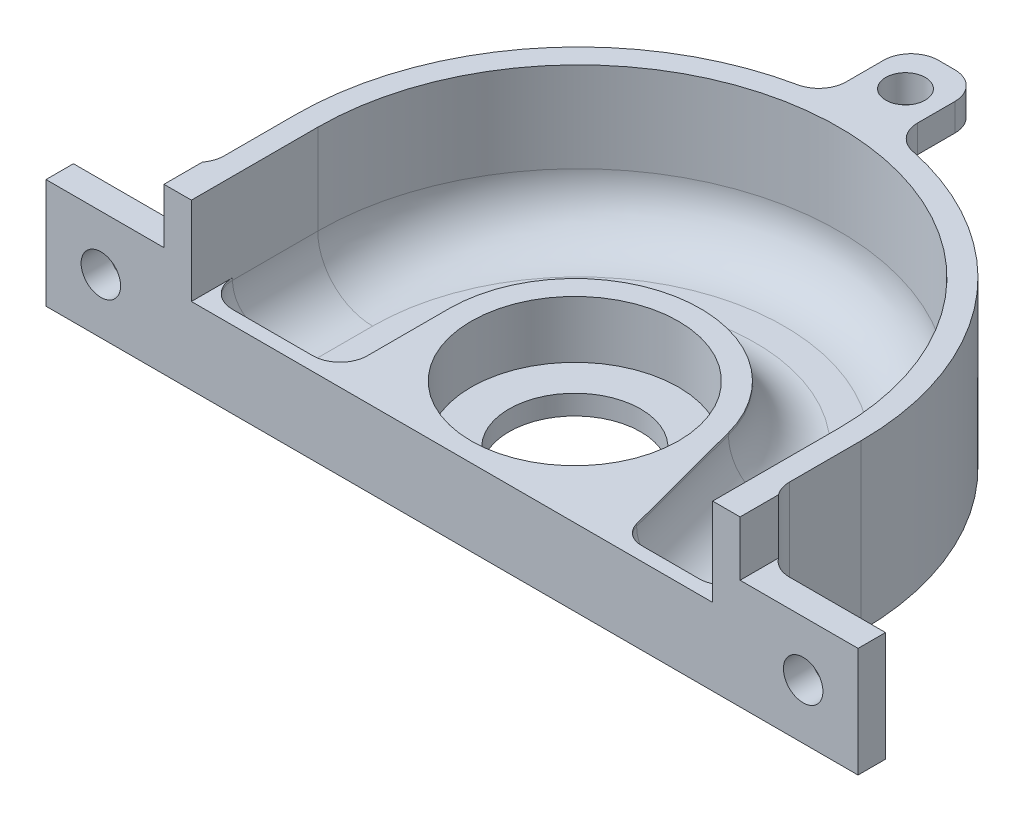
ISO-10303-21;
HEADER;
FILE_DESCRIPTION(('STEP AP214'),'2;1');
FILE_NAME('part.step','',(''),(''),'','','');
FILE_SCHEMA(('AUTOMOTIVE_DESIGN { 1 0 10303 214 1 1 1 1 }'));
ENDSEC;
DATA;
#1=APPLICATION_CONTEXT('core data for automotive mechanical design processes');
#2=APPLICATION_PROTOCOL_DEFINITION('international standard','automotive_design',2000,#1);
#3=PRODUCT_CONTEXT('',#1,'mechanical');
#4=PRODUCT('Part','Part','',(#3));
#5=PRODUCT_RELATED_PRODUCT_CATEGORY('part','',(#4));
#6=PRODUCT_DEFINITION_FORMATION('','',#4);
#7=PRODUCT_DEFINITION_CONTEXT('part definition',#1,'design');
#8=PRODUCT_DEFINITION('design','',#6,#7);
#9=PRODUCT_DEFINITION_SHAPE('','',#8);
#10=(LENGTH_UNIT() NAMED_UNIT(*) SI_UNIT(.MILLI.,.METRE.));
#11=(NAMED_UNIT(*) PLANE_ANGLE_UNIT() SI_UNIT($,.RADIAN.));
#12=(NAMED_UNIT(*) SI_UNIT($,.STERADIAN.) SOLID_ANGLE_UNIT());
#13=UNCERTAINTY_MEASURE_WITH_UNIT(LENGTH_MEASURE(1.E-05),#10,'distance_accuracy_value','');
#14=(GEOMETRIC_REPRESENTATION_CONTEXT(3) GLOBAL_UNCERTAINTY_ASSIGNED_CONTEXT((#13)) GLOBAL_UNIT_ASSIGNED_CONTEXT((#10,
#11,#12)) REPRESENTATION_CONTEXT('',''));
#15=CARTESIAN_POINT('',(0.,0.,0.));
#16=DIRECTION('',(0.,0.,1.));
#17=DIRECTION('',(1.,0.,0.));
#18=AXIS2_PLACEMENT_3D('',#15,#16,#17);
#19=CARTESIAN_POINT('',(50.8,19.05,-38.1));
#20=DIRECTION('',(0.,-1.,0.));
#21=DIRECTION('',(0.,0.,-1.));
#22=AXIS2_PLACEMENT_3D('',#19,#20,#21);
#23=PLANE('',#22);
#24=DIRECTION('',(0.,0.,-1.));
#25=VECTOR('',#24,1.);
#26=CARTESIAN_POINT('',(4.1275,19.05,-20.2865143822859));
#27=LINE('',#26,#25);
#28=CARTESIAN_POINT('',(4.1275,19.05,-12.7935143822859));
#29=VERTEX_POINT('',#28);
#30=CARTESIAN_POINT('',(4.1275,19.05,-17.1115143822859));
#31=VERTEX_POINT('',#30);
#32=EDGE_CURVE('E344',#29,#31,#27,.T.);
#33=ORIENTED_EDGE('',*,*,#32,.T.);
#34=CARTESIAN_POINT('',(0.9525,19.05,-17.1115143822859));
#35=DIRECTION('',(0.,-1.,0.));
#36=DIRECTION('',(0.,0.,-1.));
#37=AXIS2_PLACEMENT_3D('',#34,#35,#36);
#38=CIRCLE('',#37,3.175);
#39=CARTESIAN_POINT('',(0.9525,19.05,-20.2865143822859));
#40=VERTEX_POINT('',#39);
#41=EDGE_CURVE('E441',#31,#40,#38,.F.);
#42=ORIENTED_EDGE('',*,*,#41,.T.);
#43=DIRECTION('',(-1.,0.,0.));
#44=VECTOR('',#43,1.);
#45=CARTESIAN_POINT('',(-4.1275,19.05,-20.2865143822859));
#46=LINE('',#45,#44);
#47=CARTESIAN_POINT('',(-0.9525,19.05,-20.2865143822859));
#48=VERTEX_POINT('',#47);
#49=EDGE_CURVE('E346',#40,#48,#46,.T.);
#50=ORIENTED_EDGE('',*,*,#49,.T.);
#51=CARTESIAN_POINT('',(-0.9525,19.05,-17.1115143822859));
#52=DIRECTION('',(0.,-1.,0.));
#53=DIRECTION('',(0.,0.,-1.));
#54=AXIS2_PLACEMENT_3D('',#51,#52,#53);
#55=CIRCLE('',#54,3.175);
#56=CARTESIAN_POINT('',(-4.1275,19.05,-17.1115143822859));
#57=VERTEX_POINT('',#56);
#58=EDGE_CURVE('E439',#48,#57,#55,.F.);
#59=ORIENTED_EDGE('',*,*,#58,.T.);
#60=DIRECTION('',(0.,0.,1.));
#61=VECTOR('',#60,1.);
#62=CARTESIAN_POINT('',(-4.1275,19.05,-20.2865143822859));
#63=LINE('',#62,#61);
#64=CARTESIAN_POINT('',(-4.1275,19.05,-12.7935143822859));
#65=VERTEX_POINT('',#64);
#66=EDGE_CURVE('E349',#57,#65,#63,.T.);
#67=ORIENTED_EDGE('',*,*,#66,.T.);
#68=CARTESIAN_POINT('',(-7.3025,19.05,-12.7935143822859));
#69=DIRECTION('',(0.,-1.,0.));
#70=DIRECTION('',(0.,0.,-1.));
#71=AXIS2_PLACEMENT_3D('',#68,#69,#70);
#72=CIRCLE('',#71,3.175);
#73=CARTESIAN_POINT('',(-6.65626106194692,19.05,-9.68497771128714));
#74=VERTEX_POINT('',#73);
#75=EDGE_CURVE('E351',#65,#74,#72,.T.);
#76=ORIENTED_EDGE('',*,*,#75,.T.);
#77=CARTESIAN_POINT('',(0.,19.05,22.33295));
#78=DIRECTION('',(0.,1.,0.));
#79=DIRECTION('',(0.,0.,-1.));
#80=AXIS2_PLACEMENT_3D('',#77,#78,#79);
#81=CIRCLE('',#80,32.7025);
#82=CARTESIAN_POINT('',(-32.7025,19.05,22.33295));
#83=VERTEX_POINT('',#82);
#84=EDGE_CURVE('E354',#74,#83,#81,.T.);
#85=ORIENTED_EDGE('',*,*,#84,.T.);
#86=DIRECTION('',(0.,0.,1.));
#87=VECTOR('',#86,1.);
#88=CARTESIAN_POINT('',(-32.7025,19.05,30.607));
#89=LINE('',#88,#87);
#90=CARTESIAN_POINT('',(-32.7025,19.05,30.607));
#91=VERTEX_POINT('',#90);
#92=EDGE_CURVE('E357',#83,#91,#89,.T.);
#93=ORIENTED_EDGE('',*,*,#92,.T.);
#94=CARTESIAN_POINT('',(-35.8775,19.05,30.607));
#95=DIRECTION('',(0.,-1.,0.));
#96=DIRECTION('',(0.,0.,-1.));
#97=AXIS2_PLACEMENT_3D('',#94,#95,#96);
#98=CIRCLE('',#97,3.175);
#99=CARTESIAN_POINT('',(-33.3375,19.05,32.512));
#100=VERTEX_POINT('',#99);
#101=EDGE_CURVE('E360',#91,#100,#98,.T.);
#102=ORIENTED_EDGE('',*,*,#101,.T.);
#103=DIRECTION('',(0.,0.,1.));
#104=VECTOR('',#103,1.);
#105=CARTESIAN_POINT('',(-33.3375,19.05,-20.2865143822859));
#106=LINE('',#105,#104);
#107=CARTESIAN_POINT('',(-33.3375,19.05,36.957));
#108=VERTEX_POINT('',#107);
#109=EDGE_CURVE('E725',#100,#108,#106,.T.);
#110=ORIENTED_EDGE('',*,*,#109,.T.);
#111=DIRECTION('',(1.,0.,0.));
#112=VECTOR('',#111,1.);
#113=CARTESIAN_POINT('',(50.8,19.05,36.957));
#114=LINE('',#113,#112);
#115=CARTESIAN_POINT('',(-30.1625,19.05,36.957));
#116=VERTEX_POINT('',#115);
#117=EDGE_CURVE('E323',#108,#116,#114,.T.);
#118=ORIENTED_EDGE('',*,*,#117,.T.);
#119=DIRECTION('',(0.,0.,1.));
#120=VECTOR('',#119,1.);
#121=CARTESIAN_POINT('',(-30.1625,19.05,22.33295));
#122=LINE('',#121,#120);
#123=CARTESIAN_POINT('',(-30.1625,19.05,22.33295));
#124=VERTEX_POINT('',#123);
#125=EDGE_CURVE('E400',#124,#116,#122,.T.);
#126=ORIENTED_EDGE('',*,*,#125,.F.);
#127=CARTESIAN_POINT('',(0.,19.05,22.33295));
#128=DIRECTION('',(0.,1.,0.));
#129=DIRECTION('',(0.,0.,1.));
#130=AXIS2_PLACEMENT_3D('',#127,#128,#129);
#131=CIRCLE('',#130,30.1625);
#132=CARTESIAN_POINT('',(30.1625,19.05,22.33295));
#133=VERTEX_POINT('',#132);
#134=EDGE_CURVE('E396',#133,#124,#131,.T.);
#135=ORIENTED_EDGE('',*,*,#134,.F.);
#136=DIRECTION('',(0.,0.,1.));
#137=VECTOR('',#136,1.);
#138=CARTESIAN_POINT('',(30.1625,19.05,-38.1));
#139=LINE('',#138,#137);
#140=CARTESIAN_POINT('',(30.1625,19.05,36.957));
#141=VERTEX_POINT('',#140);
#142=EDGE_CURVE('E322',#133,#141,#139,.T.);
#143=ORIENTED_EDGE('',*,*,#142,.T.);
#144=CARTESIAN_POINT('',(33.3375,19.05,36.957));
#145=VERTEX_POINT('',#144);
#146=EDGE_CURVE('E311',#141,#145,#114,.T.);
#147=ORIENTED_EDGE('',*,*,#146,.T.);
#148=DIRECTION('',(0.,0.,1.));
#149=VECTOR('',#148,1.);
#150=CARTESIAN_POINT('',(33.3375,19.05,-20.2865143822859));
#151=LINE('',#150,#149);
#152=CARTESIAN_POINT('',(33.3375,19.05,32.512));
#153=VERTEX_POINT('',#152);
#154=EDGE_CURVE('E294',#153,#145,#151,.T.);
#155=ORIENTED_EDGE('',*,*,#154,.F.);
#156=CARTESIAN_POINT('',(35.8775,19.05,30.607));
#157=DIRECTION('',(0.,-1.,0.));
#158=DIRECTION('',(0.,0.,1.));
#159=AXIS2_PLACEMENT_3D('',#156,#157,#158);
#160=CIRCLE('',#159,3.175);
#161=CARTESIAN_POINT('',(32.7025,19.05,30.607));
#162=VERTEX_POINT('',#161);
#163=EDGE_CURVE('E326',#153,#162,#160,.T.);
#164=ORIENTED_EDGE('',*,*,#163,.T.);
#165=DIRECTION('',(0.,0.,-1.));
#166=VECTOR('',#165,1.);
#167=CARTESIAN_POINT('',(32.7025,19.05,30.607));
#168=LINE('',#167,#166);
#169=CARTESIAN_POINT('',(32.7025,19.05,22.33295));
#170=VERTEX_POINT('',#169);
#171=EDGE_CURVE('E335',#162,#170,#168,.T.);
#172=ORIENTED_EDGE('',*,*,#171,.T.);
#173=CARTESIAN_POINT('',(0.,19.05,22.33295));
#174=DIRECTION('',(0.,1.,0.));
#175=DIRECTION('',(0.,0.,1.));
#176=AXIS2_PLACEMENT_3D('',#173,#174,#175);
#177=CIRCLE('',#176,32.7025);
#178=CARTESIAN_POINT('',(6.6562610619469,19.05,-9.68497771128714));
#179=VERTEX_POINT('',#178);
#180=EDGE_CURVE('E338',#170,#179,#177,.T.);
#181=ORIENTED_EDGE('',*,*,#180,.T.);
#182=CARTESIAN_POINT('',(7.3025,19.05,-12.7935143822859));
#183=DIRECTION('',(0.,-1.,0.));
#184=DIRECTION('',(0.,0.,1.));
#185=AXIS2_PLACEMENT_3D('',#182,#183,#184);
#186=CIRCLE('',#185,3.175);
#187=EDGE_CURVE('E341',#179,#29,#186,.T.);
#188=ORIENTED_EDGE('',*,*,#187,.T.);
#189=EDGE_LOOP('',(#33,#42,#50,#59,#67,#76,#85,#93,#102,#110,#118,#126,#135,#143,#147,#155,#164,
#172,#181,#188));
#190=FACE_BOUND('',#189,.T.);
#191=CARTESIAN_POINT('',(0.,19.05,-15.5240143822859));
#192=DIRECTION('',(0.,1.,0.));
#193=DIRECTION('',(0.,0.,1.));
#194=AXIS2_PLACEMENT_3D('',#191,#192,#193);
#195=CIRCLE('',#194,2.286);
#196=CARTESIAN_POINT('',(0.,19.05,-17.8100143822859));
#197=VERTEX_POINT('',#196);
#198=EDGE_CURVE('E436',#197,#197,#195,.T.);
#199=ORIENTED_EDGE('',*,*,#198,.F.);
#200=EDGE_LOOP('',(#199));
#201=FACE_BOUND('',#200,.T.);
#202=ADVANCED_FACE('F36',(#190,#201),#23,.F.);
#203=CARTESIAN_POINT('',(0.,15.875,22.33295));
#204=DIRECTION('',(0.,1.,0.));
#205=DIRECTION('',(0.,0.,1.));
#206=AXIS2_PLACEMENT_3D('',#203,#204,#205);
#207=PLANE('',#206);
#208=DIRECTION('',(1.,0.,0.));
#209=VECTOR('',#208,1.);
#210=CARTESIAN_POINT('',(-4.1275,15.875,-20.2865143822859));
#211=LINE('',#210,#209);
#212=CARTESIAN_POINT('',(-0.9525,15.875,-20.2865143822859));
#213=VERTEX_POINT('',#212);
#214=CARTESIAN_POINT('',(0.9525,15.875,-20.2865143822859));
#215=VERTEX_POINT('',#214);
#216=EDGE_CURVE('E744',#213,#215,#211,.T.);
#217=ORIENTED_EDGE('',*,*,#216,.T.);
#218=CARTESIAN_POINT('',(0.9525,15.875,-17.1115143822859));
#219=DIRECTION('',(0.,1.,0.));
#220=DIRECTION('',(0.,0.,1.));
#221=AXIS2_PLACEMENT_3D('',#218,#219,#220);
#222=CIRCLE('',#221,3.175);
#223=CARTESIAN_POINT('',(4.1275,15.875,-17.1115143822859));
#224=VERTEX_POINT('',#223);
#225=EDGE_CURVE('E450',#215,#224,#222,.F.);
#226=ORIENTED_EDGE('',*,*,#225,.T.);
#227=DIRECTION('',(0.,0.,1.));
#228=VECTOR('',#227,1.);
#229=CARTESIAN_POINT('',(4.1275,15.875,-20.2865143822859));
#230=LINE('',#229,#228);
#231=CARTESIAN_POINT('',(4.1275,15.875,-12.7935143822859));
#232=VERTEX_POINT('',#231);
#233=EDGE_CURVE('E742',#224,#232,#230,.T.);
#234=ORIENTED_EDGE('',*,*,#233,.T.);
#235=CARTESIAN_POINT('',(7.3025,15.875,-12.7935143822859));
#236=DIRECTION('',(0.,1.,0.));
#237=DIRECTION('',(0.,0.,1.));
#238=AXIS2_PLACEMENT_3D('',#235,#236,#237);
#239=CIRCLE('',#238,3.175);
#240=CARTESIAN_POINT('',(6.6562610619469,15.875,-9.68497771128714));
#241=VERTEX_POINT('',#240);
#242=EDGE_CURVE('E740',#232,#241,#239,.T.);
#243=ORIENTED_EDGE('',*,*,#242,.T.);
#244=CARTESIAN_POINT('',(0.,15.875,22.33295));
#245=DIRECTION('',(0.,-1.,0.));
#246=DIRECTION('',(0.,0.,1.));
#247=AXIS2_PLACEMENT_3D('',#244,#245,#246);
#248=CIRCLE('',#247,32.7025);
#249=CARTESIAN_POINT('',(-6.6562610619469,15.875,-9.68497771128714));
#250=VERTEX_POINT('',#249);
#251=EDGE_CURVE('E737',#250,#241,#248,.T.);
#252=ORIENTED_EDGE('',*,*,#251,.F.);
#253=CARTESIAN_POINT('',(-7.3025,15.875,-12.7935143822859));
#254=DIRECTION('',(0.,1.,0.));
#255=DIRECTION('',(0.,0.,1.));
#256=AXIS2_PLACEMENT_3D('',#253,#254,#255);
#257=CIRCLE('',#256,3.175);
#258=CARTESIAN_POINT('',(-4.1275,15.875,-12.7935143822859));
#259=VERTEX_POINT('',#258);
#260=EDGE_CURVE('E750',#250,#259,#257,.T.);
#261=ORIENTED_EDGE('',*,*,#260,.T.);
#262=DIRECTION('',(0.,0.,-1.));
#263=VECTOR('',#262,1.);
#264=CARTESIAN_POINT('',(-4.1275,15.875,-20.2865143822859));
#265=LINE('',#264,#263);
#266=CARTESIAN_POINT('',(-4.1275,15.875,-17.1115143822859));
#267=VERTEX_POINT('',#266);
#268=EDGE_CURVE('E747',#259,#267,#265,.T.);
#269=ORIENTED_EDGE('',*,*,#268,.T.);
#270=CARTESIAN_POINT('',(-0.9525,15.875,-17.1115143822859));
#271=DIRECTION('',(0.,1.,0.));
#272=DIRECTION('',(0.,0.,1.));
#273=AXIS2_PLACEMENT_3D('',#270,#271,#272);
#274=CIRCLE('',#273,3.175);
#275=EDGE_CURVE('E448',#267,#213,#274,.F.);
#276=ORIENTED_EDGE('',*,*,#275,.T.);
#277=EDGE_LOOP('',(#217,#226,#234,#243,#252,#261,#269,#276));
#278=FACE_BOUND('',#277,.T.);
#279=CARTESIAN_POINT('',(0.,15.875,-15.5240143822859));
#280=DIRECTION('',(0.,1.,0.));
#281=DIRECTION('',(0.,0.,1.));
#282=AXIS2_PLACEMENT_3D('',#279,#280,#281);
#283=CIRCLE('',#282,2.286);
#284=CARTESIAN_POINT('',(0.,15.875,-17.8100143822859));
#285=VERTEX_POINT('',#284);
#286=EDGE_CURVE('E315',#285,#285,#283,.F.);
#287=ORIENTED_EDGE('',*,*,#286,.F.);
#288=EDGE_LOOP('',(#287));
#289=FACE_BOUND('',#288,.T.);
#290=ADVANCED_FACE('F543',(#278,#289),#207,.F.);
#291=CARTESIAN_POINT('',(50.8,0.,36.957));
#292=DIRECTION('',(0.,0.,1.));
#293=DIRECTION('',(1.,0.,0.));
#294=AXIS2_PLACEMENT_3D('',#291,#292,#293);
#295=PLANE('',#294);
#296=DIRECTION('',(0.,-1.,0.));
#297=VECTOR('',#296,1.);
#298=CARTESIAN_POINT('',(46.99,0.,36.957));
#299=LINE('',#298,#297);
#300=CARTESIAN_POINT('',(46.99,12.7,36.957));
#301=VERTEX_POINT('',#300);
#302=CARTESIAN_POINT('',(46.99,0.,36.957));
#303=VERTEX_POINT('',#302);
#304=EDGE_CURVE('E305',#301,#303,#299,.T.);
#305=ORIENTED_EDGE('',*,*,#304,.F.);
#306=DIRECTION('',(1.,0.,0.));
#307=VECTOR('',#306,1.);
#308=CARTESIAN_POINT('',(46.99,12.7,36.957));
#309=LINE('',#308,#307);
#310=CARTESIAN_POINT('',(33.3375,12.7,36.957));
#311=VERTEX_POINT('',#310);
#312=EDGE_CURVE('E314',#311,#301,#309,.T.);
#313=ORIENTED_EDGE('',*,*,#312,.F.);
#314=DIRECTION('',(0.,-1.,0.));
#315=VECTOR('',#314,1.);
#316=CARTESIAN_POINT('',(33.3375,12.7,36.957));
#317=LINE('',#316,#315);
#318=EDGE_CURVE('E297',#145,#311,#317,.T.);
#319=ORIENTED_EDGE('',*,*,#318,.F.);
#320=ORIENTED_EDGE('',*,*,#146,.F.);
#321=DIRECTION('',(0.,-1.,0.));
#322=VECTOR('',#321,1.);
#323=CARTESIAN_POINT('',(30.1625,8.89,36.957));
#324=LINE('',#323,#322);
#325=CARTESIAN_POINT('',(30.1625,8.89,36.957));
#326=VERTEX_POINT('',#325);
#327=EDGE_CURVE('E391',#141,#326,#324,.T.);
#328=ORIENTED_EDGE('',*,*,#327,.T.);
#329=DIRECTION('',(1.,0.,0.));
#330=VECTOR('',#329,1.);
#331=CARTESIAN_POINT('',(0.,8.89,36.957));
#332=LINE('',#331,#330);
#333=CARTESIAN_POINT('',(-30.1625,8.89,36.957));
#334=VERTEX_POINT('',#333);
#335=EDGE_CURVE('E367',#334,#326,#332,.T.);
#336=ORIENTED_EDGE('',*,*,#335,.F.);
#337=DIRECTION('',(0.,1.,0.));
#338=VECTOR('',#337,1.);
#339=CARTESIAN_POINT('',(-30.1625,8.89,36.957));
#340=LINE('',#339,#338);
#341=EDGE_CURVE('E412',#334,#116,#340,.T.);
#342=ORIENTED_EDGE('',*,*,#341,.T.);
#343=ORIENTED_EDGE('',*,*,#117,.F.);
#344=DIRECTION('',(0.,1.,0.));
#345=VECTOR('',#344,1.);
#346=CARTESIAN_POINT('',(-33.3375,12.7,36.957));
#347=LINE('',#346,#345);
#348=CARTESIAN_POINT('',(-33.3375,12.7,36.957));
#349=VERTEX_POINT('',#348);
#350=EDGE_CURVE('E722',#349,#108,#347,.T.);
#351=ORIENTED_EDGE('',*,*,#350,.F.);
#352=DIRECTION('',(1.,0.,0.));
#353=VECTOR('',#352,1.);
#354=CARTESIAN_POINT('',(-46.99,12.7,36.957));
#355=LINE('',#354,#353);
#356=CARTESIAN_POINT('',(-46.99,12.7,36.957));
#357=VERTEX_POINT('',#356);
#358=EDGE_CURVE('E719',#357,#349,#355,.T.);
#359=ORIENTED_EDGE('',*,*,#358,.F.);
#360=DIRECTION('',(0.,1.,0.));
#361=VECTOR('',#360,1.);
#362=CARTESIAN_POINT('',(-46.99,0.,36.957));
#363=LINE('',#362,#361);
#364=CARTESIAN_POINT('',(-46.99,0.,36.957));
#365=VERTEX_POINT('',#364);
#366=EDGE_CURVE('E716',#365,#357,#363,.T.);
#367=ORIENTED_EDGE('',*,*,#366,.F.);
#368=DIRECTION('',(1.,0.,0.));
#369=VECTOR('',#368,1.);
#370=CARTESIAN_POINT('',(-50.8,0.,36.957));
#371=LINE('',#370,#369);
#372=EDGE_CURVE('E363',#365,#303,#371,.T.);
#373=ORIENTED_EDGE('',*,*,#372,.T.);
#374=EDGE_LOOP('',(#305,#313,#319,#320,#328,#336,#342,#343,#351,#359,#367,#373));
#375=FACE_BOUND('',#374,.T.);
#376=CARTESIAN_POINT('',(-40.64,6.35,36.957));
#377=DIRECTION('',(0.,0.,1.));
#378=DIRECTION('',(1.,0.,0.));
#379=AXIS2_PLACEMENT_3D('',#376,#377,#378);
#380=CIRCLE('',#379,2.28599999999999);
#381=CARTESIAN_POINT('',(-38.354,6.35,36.957));
#382=VERTEX_POINT('',#381);
#383=EDGE_CURVE('E420',#382,#382,#380,.T.);
#384=ORIENTED_EDGE('',*,*,#383,.F.);
#385=EDGE_LOOP('',(#384));
#386=FACE_BOUND('',#385,.T.);
#387=CARTESIAN_POINT('',(40.64,6.35,36.957));
#388=DIRECTION('',(0.,0.,1.));
#389=DIRECTION('',(-1.,0.,0.));
#390=AXIS2_PLACEMENT_3D('',#387,#388,#389);
#391=CIRCLE('',#390,2.28599999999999);
#392=CARTESIAN_POINT('',(38.354,6.35,36.957));
#393=VERTEX_POINT('',#392);
#394=EDGE_CURVE('E424',#393,#393,#391,.T.);
#395=ORIENTED_EDGE('',*,*,#394,.F.);
#396=EDGE_LOOP('',(#395));
#397=FACE_BOUND('',#396,.T.);
#398=ADVANCED_FACE('F309',(#375,#386,#397),#295,.T.);
#399=CARTESIAN_POINT('',(50.8,0.,33.782));
#400=DIRECTION('',(0.,0.,-1.));
#401=DIRECTION('',(-1.,0.,0.));
#402=AXIS2_PLACEMENT_3D('',#399,#400,#401);
#403=PLANE('',#402);
#404=DIRECTION('',(0.,1.,0.));
#405=VECTOR('',#404,1.);
#406=CARTESIAN_POINT('',(46.99,0.,33.782));
#407=LINE('',#406,#405);
#408=CARTESIAN_POINT('',(46.99,0.,33.782));
#409=VERTEX_POINT('',#408);
#410=CARTESIAN_POINT('',(46.99,12.7,33.782));
#411=VERTEX_POINT('',#410);
#412=EDGE_CURVE('E714',#409,#411,#407,.T.);
#413=ORIENTED_EDGE('',*,*,#412,.F.);
#414=DIRECTION('',(-1.,0.,0.));
#415=VECTOR('',#414,1.);
#416=CARTESIAN_POINT('',(50.8,0.,33.782));
#417=LINE('',#416,#415);
#418=CARTESIAN_POINT('',(35.8775,0.,33.782));
#419=VERTEX_POINT('',#418);
#420=EDGE_CURVE('E809',#409,#419,#417,.T.);
#421=ORIENTED_EDGE('',*,*,#420,.T.);
#422=DIRECTION('',(0.,1.,0.));
#423=VECTOR('',#422,1.);
#424=CARTESIAN_POINT('',(35.8775,0.,33.782));
#425=LINE('',#424,#423);
#426=CARTESIAN_POINT('',(35.8775,12.7,33.782));
#427=VERTEX_POINT('',#426);
#428=EDGE_CURVE('E386',#419,#427,#425,.T.);
#429=ORIENTED_EDGE('',*,*,#428,.T.);
#430=DIRECTION('',(-1.,0.,0.));
#431=VECTOR('',#430,1.);
#432=CARTESIAN_POINT('',(50.8,12.7,33.782));
#433=LINE('',#432,#431);
#434=EDGE_CURVE('E709',#411,#427,#433,.T.);
#435=ORIENTED_EDGE('',*,*,#434,.F.);
#436=EDGE_LOOP('',(#413,#421,#429,#435));
#437=FACE_BOUND('',#436,.T.);
#438=CARTESIAN_POINT('',(40.64,6.35,33.782));
#439=DIRECTION('',(0.,0.,-1.));
#440=DIRECTION('',(-1.,0.,0.));
#441=AXIS2_PLACEMENT_3D('',#438,#439,#440);
#442=CIRCLE('',#441,2.28599999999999);
#443=CARTESIAN_POINT('',(38.354,6.35,33.782));
#444=VERTEX_POINT('',#443);
#445=EDGE_CURVE('E421',#444,#444,#442,.F.);
#446=ORIENTED_EDGE('',*,*,#445,.T.);
#447=EDGE_LOOP('',(#446));
#448=FACE_BOUND('',#447,.T.);
#449=ADVANCED_FACE('F565',(#437,#448),#403,.T.);
#450=CARTESIAN_POINT('',(-50.8,0.,33.782));
#451=DIRECTION('',(0.,0.,-1.));
#452=DIRECTION('',(-1.,0.,0.));
#453=AXIS2_PLACEMENT_3D('',#450,#451,#452);
#454=PLANE('',#453);
#455=DIRECTION('',(-1.,0.,0.));
#456=VECTOR('',#455,1.);
#457=CARTESIAN_POINT('',(-50.8,12.7,33.782));
#458=LINE('',#457,#456);
#459=CARTESIAN_POINT('',(-35.8775,12.7,33.782));
#460=VERTEX_POINT('',#459);
#461=CARTESIAN_POINT('',(-46.99,12.7,33.782));
#462=VERTEX_POINT('',#461);
#463=EDGE_CURVE('E728',#460,#462,#458,.T.);
#464=ORIENTED_EDGE('',*,*,#463,.F.);
#465=DIRECTION('',(0.,1.,0.));
#466=VECTOR('',#465,1.);
#467=CARTESIAN_POINT('',(-35.8775,0.,33.782));
#468=LINE('',#467,#466);
#469=CARTESIAN_POINT('',(-35.8775,0.,33.782));
#470=VERTEX_POINT('',#469);
#471=EDGE_CURVE('E364',#470,#460,#468,.T.);
#472=ORIENTED_EDGE('',*,*,#471,.F.);
#473=DIRECTION('',(-1.,0.,0.));
#474=VECTOR('',#473,1.);
#475=CARTESIAN_POINT('',(-50.8,0.,33.782));
#476=LINE('',#475,#474);
#477=CARTESIAN_POINT('',(-46.99,0.,33.782));
#478=VERTEX_POINT('',#477);
#479=EDGE_CURVE('E332',#470,#478,#476,.T.);
#480=ORIENTED_EDGE('',*,*,#479,.T.);
#481=DIRECTION('',(0.,-1.,0.));
#482=VECTOR('',#481,1.);
#483=CARTESIAN_POINT('',(-46.99,0.,33.782));
#484=LINE('',#483,#482);
#485=EDGE_CURVE('E735',#462,#478,#484,.T.);
#486=ORIENTED_EDGE('',*,*,#485,.F.);
#487=EDGE_LOOP('',(#464,#472,#480,#486));
#488=FACE_BOUND('',#487,.T.);
#489=CARTESIAN_POINT('',(-40.64,6.35,33.782));
#490=DIRECTION('',(0.,0.,-1.));
#491=DIRECTION('',(-1.,0.,0.));
#492=AXIS2_PLACEMENT_3D('',#489,#490,#491);
#493=CIRCLE('',#492,2.28599999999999);
#494=CARTESIAN_POINT('',(-42.926,6.35,33.782));
#495=VERTEX_POINT('',#494);
#496=EDGE_CURVE('E416',#495,#495,#493,.F.);
#497=ORIENTED_EDGE('',*,*,#496,.T.);
#498=EDGE_LOOP('',(#497));
#499=FACE_BOUND('',#498,.T.);
#500=ADVANCED_FACE('F561',(#488,#499),#454,.T.);
#501=CARTESIAN_POINT('',(0.,19.05,22.7457));
#502=DIRECTION('',(0.,-1.,0.));
#503=DIRECTION('',(0.,0.,-1.));
#504=AXIS2_PLACEMENT_3D('',#501,#502,#503);
#505=CYLINDRICAL_SURFACE('',#504,7.62);
#506=CARTESIAN_POINT('',(0.,0.,22.7457));
#507=DIRECTION('',(0.,1.,0.));
#508=DIRECTION('',(0.,0.,1.));
#509=AXIS2_PLACEMENT_3D('',#506,#507,#508);
#510=CIRCLE('',#509,7.62);
#511=CARTESIAN_POINT('',(0.,0.,15.1257));
#512=VERTEX_POINT('',#511);
#513=EDGE_CURVE('E393',#512,#512,#510,.T.);
#514=CARTESIAN_POINT('',(0.,2.286,22.7457));
#515=DIRECTION('',(0.,1.,0.));
#516=DIRECTION('',(0.,0.,1.));
#517=AXIS2_PLACEMENT_3D('',#514,#515,#516);
#518=CIRCLE('',#517,7.62);
#519=CARTESIAN_POINT('',(0.,2.286,15.1257));
#520=VERTEX_POINT('',#519);
#521=EDGE_CURVE('E324',#520,#520,#518,.T.);
#522=CARTESIAN_POINT('',(0.,0.,15.1257));
#523=CARTESIAN_POINT('',(0.,0.0238125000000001,15.1257));
#524=CARTESIAN_POINT('',(0.,0.0476250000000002,15.1257));
#525=CARTESIAN_POINT('',(0.,0.0952500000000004,15.1257));
#526=CARTESIAN_POINT('',(0.,0.119062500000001,15.1257));
#527=CARTESIAN_POINT('',(0.,0.166687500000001,15.1257));
#528=CARTESIAN_POINT('',(0.,0.190500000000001,15.1257));
#529=CARTESIAN_POINT('',(0.,0.238125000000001,15.1257));
#530=CARTESIAN_POINT('',(0.,0.261937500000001,15.1257));
#531=CARTESIAN_POINT('',(0.,0.309562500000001,15.1257));
#532=CARTESIAN_POINT('',(0.,0.333375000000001,15.1257));
#533=CARTESIAN_POINT('',(0.,0.381000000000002,15.1257));
#534=CARTESIAN_POINT('',(0.,0.404812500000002,15.1257));
#535=CARTESIAN_POINT('',(0.,0.452437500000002,15.1257));
#536=CARTESIAN_POINT('',(0.,0.476250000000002,15.1257));
#537=CARTESIAN_POINT('',(0.,0.523875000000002,15.1257));
#538=CARTESIAN_POINT('',(0.,0.547687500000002,15.1257));
#539=CARTESIAN_POINT('',(0.,0.595312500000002,15.1257));
#540=CARTESIAN_POINT('',(0.,0.619125,15.1257));
#541=CARTESIAN_POINT('',(0.,0.66675,15.1257));
#542=CARTESIAN_POINT('',(0.,0.6905625,15.1257));
#543=CARTESIAN_POINT('',(0.,0.7381875,15.1257));
#544=CARTESIAN_POINT('',(0.,0.762,15.1257));
#545=CARTESIAN_POINT('',(0.,0.809625,15.1257));
#546=CARTESIAN_POINT('',(0.,0.8334375,15.1257));
#547=CARTESIAN_POINT('',(0.,0.8810625,15.1257));
#548=CARTESIAN_POINT('',(0.,0.904875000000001,15.1257));
#549=CARTESIAN_POINT('',(0.,0.952500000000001,15.1257));
#550=CARTESIAN_POINT('',(0.,0.976312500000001,15.1257));
#551=CARTESIAN_POINT('',(0.,1.0239375,15.1257));
#552=CARTESIAN_POINT('',(0.,1.04775,15.1257));
#553=CARTESIAN_POINT('',(0.,1.095375,15.1257));
#554=CARTESIAN_POINT('',(0.,1.1191875,15.1257));
#555=CARTESIAN_POINT('',(0.,1.1668125,15.1257));
#556=CARTESIAN_POINT('',(0.,1.190625,15.1257));
#557=CARTESIAN_POINT('',(0.,1.23825,15.1257));
#558=CARTESIAN_POINT('',(0.,1.2620625,15.1257));
#559=CARTESIAN_POINT('',(0.,1.3096875,15.1257));
#560=CARTESIAN_POINT('',(0.,1.3335,15.1257));
#561=CARTESIAN_POINT('',(0.,1.381125,15.1257));
#562=CARTESIAN_POINT('',(0.,1.4049375,15.1257));
#563=CARTESIAN_POINT('',(0.,1.4525625,15.1257));
#564=CARTESIAN_POINT('',(0.,1.476375,15.1257));
#565=CARTESIAN_POINT('',(0.,1.524,15.1257));
#566=CARTESIAN_POINT('',(0.,1.5478125,15.1257));
#567=CARTESIAN_POINT('',(0.,1.5954375,15.1257));
#568=CARTESIAN_POINT('',(0.,1.61925,15.1257));
#569=CARTESIAN_POINT('',(0.,1.666875,15.1257));
#570=CARTESIAN_POINT('',(0.,1.6906875,15.1257));
#571=CARTESIAN_POINT('',(0.,1.7383125,15.1257));
#572=CARTESIAN_POINT('',(0.,1.762125,15.1257));
#573=CARTESIAN_POINT('',(0.,1.80975,15.1257));
#574=CARTESIAN_POINT('',(0.,1.8335625,15.1257));
#575=CARTESIAN_POINT('',(0.,1.8811875,15.1257));
#576=CARTESIAN_POINT('',(0.,1.905,15.1257));
#577=CARTESIAN_POINT('',(0.,1.952625,15.1257));
#578=CARTESIAN_POINT('',(0.,1.9764375,15.1257));
#579=CARTESIAN_POINT('',(0.,2.0240625,15.1257));
#580=CARTESIAN_POINT('',(0.,2.047875,15.1257));
#581=CARTESIAN_POINT('',(0.,2.0955,15.1257));
#582=CARTESIAN_POINT('',(0.,2.1193125,15.1257));
#583=CARTESIAN_POINT('',(0.,2.1669375,15.1257));
#584=CARTESIAN_POINT('',(0.,2.19075,15.1257));
#585=CARTESIAN_POINT('',(0.,2.238375,15.1257));
#586=CARTESIAN_POINT('',(0.,2.2621875,15.1257));
#587=CARTESIAN_POINT('',(0.,2.286,15.1257));
#588=B_SPLINE_CURVE_WITH_KNOTS('',3,(#522,#523,#524,#525,#526,#527,#528,#529,#530,#531,#532,
#533,#534,#535,#536,#537,#538,#539,#540,#541,#542,#543,#544,#545,#546,#547,#548,#549,#550,#551,
#552,#553,#554,#555,#556,#557,#558,#559,#560,#561,#562,#563,#564,#565,#566,#567,#568,#569,#570,
#571,#572,#573,#574,#575,#576,#577,#578,#579,#580,#581,#582,#583,#584,#585,#586,#587),
.UNSPECIFIED.,.F.,.F.,(4,2,2,2,2,2,2,2,2,2,2,2,2,2,2,2,2,2,2,2,2,2,2,2,2,2,2,2,2,2,2,2,4),(0.,
0.0714375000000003,0.142875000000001,0.214312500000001,0.285750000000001,0.357187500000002,
0.428625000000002,0.500062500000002,0.571500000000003,0.642937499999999,0.714375,0.7858125,
0.85725,0.928687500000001,1.000125,1.0715625,1.143,1.2144375,1.285875,1.3573125,1.42875,
1.5001875,1.571625,1.6430625,1.7145,1.7859375,1.857375,1.9288125,2.00025,2.0716875,2.143125,
2.2145625,2.286),.UNSPECIFIED.);
#589=EDGE_CURVE('BSEAM539',#512,#520,#588,.T.);
#590=ORIENTED_EDGE('',*,*,#513,.F.);
#591=ORIENTED_EDGE('',*,*,#521,.T.);
#592=ORIENTED_EDGE('',*,*,#589,.T.);
#593=ORIENTED_EDGE('',*,*,#589,.F.);
#594=EDGE_LOOP('',(#590,#592,#591,#593));
#595=FACE_BOUND('',#594,.T.);
#596=ADVANCED_FACE('F539',(#595),#505,.F.);
#597=CARTESIAN_POINT('',(50.8,0.,-38.1));
#598=DIRECTION('',(0.,-1.,0.));
#599=DIRECTION('',(0.,0.,-1.));
#600=AXIS2_PLACEMENT_3D('',#597,#598,#599);
#601=PLANE('',#600);
#602=DIRECTION('',(0.,0.,1.));
#603=VECTOR('',#602,1.);
#604=CARTESIAN_POINT('',(46.99,0.,-20.2865143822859));
#605=LINE('',#604,#603);
#606=EDGE_CURVE('E706',#409,#303,#605,.T.);
#607=ORIENTED_EDGE('',*,*,#606,.T.);
#608=ORIENTED_EDGE('',*,*,#372,.F.);
#609=DIRECTION('',(0.,0.,1.));
#610=VECTOR('',#609,1.);
#611=CARTESIAN_POINT('',(-46.99,0.,-20.2865143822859));
#612=LINE('',#611,#610);
#613=EDGE_CURVE('E724',#478,#365,#612,.T.);
#614=ORIENTED_EDGE('',*,*,#613,.F.);
#615=ORIENTED_EDGE('',*,*,#479,.F.);
#616=CARTESIAN_POINT('',(-35.8775,0.,30.607));
#617=DIRECTION('',(0.,-1.,0.));
#618=DIRECTION('',(0.,0.,-1.));
#619=AXIS2_PLACEMENT_3D('',#616,#617,#618);
#620=CIRCLE('',#619,3.175);
#621=CARTESIAN_POINT('',(-32.7025,0.,30.607));
#622=VERTEX_POINT('',#621);
#623=EDGE_CURVE('E821',#622,#470,#620,.T.);
#624=ORIENTED_EDGE('',*,*,#623,.F.);
#625=DIRECTION('',(0.,0.,1.));
#626=VECTOR('',#625,1.);
#627=CARTESIAN_POINT('',(-32.7025,0.,30.607));
#628=LINE('',#627,#626);
#629=CARTESIAN_POINT('',(-32.7025,0.,22.33295));
#630=VERTEX_POINT('',#629);
#631=EDGE_CURVE('E819',#630,#622,#628,.T.);
#632=ORIENTED_EDGE('',*,*,#631,.F.);
#633=CARTESIAN_POINT('',(0.,0.,22.33295));
#634=DIRECTION('',(0.,1.,0.));
#635=DIRECTION('',(0.,0.,1.));
#636=AXIS2_PLACEMENT_3D('',#633,#634,#635);
#637=CIRCLE('',#636,32.7025);
#638=CARTESIAN_POINT('',(32.7025,0.,22.33295));
#639=VERTEX_POINT('',#638);
#640=EDGE_CURVE('E817',#639,#630,#637,.T.);
#641=ORIENTED_EDGE('',*,*,#640,.F.);
#642=DIRECTION('',(0.,0.,-1.));
#643=VECTOR('',#642,1.);
#644=CARTESIAN_POINT('',(32.7025,0.,30.607));
#645=LINE('',#644,#643);
#646=CARTESIAN_POINT('',(32.7025,0.,30.607));
#647=VERTEX_POINT('',#646);
#648=EDGE_CURVE('E814',#647,#639,#645,.T.);
#649=ORIENTED_EDGE('',*,*,#648,.F.);
#650=CARTESIAN_POINT('',(35.8775,0.,30.607));
#651=DIRECTION('',(0.,-1.,0.));
#652=DIRECTION('',(0.,0.,1.));
#653=AXIS2_PLACEMENT_3D('',#650,#651,#652);
#654=CIRCLE('',#653,3.175);
#655=EDGE_CURVE('E811',#419,#647,#654,.T.);
#656=ORIENTED_EDGE('',*,*,#655,.F.);
#657=ORIENTED_EDGE('',*,*,#420,.F.);
#658=EDGE_LOOP('',(#607,#608,#614,#615,#624,#632,#641,#649,#656,#657));
#659=FACE_BOUND('',#658,.T.);
#660=ORIENTED_EDGE('',*,*,#513,.T.);
#661=EDGE_LOOP('',(#660));
#662=FACE_BOUND('',#661,.T.);
#663=ADVANCED_FACE('F535',(#659,#662),#601,.T.);
#664=CARTESIAN_POINT('',(0.,8.89,22.33295));
#665=DIRECTION('',(0.,1.,0.));
#666=DIRECTION('',(0.,0.,1.));
#667=AXIS2_PLACEMENT_3D('',#664,#665,#666);
#668=PLANE('',#667);
#669=CARTESIAN_POINT('',(-26.9875,8.89,32.1945));
#670=DIRECTION('',(0.,1.,0.));
#671=DIRECTION('',(0.,0.,1.));
#672=AXIS2_PLACEMENT_3D('',#669,#670,#671);
#673=CIRCLE('',#672,3.17500000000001);
#674=CARTESIAN_POINT('',(-30.1625,8.89,32.1945));
#675=VERTEX_POINT('',#674);
#676=CARTESIAN_POINT('',(-26.9875,8.89,35.3695));
#677=VERTEX_POINT('',#676);
#678=EDGE_CURVE('E764',#675,#677,#673,.T.);
#679=ORIENTED_EDGE('',*,*,#678,.F.);
#680=DIRECTION('',(0.,0.,1.));
#681=VECTOR('',#680,1.);
#682=CARTESIAN_POINT('',(-30.1625,8.89,22.33295));
#683=LINE('',#682,#681);
#684=EDGE_CURVE('E397',#675,#334,#683,.T.);
#685=ORIENTED_EDGE('',*,*,#684,.T.);
#686=ORIENTED_EDGE('',*,*,#335,.T.);
#687=DIRECTION('',(0.,0.,-1.));
#688=VECTOR('',#687,1.);
#689=CARTESIAN_POINT('',(30.1625,8.89,22.33295));
#690=LINE('',#689,#688);
#691=CARTESIAN_POINT('',(30.1625,8.89,32.1945));
#692=VERTEX_POINT('',#691);
#693=EDGE_CURVE('E399',#326,#692,#690,.T.);
#694=ORIENTED_EDGE('',*,*,#693,.T.);
#695=CARTESIAN_POINT('',(26.9875,8.89,32.1945));
#696=DIRECTION('',(0.,1.,0.));
#697=DIRECTION('',(0.,0.,1.));
#698=AXIS2_PLACEMENT_3D('',#695,#696,#697);
#699=CIRCLE('',#698,3.175);
#700=CARTESIAN_POINT('',(26.9875,8.89,35.3695));
#701=VERTEX_POINT('',#700);
#702=EDGE_CURVE('E761',#701,#692,#699,.T.);
#703=ORIENTED_EDGE('',*,*,#702,.F.);
#704=DIRECTION('',(1.,0.,0.));
#705=VECTOR('',#704,1.);
#706=CARTESIAN_POINT('',(20.3391659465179,8.89,35.3695));
#707=LINE('',#706,#705);
#708=CARTESIAN_POINT('',(20.3391659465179,8.89,35.3695));
#709=VERTEX_POINT('',#708);
#710=EDGE_CURVE('E758',#709,#701,#707,.T.);
#711=ORIENTED_EDGE('',*,*,#710,.F.);
#712=CARTESIAN_POINT('',(20.3391659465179,8.89,32.8295));
#713=DIRECTION('',(0.,1.,0.));
#714=DIRECTION('',(0.,0.,1.));
#715=AXIS2_PLACEMENT_3D('',#712,#713,#714);
#716=CIRCLE('',#715,2.54000000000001);
#717=CARTESIAN_POINT('',(17.8837393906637,8.89,33.479484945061));
#718=VERTEX_POINT('',#717);
#719=EDGE_CURVE('E419',#718,#709,#716,.T.);
#720=ORIENTED_EDGE('',*,*,#719,.F.);
#721=DIRECTION('',(0.25589958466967,0.,0.966703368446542));
#722=VECTOR('',#721,1.);
#723=CARTESIAN_POINT('',(17.8837393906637,8.89,33.479484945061));
#724=LINE('',#723,#722);
#725=CARTESIAN_POINT('',(14.0573170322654,8.89,19.024536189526));
#726=VERTEX_POINT('',#725);
#727=EDGE_CURVE('E779',#726,#718,#724,.T.);
#728=ORIENTED_EDGE('',*,*,#727,.F.);
#729=CARTESIAN_POINT('',(0.,8.89,22.7457));
#730=DIRECTION('',(0.,-1.,0.));
#731=DIRECTION('',(0.,0.,1.));
#732=AXIS2_PLACEMENT_3D('',#729,#730,#731);
#733=CIRCLE('',#732,14.5415);
#734=CARTESIAN_POINT('',(-14.5415,8.89,22.7457));
#735=VERTEX_POINT('',#734);
#736=EDGE_CURVE('E776',#735,#726,#733,.T.);
#737=ORIENTED_EDGE('',*,*,#736,.F.);
#738=DIRECTION('',(0.,0.,-1.));
#739=VECTOR('',#738,1.);
#740=CARTESIAN_POINT('',(-14.5415,8.89,32.1945));
#741=LINE('',#740,#739);
#742=CARTESIAN_POINT('',(-14.5415,8.89,32.1945));
#743=VERTEX_POINT('',#742);
#744=EDGE_CURVE('E773',#743,#735,#741,.T.);
#745=ORIENTED_EDGE('',*,*,#744,.F.);
#746=CARTESIAN_POINT('',(-17.7165,8.89,32.1945));
#747=DIRECTION('',(0.,1.,0.));
#748=DIRECTION('',(0.,0.,-1.));
#749=AXIS2_PLACEMENT_3D('',#746,#747,#748);
#750=CIRCLE('',#749,3.175);
#751=CARTESIAN_POINT('',(-17.7165,8.89,35.3695));
#752=VERTEX_POINT('',#751);
#753=EDGE_CURVE('E770',#752,#743,#750,.T.);
#754=ORIENTED_EDGE('',*,*,#753,.F.);
#755=DIRECTION('',(1.,0.,0.));
#756=VECTOR('',#755,1.);
#757=CARTESIAN_POINT('',(-26.9875,8.89,35.3695));
#758=LINE('',#757,#756);
#759=EDGE_CURVE('E767',#677,#752,#758,.T.);
#760=ORIENTED_EDGE('',*,*,#759,.F.);
#761=EDGE_LOOP('',(#679,#685,#686,#694,#703,#711,#720,#728,#737,#745,#754,#760));
#762=FACE_BOUND('',#761,.T.);
#763=CARTESIAN_POINT('',(0.,8.89,22.7457));
#764=DIRECTION('',(0.,1.,0.));
#765=DIRECTION('',(0.,0.,1.));
#766=AXIS2_PLACEMENT_3D('',#763,#764,#765);
#767=CIRCLE('',#766,12.0015);
#768=CARTESIAN_POINT('',(0.,8.89,34.7472));
#769=VERTEX_POINT('',#768);
#770=EDGE_CURVE('E785',#769,#769,#767,.T.);
#771=ORIENTED_EDGE('',*,*,#770,.F.);
#772=EDGE_LOOP('',(#771));
#773=FACE_BOUND('',#772,.T.);
#774=ADVANCED_FACE('F538',(#762,#773),#668,.T.);
#775=CARTESIAN_POINT('',(30.1625,8.89,22.33295));
#776=DIRECTION('',(1.,0.,0.));
#777=DIRECTION('',(0.,0.,-1.));
#778=AXIS2_PLACEMENT_3D('',#775,#776,#777);
#779=PLANE('',#778);
#780=DIRECTION('',(0.,1.,0.));
#781=VECTOR('',#780,1.);
#782=CARTESIAN_POINT('',(30.1625,8.89,22.33295));
#783=LINE('',#782,#781);
#784=CARTESIAN_POINT('',(30.1625,8.636,22.33295));
#785=VERTEX_POINT('',#784);
#786=EDGE_CURVE('E408',#785,#133,#783,.T.);
#787=ORIENTED_EDGE('',*,*,#786,.F.);
#788=DIRECTION('',(0.,0.,-1.));
#789=VECTOR('',#788,1.);
#790=CARTESIAN_POINT('',(30.1625,8.636,22.33295));
#791=LINE('',#790,#789);
#792=CARTESIAN_POINT('',(30.1625,8.636,32.1945));
#793=VERTEX_POINT('',#792);
#794=EDGE_CURVE('E471',#785,#793,#791,.F.);
#795=ORIENTED_EDGE('',*,*,#794,.T.);
#796=DIRECTION('',(0.,1.,0.));
#797=VECTOR('',#796,1.);
#798=CARTESIAN_POINT('',(30.1625,2.286,32.1945));
#799=LINE('',#798,#797);
#800=EDGE_CURVE('E798',#793,#692,#799,.T.);
#801=ORIENTED_EDGE('',*,*,#800,.T.);
#802=ORIENTED_EDGE('',*,*,#693,.F.);
#803=ORIENTED_EDGE('',*,*,#327,.F.);
#804=ORIENTED_EDGE('',*,*,#142,.F.);
#805=EDGE_LOOP('',(#787,#795,#801,#802,#803,#804));
#806=FACE_BOUND('',#805,.T.);
#807=ADVANCED_FACE('F552',(#806),#779,.F.);
#808=CARTESIAN_POINT('',(-30.1625,8.89,22.33295));
#809=DIRECTION('',(-1.,0.,0.));
#810=DIRECTION('',(0.,0.,1.));
#811=AXIS2_PLACEMENT_3D('',#808,#809,#810);
#812=PLANE('',#811);
#813=DIRECTION('',(0.,1.,0.));
#814=VECTOR('',#813,1.);
#815=CARTESIAN_POINT('',(-30.1625,2.286,32.1945));
#816=LINE('',#815,#814);
#817=CARTESIAN_POINT('',(-30.1625,8.636,32.1945));
#818=VERTEX_POINT('',#817);
#819=EDGE_CURVE('E796',#818,#675,#816,.T.);
#820=ORIENTED_EDGE('',*,*,#819,.F.);
#821=DIRECTION('',(0.,0.,1.));
#822=VECTOR('',#821,1.);
#823=CARTESIAN_POINT('',(-30.1625,8.636,22.33295));
#824=LINE('',#823,#822);
#825=CARTESIAN_POINT('',(-30.1625,8.636,22.33295));
#826=VERTEX_POINT('',#825);
#827=EDGE_CURVE('E45',#818,#826,#824,.F.);
#828=ORIENTED_EDGE('',*,*,#827,.T.);
#829=DIRECTION('',(0.,1.,0.));
#830=VECTOR('',#829,1.);
#831=CARTESIAN_POINT('',(-30.1625,8.89,22.33295));
#832=LINE('',#831,#830);
#833=EDGE_CURVE('E403',#826,#124,#832,.T.);
#834=ORIENTED_EDGE('',*,*,#833,.T.);
#835=ORIENTED_EDGE('',*,*,#125,.T.);
#836=ORIENTED_EDGE('',*,*,#341,.F.);
#837=ORIENTED_EDGE('',*,*,#684,.F.);
#838=EDGE_LOOP('',(#820,#828,#834,#835,#836,#837));
#839=FACE_BOUND('',#838,.T.);
#840=ADVANCED_FACE('F548',(#839),#812,.F.);
#841=CARTESIAN_POINT('',(0.,8.89,22.33295));
#842=DIRECTION('',(0.,1.,0.));
#843=DIRECTION('',(0.,0.,1.));
#844=AXIS2_PLACEMENT_3D('',#841,#842,#843);
#845=CYLINDRICAL_SURFACE('',#844,30.1625);
#846=ORIENTED_EDGE('',*,*,#833,.F.);
#847=CARTESIAN_POINT('',(0.,8.636,22.33295));
#848=DIRECTION('',(0.,1.,0.));
#849=DIRECTION('',(0.,0.,1.));
#850=AXIS2_PLACEMENT_3D('',#847,#848,#849);
#851=CIRCLE('',#850,30.1625);
#852=EDGE_CURVE('E13',#826,#785,#851,.F.);
#853=ORIENTED_EDGE('',*,*,#852,.T.);
#854=ORIENTED_EDGE('',*,*,#786,.T.);
#855=ORIENTED_EDGE('',*,*,#134,.T.);
#856=EDGE_LOOP('',(#846,#853,#854,#855));
#857=FACE_BOUND('',#856,.T.);
#858=ADVANCED_FACE('F544',(#857),#845,.F.);
#859=CARTESIAN_POINT('',(-35.8775,0.,30.607));
#860=DIRECTION('',(0.,1.,0.));
#861=DIRECTION('',(0.,0.,1.));
#862=AXIS2_PLACEMENT_3D('',#859,#860,#861);
#863=CYLINDRICAL_SURFACE('',#862,3.175);
#864=DIRECTION('',(0.,1.,0.));
#865=VECTOR('',#864,1.);
#866=CARTESIAN_POINT('',(-33.3375,0.,32.512));
#867=LINE('',#866,#865);
#868=CARTESIAN_POINT('',(-33.3375,12.7,32.512));
#869=VERTEX_POINT('',#868);
#870=EDGE_CURVE('E426',#100,#869,#867,.F.);
#871=ORIENTED_EDGE('',*,*,#870,.F.);
#872=ORIENTED_EDGE('',*,*,#101,.F.);
#873=DIRECTION('',(0.,1.,0.));
#874=VECTOR('',#873,1.);
#875=CARTESIAN_POINT('',(-32.7025,0.,30.607));
#876=LINE('',#875,#874);
#877=EDGE_CURVE('E368',#622,#91,#876,.T.);
#878=ORIENTED_EDGE('',*,*,#877,.F.);
#879=ORIENTED_EDGE('',*,*,#623,.T.);
#880=ORIENTED_EDGE('',*,*,#471,.T.);
#881=CARTESIAN_POINT('',(-35.8775,12.7,30.607));
#882=DIRECTION('',(0.,-1.,0.));
#883=DIRECTION('',(1.,0.,0.));
#884=AXIS2_PLACEMENT_3D('',#881,#882,#883);
#885=CIRCLE('',#884,3.175);
#886=EDGE_CURVE('E414',#869,#460,#885,.T.);
#887=ORIENTED_EDGE('',*,*,#886,.F.);
#888=EDGE_LOOP('',(#871,#872,#878,#879,#880,#887));
#889=FACE_BOUND('',#888,.T.);
#890=ADVANCED_FACE('F547',(#889),#863,.F.);
#891=CARTESIAN_POINT('',(-32.7025,0.,30.607));
#892=DIRECTION('',(-1.,0.,0.));
#893=DIRECTION('',(0.,0.,1.));
#894=AXIS2_PLACEMENT_3D('',#891,#892,#893);
#895=PLANE('',#894);
#896=ORIENTED_EDGE('',*,*,#92,.F.);
#897=DIRECTION('',(0.,1.,0.));
#898=VECTOR('',#897,1.);
#899=CARTESIAN_POINT('',(-32.7025,0.,22.33295));
#900=LINE('',#899,#898);
#901=EDGE_CURVE('E370',#630,#83,#900,.T.);
#902=ORIENTED_EDGE('',*,*,#901,.F.);
#903=ORIENTED_EDGE('',*,*,#631,.T.);
#904=ORIENTED_EDGE('',*,*,#877,.T.);
#905=EDGE_LOOP('',(#896,#902,#903,#904));
#906=FACE_BOUND('',#905,.T.);
#907=ADVANCED_FACE('F583',(#906),#895,.T.);
#908=CARTESIAN_POINT('',(0.,0.,22.33295));
#909=DIRECTION('',(0.,1.,0.));
#910=DIRECTION('',(0.,0.,1.));
#911=AXIS2_PLACEMENT_3D('',#908,#909,#910);
#912=CYLINDRICAL_SURFACE('',#911,32.7025);
#913=ORIENTED_EDGE('',*,*,#640,.T.);
#914=ORIENTED_EDGE('',*,*,#901,.T.);
#915=ORIENTED_EDGE('',*,*,#84,.F.);
#916=DIRECTION('',(0.,1.,0.));
#917=VECTOR('',#916,1.);
#918=CARTESIAN_POINT('',(-6.65626106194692,0.,-9.68497771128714));
#919=LINE('',#918,#917);
#920=EDGE_CURVE('E372',#250,#74,#919,.T.);
#921=ORIENTED_EDGE('',*,*,#920,.F.);
#922=ORIENTED_EDGE('',*,*,#251,.T.);
#923=DIRECTION('',(0.,1.,0.));
#924=VECTOR('',#923,1.);
#925=CARTESIAN_POINT('',(6.6562610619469,0.,-9.68497771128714));
#926=LINE('',#925,#924);
#927=EDGE_CURVE('E379',#241,#179,#926,.T.);
#928=ORIENTED_EDGE('',*,*,#927,.T.);
#929=ORIENTED_EDGE('',*,*,#180,.F.);
#930=DIRECTION('',(0.,1.,0.));
#931=VECTOR('',#930,1.);
#932=CARTESIAN_POINT('',(32.7025,0.,22.33295));
#933=LINE('',#932,#931);
#934=EDGE_CURVE('E381',#639,#170,#933,.T.);
#935=ORIENTED_EDGE('',*,*,#934,.F.);
#936=EDGE_LOOP('',(#913,#914,#915,#921,#922,#928,#929,#935));
#937=FACE_BOUND('',#936,.T.);
#938=ADVANCED_FACE('F579',(#937),#912,.T.);
#939=CARTESIAN_POINT('',(-7.3025,0.,-12.7935143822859));
#940=DIRECTION('',(0.,1.,0.));
#941=DIRECTION('',(0.,0.,1.));
#942=AXIS2_PLACEMENT_3D('',#939,#940,#941);
#943=CYLINDRICAL_SURFACE('',#942,3.175);
#944=ORIENTED_EDGE('',*,*,#260,.F.);
#945=ORIENTED_EDGE('',*,*,#920,.T.);
#946=ORIENTED_EDGE('',*,*,#75,.F.);
#947=DIRECTION('',(0.,1.,0.));
#948=VECTOR('',#947,1.);
#949=CARTESIAN_POINT('',(-4.1275,0.,-12.7935143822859));
#950=LINE('',#949,#948);
#951=EDGE_CURVE('E374',#259,#65,#950,.T.);
#952=ORIENTED_EDGE('',*,*,#951,.F.);
#953=EDGE_LOOP('',(#944,#945,#946,#952));
#954=FACE_BOUND('',#953,.T.);
#955=ADVANCED_FACE('F582',(#954),#943,.F.);
#956=CARTESIAN_POINT('',(-4.1275,0.,-20.2865143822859));
#957=DIRECTION('',(-1.,0.,0.));
#958=DIRECTION('',(0.,0.,1.));
#959=AXIS2_PLACEMENT_3D('',#956,#957,#958);
#960=PLANE('',#959);
#961=ORIENTED_EDGE('',*,*,#66,.F.);
#962=DIRECTION('',(0.,1.,0.));
#963=VECTOR('',#962,1.);
#964=CARTESIAN_POINT('',(-4.1275,0.,-17.1115143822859));
#965=LINE('',#964,#963);
#966=EDGE_CURVE('E452',#57,#267,#965,.F.);
#967=ORIENTED_EDGE('',*,*,#966,.T.);
#968=ORIENTED_EDGE('',*,*,#268,.F.);
#969=ORIENTED_EDGE('',*,*,#951,.T.);
#970=EDGE_LOOP('',(#961,#967,#968,#969));
#971=FACE_BOUND('',#970,.T.);
#972=ADVANCED_FACE('F595',(#971),#960,.T.);
#973=CARTESIAN_POINT('',(-4.1275,0.,-20.2865143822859));
#974=DIRECTION('',(0.,0.,-1.));
#975=DIRECTION('',(-1.,0.,0.));
#976=AXIS2_PLACEMENT_3D('',#973,#974,#975);
#977=PLANE('',#976);
#978=ORIENTED_EDGE('',*,*,#49,.F.);
#979=DIRECTION('',(0.,1.,0.));
#980=VECTOR('',#979,1.);
#981=CARTESIAN_POINT('',(0.9525,0.,-20.2865143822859));
#982=LINE('',#981,#980);
#983=EDGE_CURVE('E446',#40,#215,#982,.F.);
#984=ORIENTED_EDGE('',*,*,#983,.T.);
#985=ORIENTED_EDGE('',*,*,#216,.F.);
#986=DIRECTION('',(0.,1.,0.));
#987=VECTOR('',#986,1.);
#988=CARTESIAN_POINT('',(-0.9525,0.,-20.2865143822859));
#989=LINE('',#988,#987);
#990=EDGE_CURVE('E443',#213,#48,#989,.T.);
#991=ORIENTED_EDGE('',*,*,#990,.T.);
#992=EDGE_LOOP('',(#978,#984,#985,#991));
#993=FACE_BOUND('',#992,.T.);
#994=ADVANCED_FACE('F591',(#993),#977,.T.);
#995=CARTESIAN_POINT('',(4.1275,0.,-20.2865143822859));
#996=DIRECTION('',(1.,0.,0.));
#997=DIRECTION('',(0.,0.,-1.));
#998=AXIS2_PLACEMENT_3D('',#995,#996,#997);
#999=PLANE('',#998);
#1000=ORIENTED_EDGE('',*,*,#233,.F.);
#1001=DIRECTION('',(0.,1.,0.));
#1002=VECTOR('',#1001,1.);
#1003=CARTESIAN_POINT('',(4.1275,0.,-17.1115143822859));
#1004=LINE('',#1003,#1002);
#1005=EDGE_CURVE('E433',#224,#31,#1004,.T.);
#1006=ORIENTED_EDGE('',*,*,#1005,.T.);
#1007=ORIENTED_EDGE('',*,*,#32,.F.);
#1008=DIRECTION('',(0.,1.,0.));
#1009=VECTOR('',#1008,1.);
#1010=CARTESIAN_POINT('',(4.1275,0.,-12.7935143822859));
#1011=LINE('',#1010,#1009);
#1012=EDGE_CURVE('E377',#232,#29,#1011,.T.);
#1013=ORIENTED_EDGE('',*,*,#1012,.F.);
#1014=EDGE_LOOP('',(#1000,#1006,#1007,#1013));
#1015=FACE_BOUND('',#1014,.T.);
#1016=ADVANCED_FACE('F587',(#1015),#999,.T.);
#1017=CARTESIAN_POINT('',(7.3025,0.,-12.7935143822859));
#1018=DIRECTION('',(0.,1.,0.));
#1019=DIRECTION('',(0.,0.,1.));
#1020=AXIS2_PLACEMENT_3D('',#1017,#1018,#1019);
#1021=CYLINDRICAL_SURFACE('',#1020,3.175);
#1022=ORIENTED_EDGE('',*,*,#242,.F.);
#1023=ORIENTED_EDGE('',*,*,#1012,.T.);
#1024=ORIENTED_EDGE('',*,*,#187,.F.);
#1025=ORIENTED_EDGE('',*,*,#927,.F.);
#1026=EDGE_LOOP('',(#1022,#1023,#1024,#1025));
#1027=FACE_BOUND('',#1026,.T.);
#1028=ADVANCED_FACE('F577',(#1027),#1021,.F.);
#1029=CARTESIAN_POINT('',(32.7025,0.,30.607));
#1030=DIRECTION('',(1.,0.,0.));
#1031=DIRECTION('',(0.,0.,-1.));
#1032=AXIS2_PLACEMENT_3D('',#1029,#1030,#1031);
#1033=PLANE('',#1032);
#1034=ORIENTED_EDGE('',*,*,#171,.F.);
#1035=DIRECTION('',(0.,1.,0.));
#1036=VECTOR('',#1035,1.);
#1037=CARTESIAN_POINT('',(32.7025,0.,30.607));
#1038=LINE('',#1037,#1036);
#1039=EDGE_CURVE('E383',#647,#162,#1038,.T.);
#1040=ORIENTED_EDGE('',*,*,#1039,.F.);
#1041=ORIENTED_EDGE('',*,*,#648,.T.);
#1042=ORIENTED_EDGE('',*,*,#934,.T.);
#1043=EDGE_LOOP('',(#1034,#1040,#1041,#1042));
#1044=FACE_BOUND('',#1043,.T.);
#1045=ADVANCED_FACE('F573',(#1044),#1033,.T.);
#1046=CARTESIAN_POINT('',(35.8775,0.,30.607));
#1047=DIRECTION('',(0.,1.,0.));
#1048=DIRECTION('',(0.,0.,1.));
#1049=AXIS2_PLACEMENT_3D('',#1046,#1047,#1048);
#1050=CYLINDRICAL_SURFACE('',#1049,3.175);
#1051=CARTESIAN_POINT('',(35.8775,12.7,30.607));
#1052=DIRECTION('',(0.,-1.,0.));
#1053=DIRECTION('',(1.,0.,0.));
#1054=AXIS2_PLACEMENT_3D('',#1051,#1052,#1053);
#1055=CIRCLE('',#1054,3.175);
#1056=CARTESIAN_POINT('',(33.3375,12.7,32.512));
#1057=VERTEX_POINT('',#1056);
#1058=EDGE_CURVE('E430',#427,#1057,#1055,.T.);
#1059=ORIENTED_EDGE('',*,*,#1058,.F.);
#1060=ORIENTED_EDGE('',*,*,#428,.F.);
#1061=ORIENTED_EDGE('',*,*,#655,.T.);
#1062=ORIENTED_EDGE('',*,*,#1039,.T.);
#1063=ORIENTED_EDGE('',*,*,#163,.F.);
#1064=DIRECTION('',(0.,1.,0.));
#1065=VECTOR('',#1064,1.);
#1066=CARTESIAN_POINT('',(33.3375,0.,32.512));
#1067=LINE('',#1066,#1065);
#1068=EDGE_CURVE('E300',#1057,#153,#1067,.T.);
#1069=ORIENTED_EDGE('',*,*,#1068,.F.);
#1070=EDGE_LOOP('',(#1059,#1060,#1061,#1062,#1063,#1069));
#1071=FACE_BOUND('',#1070,.T.);
#1072=ADVANCED_FACE('F569',(#1071),#1050,.F.);
#1073=CARTESIAN_POINT('',(0.,2.286,22.7457));
#1074=DIRECTION('',(0.,1.,0.));
#1075=DIRECTION('',(0.,0.,1.));
#1076=AXIS2_PLACEMENT_3D('',#1073,#1074,#1075);
#1077=CYLINDRICAL_SURFACE('',#1076,12.0015);
#1078=CARTESIAN_POINT('',(0.,2.286,22.7457));
#1079=DIRECTION('',(0.,1.,0.));
#1080=DIRECTION('',(0.,0.,1.));
#1081=AXIS2_PLACEMENT_3D('',#1078,#1079,#1080);
#1082=CIRCLE('',#1081,12.0015);
#1083=CARTESIAN_POINT('',(0.,2.286,34.7472));
#1084=VERTEX_POINT('',#1083);
#1085=EDGE_CURVE('E328',#1084,#1084,#1082,.T.);
#1086=CARTESIAN_POINT('',(0.,2.286,34.7472));
#1087=CARTESIAN_POINT('',(0.,2.35479166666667,34.7472));
#1088=CARTESIAN_POINT('',(0.,2.42358333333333,34.7472));
#1089=CARTESIAN_POINT('',(0.,2.56116666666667,34.7472));
#1090=CARTESIAN_POINT('',(0.,2.62995833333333,34.7472));
#1091=CARTESIAN_POINT('',(0.,2.76754166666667,34.7472));
#1092=CARTESIAN_POINT('',(0.,2.83633333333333,34.7472));
#1093=CARTESIAN_POINT('',(0.,2.97391666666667,34.7472));
#1094=CARTESIAN_POINT('',(0.,3.04270833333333,34.7472));
#1095=CARTESIAN_POINT('',(0.,3.18029166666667,34.7472));
#1096=CARTESIAN_POINT('',(0.,3.24908333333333,34.7472));
#1097=CARTESIAN_POINT('',(0.,3.38666666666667,34.7472));
#1098=CARTESIAN_POINT('',(0.,3.45545833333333,34.7472));
#1099=CARTESIAN_POINT('',(0.,3.59304166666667,34.7472));
#1100=CARTESIAN_POINT('',(0.,3.66183333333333,34.7472));
#1101=CARTESIAN_POINT('',(0.,3.79941666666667,34.7472));
#1102=CARTESIAN_POINT('',(0.,3.86820833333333,34.7472));
#1103=CARTESIAN_POINT('',(0.,4.00579166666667,34.7472));
#1104=CARTESIAN_POINT('',(0.,4.07458333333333,34.7472));
#1105=CARTESIAN_POINT('',(0.,4.21216666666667,34.7472));
#1106=CARTESIAN_POINT('',(0.,4.28095833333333,34.7472));
#1107=CARTESIAN_POINT('',(0.,4.41854166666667,34.7472));
#1108=CARTESIAN_POINT('',(0.,4.48733333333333,34.7472));
#1109=CARTESIAN_POINT('',(0.,4.62491666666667,34.7472));
#1110=CARTESIAN_POINT('',(0.,4.69370833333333,34.7472));
#1111=CARTESIAN_POINT('',(0.,4.83129166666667,34.7472));
#1112=CARTESIAN_POINT('',(0.,4.90008333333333,34.7472));
#1113=CARTESIAN_POINT('',(0.,5.03766666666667,34.7472));
#1114=CARTESIAN_POINT('',(0.,5.10645833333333,34.7472));
#1115=CARTESIAN_POINT('',(0.,5.24404166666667,34.7472));
#1116=CARTESIAN_POINT('',(0.,5.31283333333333,34.7472));
#1117=CARTESIAN_POINT('',(0.,5.45041666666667,34.7472));
#1118=CARTESIAN_POINT('',(0.,5.51920833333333,34.7472));
#1119=CARTESIAN_POINT('',(0.,5.65679166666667,34.7472));
#1120=CARTESIAN_POINT('',(0.,5.72558333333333,34.7472));
#1121=CARTESIAN_POINT('',(0.,5.86316666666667,34.7472));
#1122=CARTESIAN_POINT('',(0.,5.93195833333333,34.7472));
#1123=CARTESIAN_POINT('',(0.,6.06954166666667,34.7472));
#1124=CARTESIAN_POINT('',(0.,6.13833333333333,34.7472));
#1125=CARTESIAN_POINT('',(0.,6.27591666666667,34.7472));
#1126=CARTESIAN_POINT('',(0.,6.34470833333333,34.7472));
#1127=CARTESIAN_POINT('',(0.,6.48229166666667,34.7472));
#1128=CARTESIAN_POINT('',(0.,6.55108333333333,34.7472));
#1129=CARTESIAN_POINT('',(0.,6.68866666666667,34.7472));
#1130=CARTESIAN_POINT('',(0.,6.75745833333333,34.7472));
#1131=CARTESIAN_POINT('',(0.,6.89504166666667,34.7472));
#1132=CARTESIAN_POINT('',(0.,6.96383333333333,34.7472));
#1133=CARTESIAN_POINT('',(0.,7.10141666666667,34.7472));
#1134=CARTESIAN_POINT('',(0.,7.17020833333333,34.7472));
#1135=CARTESIAN_POINT('',(0.,7.30779166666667,34.7472));
#1136=CARTESIAN_POINT('',(0.,7.37658333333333,34.7472));
#1137=CARTESIAN_POINT('',(0.,7.51416666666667,34.7472));
#1138=CARTESIAN_POINT('',(0.,7.58295833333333,34.7472));
#1139=CARTESIAN_POINT('',(0.,7.72054166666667,34.7472));
#1140=CARTESIAN_POINT('',(0.,7.78933333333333,34.7472));
#1141=CARTESIAN_POINT('',(0.,7.92691666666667,34.7472));
#1142=CARTESIAN_POINT('',(0.,7.99570833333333,34.7472));
#1143=CARTESIAN_POINT('',(0.,8.13329166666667,34.7472));
#1144=CARTESIAN_POINT('',(0.,8.20208333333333,34.7472));
#1145=CARTESIAN_POINT('',(0.,8.33966666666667,34.7472));
#1146=CARTESIAN_POINT('',(0.,8.40845833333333,34.7472));
#1147=CARTESIAN_POINT('',(0.,8.54604166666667,34.7472));
#1148=CARTESIAN_POINT('',(0.,8.61483333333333,34.7472));
#1149=CARTESIAN_POINT('',(0.,8.75241666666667,34.7472));
#1150=CARTESIAN_POINT('',(0.,8.82120833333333,34.7472));
#1151=CARTESIAN_POINT('',(0.,8.89,34.7472));
#1152=B_SPLINE_CURVE_WITH_KNOTS('',3,(#1086,#1087,#1088,#1089,#1090,#1091,#1092,#1093,#1094,
#1095,#1096,#1097,#1098,#1099,#1100,#1101,#1102,#1103,#1104,#1105,#1106,#1107,#1108,#1109,#1110,
#1111,#1112,#1113,#1114,#1115,#1116,#1117,#1118,#1119,#1120,#1121,#1122,#1123,#1124,#1125,#1126,
#1127,#1128,#1129,#1130,#1131,#1132,#1133,#1134,#1135,#1136,#1137,#1138,#1139,#1140,#1141,#1142,
#1143,#1144,#1145,#1146,#1147,#1148,#1149,#1150,#1151),.UNSPECIFIED.,.F.,.F.,(4,2,2,2,2,2,2,2,2,
2,2,2,2,2,2,2,2,2,2,2,2,2,2,2,2,2,2,2,2,2,2,2,4),(0.,0.206375,0.41275,0.619125,0.8255,1.031875,
1.23825,1.444625,1.651,1.857375,2.06375,2.270125,2.4765,2.682875,2.88925,3.095625,3.302,
3.508375,3.71475,3.921125,4.1275,4.333875,4.54025,4.746625,4.953,5.159375,5.36575,5.572125,
5.7785,5.984875,6.19125,6.397625,6.604),.UNSPECIFIED.);
#1153=EDGE_CURVE('BSEAM572',#1084,#769,#1152,.T.);
#1154=ORIENTED_EDGE('',*,*,#1085,.F.);
#1155=ORIENTED_EDGE('',*,*,#770,.T.);
#1156=ORIENTED_EDGE('',*,*,#1153,.T.);
#1157=ORIENTED_EDGE('',*,*,#1153,.F.);
#1158=EDGE_LOOP('',(#1154,#1156,#1155,#1157));
#1159=FACE_BOUND('',#1158,.T.);
#1160=ADVANCED_FACE('F572',(#1159),#1077,.F.);
#1161=CARTESIAN_POINT('',(0.,2.286,22.7457));
#1162=DIRECTION('',(0.,1.,0.));
#1163=DIRECTION('',(0.,0.,1.));
#1164=AXIS2_PLACEMENT_3D('',#1161,#1162,#1163);
#1165=PLANE('',#1164);
#1166=ORIENTED_EDGE('',*,*,#521,.F.);
#1167=EDGE_LOOP('',(#1166));
#1168=FACE_BOUND('',#1167,.T.);
#1169=ORIENTED_EDGE('',*,*,#1085,.T.);
#1170=EDGE_LOOP('',(#1169));
#1171=FACE_BOUND('',#1170,.T.);
#1172=ADVANCED_FACE('F614',(#1168,#1171),#1165,.T.);
#1173=CARTESIAN_POINT('',(20.3391659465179,2.286,32.8295));
#1174=DIRECTION('',(0.,1.,0.));
#1175=DIRECTION('',(0.,0.,1.));
#1176=AXIS2_PLACEMENT_3D('',#1173,#1174,#1175);
#1177=CYLINDRICAL_SURFACE('',#1176,2.54000000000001);
#1178=DIRECTION('',(0.,1.,0.));
#1179=VECTOR('',#1178,1.);
#1180=CARTESIAN_POINT('',(20.3391659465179,2.286,35.3695));
#1181=LINE('',#1180,#1179);
#1182=CARTESIAN_POINT('',(20.3391659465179,8.636,35.3695));
#1183=VERTEX_POINT('',#1182);
#1184=EDGE_CURVE('E782',#1183,#709,#1181,.T.);
#1185=ORIENTED_EDGE('',*,*,#1184,.F.);
#1186=CARTESIAN_POINT('',(20.3391659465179,8.636,32.8295));
#1187=DIRECTION('',(0.,-1.,0.));
#1188=DIRECTION('',(0.,0.,-1.));
#1189=AXIS2_PLACEMENT_3D('',#1186,#1187,#1188);
#1190=CIRCLE('',#1189,2.54000000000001);
#1191=CARTESIAN_POINT('',(17.8837393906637,8.636,33.479484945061));
#1192=VERTEX_POINT('',#1191);
#1193=EDGE_CURVE('E478',#1183,#1192,#1190,.T.);
#1194=ORIENTED_EDGE('',*,*,#1193,.T.);
#1195=DIRECTION('',(0.,1.,0.));
#1196=VECTOR('',#1195,1.);
#1197=CARTESIAN_POINT('',(17.8837393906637,2.286,33.479484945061));
#1198=LINE('',#1197,#1196);
#1199=EDGE_CURVE('E783',#1192,#718,#1198,.T.);
#1200=ORIENTED_EDGE('',*,*,#1199,.T.);
#1201=ORIENTED_EDGE('',*,*,#719,.T.);
#1202=EDGE_LOOP('',(#1185,#1194,#1200,#1201));
#1203=FACE_BOUND('',#1202,.T.);
#1204=ADVANCED_FACE('F618',(#1203),#1177,.F.);
#1205=CARTESIAN_POINT('',(17.8837393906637,2.286,33.479484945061));
#1206=DIRECTION('',(-0.966703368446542,0.,0.25589958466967));
#1207=DIRECTION('',(0.25589958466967,0.,0.966703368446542));
#1208=AXIS2_PLACEMENT_3D('',#1205,#1206,#1207);
#1209=PLANE('',#1208);
#1210=ORIENTED_EDGE('',*,*,#1199,.F.);
#1211=DIRECTION('',(0.25589958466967,0.,0.966703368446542));
#1212=VECTOR('',#1211,1.);
#1213=CARTESIAN_POINT('',(17.8837393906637,8.636,33.479484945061));
#1214=LINE('',#1213,#1212);
#1215=CARTESIAN_POINT('',(14.0573170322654,8.636,19.024536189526));
#1216=VERTEX_POINT('',#1215);
#1217=EDGE_CURVE('E480',#1192,#1216,#1214,.F.);
#1218=ORIENTED_EDGE('',*,*,#1217,.T.);
#1219=DIRECTION('',(0.,1.,0.));
#1220=VECTOR('',#1219,1.);
#1221=CARTESIAN_POINT('',(14.0573170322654,2.286,19.024536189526));
#1222=LINE('',#1221,#1220);
#1223=EDGE_CURVE('E786',#1216,#726,#1222,.T.);
#1224=ORIENTED_EDGE('',*,*,#1223,.T.);
#1225=ORIENTED_EDGE('',*,*,#727,.T.);
#1226=EDGE_LOOP('',(#1210,#1218,#1224,#1225));
#1227=FACE_BOUND('',#1226,.T.);
#1228=ADVANCED_FACE('F622',(#1227),#1209,.F.);
#1229=CARTESIAN_POINT('',(0.,2.286,22.7457));
#1230=DIRECTION('',(0.,1.,0.));
#1231=DIRECTION('',(0.,0.,1.));
#1232=AXIS2_PLACEMENT_3D('',#1229,#1230,#1231);
#1233=CYLINDRICAL_SURFACE('',#1232,14.5415);
#1234=ORIENTED_EDGE('',*,*,#1223,.F.);
#1235=CARTESIAN_POINT('',(0.,8.636,22.7457));
#1236=DIRECTION('',(0.,1.,0.));
#1237=DIRECTION('',(0.,0.,1.));
#1238=AXIS2_PLACEMENT_3D('',#1235,#1236,#1237);
#1239=CIRCLE('',#1238,14.5415);
#1240=CARTESIAN_POINT('',(-14.5415,8.636,22.7457));
#1241=VERTEX_POINT('',#1240);
#1242=EDGE_CURVE('E482',#1216,#1241,#1239,.T.);
#1243=ORIENTED_EDGE('',*,*,#1242,.T.);
#1244=DIRECTION('',(0.,1.,0.));
#1245=VECTOR('',#1244,1.);
#1246=CARTESIAN_POINT('',(-14.5415,2.286,22.7457));
#1247=LINE('',#1246,#1245);
#1248=EDGE_CURVE('E788',#1241,#735,#1247,.T.);
#1249=ORIENTED_EDGE('',*,*,#1248,.T.);
#1250=ORIENTED_EDGE('',*,*,#736,.T.);
#1251=EDGE_LOOP('',(#1234,#1243,#1249,#1250));
#1252=FACE_BOUND('',#1251,.T.);
#1253=ADVANCED_FACE('F647',(#1252),#1233,.T.);
#1254=CARTESIAN_POINT('',(-14.5415,2.286,32.1945));
#1255=DIRECTION('',(1.,0.,0.));
#1256=DIRECTION('',(0.,0.,-1.));
#1257=AXIS2_PLACEMENT_3D('',#1254,#1255,#1256);
#1258=PLANE('',#1257);
#1259=ORIENTED_EDGE('',*,*,#1248,.F.);
#1260=DIRECTION('',(0.,0.,-1.));
#1261=VECTOR('',#1260,1.);
#1262=CARTESIAN_POINT('',(-14.5415,8.636,32.1945));
#1263=LINE('',#1262,#1261);
#1264=CARTESIAN_POINT('',(-14.5415,8.636,32.1945));
#1265=VERTEX_POINT('',#1264);
#1266=EDGE_CURVE('E484',#1241,#1265,#1263,.F.);
#1267=ORIENTED_EDGE('',*,*,#1266,.T.);
#1268=DIRECTION('',(0.,1.,0.));
#1269=VECTOR('',#1268,1.);
#1270=CARTESIAN_POINT('',(-14.5415,2.286,32.1945));
#1271=LINE('',#1270,#1269);
#1272=EDGE_CURVE('E790',#1265,#743,#1271,.T.);
#1273=ORIENTED_EDGE('',*,*,#1272,.T.);
#1274=ORIENTED_EDGE('',*,*,#744,.T.);
#1275=EDGE_LOOP('',(#1259,#1267,#1273,#1274));
#1276=FACE_BOUND('',#1275,.T.);
#1277=ADVANCED_FACE('F643',(#1276),#1258,.F.);
#1278=CARTESIAN_POINT('',(-17.7165,2.286,32.1945));
#1279=DIRECTION('',(0.,1.,0.));
#1280=DIRECTION('',(0.,0.,1.));
#1281=AXIS2_PLACEMENT_3D('',#1278,#1279,#1280);
#1282=CYLINDRICAL_SURFACE('',#1281,3.175);
#1283=ORIENTED_EDGE('',*,*,#1272,.F.);
#1284=CARTESIAN_POINT('',(-17.7165,8.636,32.1945));
#1285=DIRECTION('',(0.,-1.,0.));
#1286=DIRECTION('',(0.,0.,-1.));
#1287=AXIS2_PLACEMENT_3D('',#1284,#1285,#1286);
#1288=CIRCLE('',#1287,3.175);
#1289=CARTESIAN_POINT('',(-17.7165,8.636,35.3695));
#1290=VERTEX_POINT('',#1289);
#1291=EDGE_CURVE('E486',#1265,#1290,#1288,.T.);
#1292=ORIENTED_EDGE('',*,*,#1291,.T.);
#1293=DIRECTION('',(0.,1.,0.));
#1294=VECTOR('',#1293,1.);
#1295=CARTESIAN_POINT('',(-17.7165,2.286,35.3695));
#1296=LINE('',#1295,#1294);
#1297=EDGE_CURVE('E792',#1290,#752,#1296,.T.);
#1298=ORIENTED_EDGE('',*,*,#1297,.T.);
#1299=ORIENTED_EDGE('',*,*,#753,.T.);
#1300=EDGE_LOOP('',(#1283,#1292,#1298,#1299));
#1301=FACE_BOUND('',#1300,.T.);
#1302=ADVANCED_FACE('F639',(#1301),#1282,.F.);
#1303=CARTESIAN_POINT('',(-26.9875,2.286,35.3695));
#1304=DIRECTION('',(0.,0.,1.));
#1305=DIRECTION('',(1.,0.,0.));
#1306=AXIS2_PLACEMENT_3D('',#1303,#1304,#1305);
#1307=PLANE('',#1306);
#1308=ORIENTED_EDGE('',*,*,#1297,.F.);
#1309=DIRECTION('',(1.,0.,0.));
#1310=VECTOR('',#1309,1.);
#1311=CARTESIAN_POINT('',(-26.9875,8.636,35.3695));
#1312=LINE('',#1311,#1310);
#1313=CARTESIAN_POINT('',(-26.9875,8.636,35.3695));
#1314=VERTEX_POINT('',#1313);
#1315=EDGE_CURVE('E488',#1290,#1314,#1312,.F.);
#1316=ORIENTED_EDGE('',*,*,#1315,.T.);
#1317=DIRECTION('',(0.,1.,0.));
#1318=VECTOR('',#1317,1.);
#1319=CARTESIAN_POINT('',(-26.9875,2.286,35.3695));
#1320=LINE('',#1319,#1318);
#1321=EDGE_CURVE('E794',#1314,#677,#1320,.T.);
#1322=ORIENTED_EDGE('',*,*,#1321,.T.);
#1323=ORIENTED_EDGE('',*,*,#759,.T.);
#1324=EDGE_LOOP('',(#1308,#1316,#1322,#1323));
#1325=FACE_BOUND('',#1324,.T.);
#1326=ADVANCED_FACE('F636',(#1325),#1307,.F.);
#1327=CARTESIAN_POINT('',(-26.9875,2.286,32.1945));
#1328=DIRECTION('',(0.,1.,0.));
#1329=DIRECTION('',(0.,0.,1.));
#1330=AXIS2_PLACEMENT_3D('',#1327,#1328,#1329);
#1331=CYLINDRICAL_SURFACE('',#1330,3.17500000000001);
#1332=ORIENTED_EDGE('',*,*,#1321,.F.);
#1333=CARTESIAN_POINT('',(-26.9875,8.636,32.1945));
#1334=DIRECTION('',(0.,-1.,0.));
#1335=DIRECTION('',(0.,0.,-1.));
#1336=AXIS2_PLACEMENT_3D('',#1333,#1334,#1335);
#1337=CIRCLE('',#1336,3.17500000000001);
#1338=EDGE_CURVE('E60',#1314,#818,#1337,.T.);
#1339=ORIENTED_EDGE('',*,*,#1338,.T.);
#1340=ORIENTED_EDGE('',*,*,#819,.T.);
#1341=ORIENTED_EDGE('',*,*,#678,.T.);
#1342=EDGE_LOOP('',(#1332,#1339,#1340,#1341));
#1343=FACE_BOUND('',#1342,.T.);
#1344=ADVANCED_FACE('F632',(#1343),#1331,.F.);
#1345=CARTESIAN_POINT('',(26.9875,2.286,32.1945));
#1346=DIRECTION('',(0.,1.,0.));
#1347=DIRECTION('',(0.,0.,1.));
#1348=AXIS2_PLACEMENT_3D('',#1345,#1346,#1347);
#1349=CYLINDRICAL_SURFACE('',#1348,3.175);
#1350=ORIENTED_EDGE('',*,*,#800,.F.);
#1351=CARTESIAN_POINT('',(26.9875,8.636,32.1945));
#1352=DIRECTION('',(0.,-1.,0.));
#1353=DIRECTION('',(0.,0.,-1.));
#1354=AXIS2_PLACEMENT_3D('',#1351,#1352,#1353);
#1355=CIRCLE('',#1354,3.175);
#1356=CARTESIAN_POINT('',(26.9875,8.636,35.3695));
#1357=VERTEX_POINT('',#1356);
#1358=EDGE_CURVE('E474',#793,#1357,#1355,.T.);
#1359=ORIENTED_EDGE('',*,*,#1358,.T.);
#1360=DIRECTION('',(0.,1.,0.));
#1361=VECTOR('',#1360,1.);
#1362=CARTESIAN_POINT('',(26.9875,2.286,35.3695));
#1363=LINE('',#1362,#1361);
#1364=EDGE_CURVE('E800',#1357,#701,#1363,.T.);
#1365=ORIENTED_EDGE('',*,*,#1364,.T.);
#1366=ORIENTED_EDGE('',*,*,#702,.T.);
#1367=EDGE_LOOP('',(#1350,#1359,#1365,#1366));
#1368=FACE_BOUND('',#1367,.T.);
#1369=ADVANCED_FACE('F628',(#1368),#1349,.F.);
#1370=CARTESIAN_POINT('',(20.3391659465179,2.286,35.3695));
#1371=DIRECTION('',(0.,0.,1.));
#1372=DIRECTION('',(1.,0.,0.));
#1373=AXIS2_PLACEMENT_3D('',#1370,#1371,#1372);
#1374=PLANE('',#1373);
#1375=ORIENTED_EDGE('',*,*,#1364,.F.);
#1376=DIRECTION('',(1.,0.,0.));
#1377=VECTOR('',#1376,1.);
#1378=CARTESIAN_POINT('',(20.3391659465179,8.636,35.3695));
#1379=LINE('',#1378,#1377);
#1380=EDGE_CURVE('E476',#1357,#1183,#1379,.F.);
#1381=ORIENTED_EDGE('',*,*,#1380,.T.);
#1382=ORIENTED_EDGE('',*,*,#1184,.T.);
#1383=ORIENTED_EDGE('',*,*,#710,.T.);
#1384=EDGE_LOOP('',(#1375,#1381,#1382,#1383));
#1385=FACE_BOUND('',#1384,.T.);
#1386=ADVANCED_FACE('F624',(#1385),#1374,.F.);
#1387=CARTESIAN_POINT('',(20.3391659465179,2.286,32.8295));
#1388=DIRECTION('',(0.,1.,0.));
#1389=DIRECTION('',(0.,0.,1.));
#1390=AXIS2_PLACEMENT_3D('',#1387,#1388,#1389);
#1391=PLANE('',#1390);
#1392=DIRECTION('',(1.,0.,0.));
#1393=VECTOR('',#1392,1.);
#1394=CARTESIAN_POINT('',(20.3391659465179,2.286,29.0195));
#1395=LINE('',#1394,#1393);
#1396=CARTESIAN_POINT('',(23.2718365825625,2.286,29.0195));
#1397=VERTEX_POINT('',#1396);
#1398=CARTESIAN_POINT('',(23.8125,2.286,29.0195));
#1399=VERTEX_POINT('',#1398);
#1400=EDGE_CURVE('E466',#1397,#1399,#1395,.T.);
#1401=ORIENTED_EDGE('',*,*,#1400,.T.);
#1402=DIRECTION('',(0.,0.,-1.));
#1403=VECTOR('',#1402,1.);
#1404=CARTESIAN_POINT('',(23.8125,2.286,32.8295));
#1405=LINE('',#1404,#1403);
#1406=CARTESIAN_POINT('',(23.8125,2.286,22.33295));
#1407=VERTEX_POINT('',#1406);
#1408=EDGE_CURVE('E468',#1399,#1407,#1405,.T.);
#1409=ORIENTED_EDGE('',*,*,#1408,.T.);
#1410=CARTESIAN_POINT('',(0.,2.286,22.33295));
#1411=DIRECTION('',(0.,1.,0.));
#1412=DIRECTION('',(0.,0.,1.));
#1413=AXIS2_PLACEMENT_3D('',#1410,#1411,#1412);
#1414=CIRCLE('',#1413,23.8125);
#1415=CARTESIAN_POINT('',(-23.8125,2.286,22.33295));
#1416=VERTEX_POINT('',#1415);
#1417=EDGE_CURVE('E454',#1407,#1416,#1414,.T.);
#1418=ORIENTED_EDGE('',*,*,#1417,.T.);
#1419=DIRECTION('',(0.,0.,1.));
#1420=VECTOR('',#1419,1.);
#1421=CARTESIAN_POINT('',(-23.8125,2.286,32.8295));
#1422=LINE('',#1421,#1420);
#1423=CARTESIAN_POINT('',(-23.8125,2.286,29.0195));
#1424=VERTEX_POINT('',#1423);
#1425=EDGE_CURVE('E456',#1416,#1424,#1422,.T.);
#1426=ORIENTED_EDGE('',*,*,#1425,.T.);
#1427=DIRECTION('',(1.,0.,0.));
#1428=VECTOR('',#1427,1.);
#1429=CARTESIAN_POINT('',(20.3391659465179,2.286,29.0195));
#1430=LINE('',#1429,#1428);
#1431=CARTESIAN_POINT('',(-20.8915,2.286,29.0195));
#1432=VERTEX_POINT('',#1431);
#1433=EDGE_CURVE('E458',#1424,#1432,#1430,.T.);
#1434=ORIENTED_EDGE('',*,*,#1433,.T.);
#1435=DIRECTION('',(0.,0.,-1.));
#1436=VECTOR('',#1435,1.);
#1437=CARTESIAN_POINT('',(-20.8915,2.286,32.8295));
#1438=LINE('',#1437,#1436);
#1439=CARTESIAN_POINT('',(-20.8915,2.286,22.7457));
#1440=VERTEX_POINT('',#1439);
#1441=EDGE_CURVE('E460',#1432,#1440,#1438,.T.);
#1442=ORIENTED_EDGE('',*,*,#1441,.T.);
#1443=CARTESIAN_POINT('',(0.,2.286,22.7457));
#1444=DIRECTION('',(0.,1.,0.));
#1445=DIRECTION('',(0.,0.,1.));
#1446=AXIS2_PLACEMENT_3D('',#1443,#1444,#1445);
#1447=CIRCLE('',#1446,20.8915);
#1448=CARTESIAN_POINT('',(20.1958834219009,2.286,17.3995738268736));
#1449=VERTEX_POINT('',#1448);
#1450=EDGE_CURVE('E462',#1440,#1449,#1447,.F.);
#1451=ORIENTED_EDGE('',*,*,#1450,.T.);
#1452=DIRECTION('',(0.25589958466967,0.,0.966703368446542));
#1453=VECTOR('',#1452,1.);
#1454=CARTESIAN_POINT('',(24.0223057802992,2.286,31.8545225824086));
#1455=LINE('',#1454,#1453);
#1456=EDGE_CURVE('E464',#1449,#1397,#1455,.T.);
#1457=ORIENTED_EDGE('',*,*,#1456,.T.);
#1458=EDGE_LOOP('',(#1401,#1409,#1418,#1426,#1434,#1442,#1451,#1457));
#1459=FACE_BOUND('',#1458,.T.);
#1460=ADVANCED_FACE('F627',(#1459),#1391,.T.);
#1461=CARTESIAN_POINT('',(-40.64,6.35,36.957));
#1462=DIRECTION('',(0.,0.,-1.));
#1463=DIRECTION('',(-1.,0.,0.));
#1464=AXIS2_PLACEMENT_3D('',#1461,#1462,#1463);
#1465=CYLINDRICAL_SURFACE('',#1464,2.28599999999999);
#1466=ORIENTED_EDGE('',*,*,#496,.F.);
#1467=EDGE_LOOP('',(#1466));
#1468=FACE_BOUND('',#1467,.T.);
#1469=ORIENTED_EDGE('',*,*,#383,.T.);
#1470=EDGE_LOOP('',(#1469));
#1471=FACE_BOUND('',#1470,.T.);
#1472=ADVANCED_FACE('F657',(#1468,#1471),#1465,.F.);
#1473=CARTESIAN_POINT('',(40.64,6.35,36.957));
#1474=DIRECTION('',(0.,0.,-1.));
#1475=DIRECTION('',(-1.,0.,0.));
#1476=AXIS2_PLACEMENT_3D('',#1473,#1474,#1475);
#1477=CYLINDRICAL_SURFACE('',#1476,2.28599999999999);
#1478=ORIENTED_EDGE('',*,*,#445,.F.);
#1479=EDGE_LOOP('',(#1478));
#1480=FACE_BOUND('',#1479,.T.);
#1481=ORIENTED_EDGE('',*,*,#394,.T.);
#1482=EDGE_LOOP('',(#1481));
#1483=FACE_BOUND('',#1482,.T.);
#1484=ADVANCED_FACE('F661',(#1480,#1483),#1477,.F.);
#1485=CARTESIAN_POINT('',(-33.3375,12.7,-20.2865143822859));
#1486=DIRECTION('',(1.,0.,0.));
#1487=DIRECTION('',(0.,0.,-1.));
#1488=AXIS2_PLACEMENT_3D('',#1485,#1486,#1487);
#1489=PLANE('',#1488);
#1490=ORIENTED_EDGE('',*,*,#870,.T.);
#1491=DIRECTION('',(0.,0.,1.));
#1492=VECTOR('',#1491,1.);
#1493=CARTESIAN_POINT('',(-33.3375,12.7,-20.2865143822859));
#1494=LINE('',#1493,#1492);
#1495=EDGE_CURVE('E729',#869,#349,#1494,.T.);
#1496=ORIENTED_EDGE('',*,*,#1495,.T.);
#1497=ORIENTED_EDGE('',*,*,#350,.T.);
#1498=ORIENTED_EDGE('',*,*,#109,.F.);
#1499=EDGE_LOOP('',(#1490,#1496,#1497,#1498));
#1500=FACE_BOUND('',#1499,.T.);
#1501=ADVANCED_FACE('F665',(#1500),#1489,.F.);
#1502=CARTESIAN_POINT('',(-46.99,12.7,-20.2865143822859));
#1503=DIRECTION('',(0.,-1.,0.));
#1504=DIRECTION('',(1.,0.,0.));
#1505=AXIS2_PLACEMENT_3D('',#1502,#1503,#1504);
#1506=PLANE('',#1505);
#1507=ORIENTED_EDGE('',*,*,#463,.T.);
#1508=DIRECTION('',(0.,0.,1.));
#1509=VECTOR('',#1508,1.);
#1510=CARTESIAN_POINT('',(-46.99,12.7,-20.2865143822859));
#1511=LINE('',#1510,#1509);
#1512=EDGE_CURVE('E731',#462,#357,#1511,.T.);
#1513=ORIENTED_EDGE('',*,*,#1512,.T.);
#1514=ORIENTED_EDGE('',*,*,#358,.T.);
#1515=ORIENTED_EDGE('',*,*,#1495,.F.);
#1516=ORIENTED_EDGE('',*,*,#886,.T.);
#1517=EDGE_LOOP('',(#1507,#1513,#1514,#1515,#1516));
#1518=FACE_BOUND('',#1517,.T.);
#1519=ADVANCED_FACE('F674',(#1518),#1506,.F.);
#1520=CARTESIAN_POINT('',(-46.99,0.,-20.2865143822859));
#1521=DIRECTION('',(1.,0.,0.));
#1522=DIRECTION('',(0.,0.,-1.));
#1523=AXIS2_PLACEMENT_3D('',#1520,#1521,#1522);
#1524=PLANE('',#1523);
#1525=ORIENTED_EDGE('',*,*,#485,.T.);
#1526=ORIENTED_EDGE('',*,*,#613,.T.);
#1527=ORIENTED_EDGE('',*,*,#366,.T.);
#1528=ORIENTED_EDGE('',*,*,#1512,.F.);
#1529=EDGE_LOOP('',(#1525,#1526,#1527,#1528));
#1530=FACE_BOUND('',#1529,.T.);
#1531=ADVANCED_FACE('F670',(#1530),#1524,.F.);
#1532=CARTESIAN_POINT('',(46.99,0.,-20.2865143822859));
#1533=DIRECTION('',(-1.,0.,0.));
#1534=DIRECTION('',(0.,0.,1.));
#1535=AXIS2_PLACEMENT_3D('',#1532,#1533,#1534);
#1536=PLANE('',#1535);
#1537=ORIENTED_EDGE('',*,*,#412,.T.);
#1538=DIRECTION('',(0.,0.,1.));
#1539=VECTOR('',#1538,1.);
#1540=CARTESIAN_POINT('',(46.99,12.7,-20.2865143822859));
#1541=LINE('',#1540,#1539);
#1542=EDGE_CURVE('E710',#411,#301,#1541,.T.);
#1543=ORIENTED_EDGE('',*,*,#1542,.T.);
#1544=ORIENTED_EDGE('',*,*,#304,.T.);
#1545=ORIENTED_EDGE('',*,*,#606,.F.);
#1546=EDGE_LOOP('',(#1537,#1543,#1544,#1545));
#1547=FACE_BOUND('',#1546,.T.);
#1548=ADVANCED_FACE('F673',(#1547),#1536,.F.);
#1549=CARTESIAN_POINT('',(46.99,12.7,-20.2865143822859));
#1550=DIRECTION('',(0.,-1.,0.));
#1551=DIRECTION('',(1.,0.,0.));
#1552=AXIS2_PLACEMENT_3D('',#1549,#1550,#1551);
#1553=PLANE('',#1552);
#1554=ORIENTED_EDGE('',*,*,#434,.T.);
#1555=ORIENTED_EDGE('',*,*,#1058,.T.);
#1556=DIRECTION('',(0.,0.,1.));
#1557=VECTOR('',#1556,1.);
#1558=CARTESIAN_POINT('',(33.3375,12.7,-20.2865143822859));
#1559=LINE('',#1558,#1557);
#1560=EDGE_CURVE('E304',#1057,#311,#1559,.T.);
#1561=ORIENTED_EDGE('',*,*,#1560,.T.);
#1562=ORIENTED_EDGE('',*,*,#312,.T.);
#1563=ORIENTED_EDGE('',*,*,#1542,.F.);
#1564=EDGE_LOOP('',(#1554,#1555,#1561,#1562,#1563));
#1565=FACE_BOUND('',#1564,.T.);
#1566=ADVANCED_FACE('F684',(#1565),#1553,.F.);
#1567=CARTESIAN_POINT('',(33.3375,12.7,-20.2865143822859));
#1568=DIRECTION('',(-1.,0.,0.));
#1569=DIRECTION('',(0.,0.,1.));
#1570=AXIS2_PLACEMENT_3D('',#1567,#1568,#1569);
#1571=PLANE('',#1570);
#1572=ORIENTED_EDGE('',*,*,#1068,.T.);
#1573=ORIENTED_EDGE('',*,*,#154,.T.);
#1574=ORIENTED_EDGE('',*,*,#318,.T.);
#1575=ORIENTED_EDGE('',*,*,#1560,.F.);
#1576=EDGE_LOOP('',(#1572,#1573,#1574,#1575));
#1577=FACE_BOUND('',#1576,.T.);
#1578=ADVANCED_FACE('F296',(#1577),#1571,.F.);
#1579=CARTESIAN_POINT('',(0.,19.05,-15.5240143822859));
#1580=DIRECTION('',(0.,-1.,0.));
#1581=DIRECTION('',(0.,0.,-1.));
#1582=AXIS2_PLACEMENT_3D('',#1579,#1580,#1581);
#1583=CYLINDRICAL_SURFACE('',#1582,2.286);
#1584=CARTESIAN_POINT('',(0.,19.05,-17.8100143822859));
#1585=CARTESIAN_POINT('',(0.,19.0169270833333,-17.8100143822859));
#1586=CARTESIAN_POINT('',(0.,18.9838541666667,-17.8100143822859));
#1587=CARTESIAN_POINT('',(0.,18.9177083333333,-17.8100143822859));
#1588=CARTESIAN_POINT('',(0.,18.8846354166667,-17.8100143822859));
#1589=CARTESIAN_POINT('',(0.,18.8184895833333,-17.8100143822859));
#1590=CARTESIAN_POINT('',(0.,18.7854166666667,-17.8100143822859));
#1591=CARTESIAN_POINT('',(0.,18.7192708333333,-17.8100143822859));
#1592=CARTESIAN_POINT('',(0.,18.6861979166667,-17.8100143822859));
#1593=CARTESIAN_POINT('',(0.,18.6200520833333,-17.8100143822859));
#1594=CARTESIAN_POINT('',(0.,18.5869791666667,-17.8100143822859));
#1595=CARTESIAN_POINT('',(0.,18.5208333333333,-17.8100143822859));
#1596=CARTESIAN_POINT('',(0.,18.4877604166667,-17.8100143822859));
#1597=CARTESIAN_POINT('',(0.,18.4216145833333,-17.8100143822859));
#1598=CARTESIAN_POINT('',(0.,18.3885416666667,-17.8100143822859));
#1599=CARTESIAN_POINT('',(0.,18.3223958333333,-17.8100143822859));
#1600=CARTESIAN_POINT('',(0.,18.2893229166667,-17.8100143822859));
#1601=CARTESIAN_POINT('',(0.,18.2231770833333,-17.8100143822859));
#1602=CARTESIAN_POINT('',(0.,18.1901041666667,-17.8100143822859));
#1603=CARTESIAN_POINT('',(0.,18.1239583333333,-17.8100143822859));
#1604=CARTESIAN_POINT('',(0.,18.0908854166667,-17.8100143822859));
#1605=CARTESIAN_POINT('',(0.,18.0247395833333,-17.8100143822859));
#1606=CARTESIAN_POINT('',(0.,17.9916666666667,-17.8100143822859));
#1607=CARTESIAN_POINT('',(0.,17.9255208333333,-17.8100143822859));
#1608=CARTESIAN_POINT('',(0.,17.8924479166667,-17.8100143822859));
#1609=CARTESIAN_POINT('',(0.,17.8263020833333,-17.8100143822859));
#1610=CARTESIAN_POINT('',(0.,17.7932291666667,-17.8100143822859));
#1611=CARTESIAN_POINT('',(0.,17.7270833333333,-17.8100143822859));
#1612=CARTESIAN_POINT('',(0.,17.6940104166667,-17.8100143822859));
#1613=CARTESIAN_POINT('',(0.,17.6278645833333,-17.8100143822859));
#1614=CARTESIAN_POINT('',(0.,17.5947916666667,-17.8100143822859));
#1615=CARTESIAN_POINT('',(0.,17.5286458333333,-17.8100143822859));
#1616=CARTESIAN_POINT('',(0.,17.4955729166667,-17.8100143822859));
#1617=CARTESIAN_POINT('',(0.,17.4294270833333,-17.8100143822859));
#1618=CARTESIAN_POINT('',(0.,17.3963541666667,-17.8100143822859));
#1619=CARTESIAN_POINT('',(0.,17.3302083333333,-17.8100143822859));
#1620=CARTESIAN_POINT('',(0.,17.2971354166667,-17.8100143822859));
#1621=CARTESIAN_POINT('',(0.,17.2309895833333,-17.8100143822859));
#1622=CARTESIAN_POINT('',(0.,17.1979166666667,-17.8100143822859));
#1623=CARTESIAN_POINT('',(0.,17.1317708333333,-17.8100143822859));
#1624=CARTESIAN_POINT('',(0.,17.0986979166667,-17.8100143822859));
#1625=CARTESIAN_POINT('',(0.,17.0325520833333,-17.8100143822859));
#1626=CARTESIAN_POINT('',(0.,16.9994791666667,-17.8100143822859));
#1627=CARTESIAN_POINT('',(0.,16.9333333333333,-17.8100143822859));
#1628=CARTESIAN_POINT('',(0.,16.9002604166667,-17.8100143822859));
#1629=CARTESIAN_POINT('',(0.,16.8341145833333,-17.8100143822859));
#1630=CARTESIAN_POINT('',(0.,16.8010416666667,-17.8100143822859));
#1631=CARTESIAN_POINT('',(0.,16.7348958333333,-17.8100143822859));
#1632=CARTESIAN_POINT('',(0.,16.7018229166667,-17.8100143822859));
#1633=CARTESIAN_POINT('',(0.,16.6356770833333,-17.8100143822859));
#1634=CARTESIAN_POINT('',(0.,16.6026041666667,-17.8100143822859));
#1635=CARTESIAN_POINT('',(0.,16.5364583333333,-17.8100143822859));
#1636=CARTESIAN_POINT('',(0.,16.5033854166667,-17.8100143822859));
#1637=CARTESIAN_POINT('',(0.,16.4372395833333,-17.8100143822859));
#1638=CARTESIAN_POINT('',(0.,16.4041666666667,-17.8100143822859));
#1639=CARTESIAN_POINT('',(0.,16.3380208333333,-17.8100143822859));
#1640=CARTESIAN_POINT('',(0.,16.3049479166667,-17.8100143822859));
#1641=CARTESIAN_POINT('',(0.,16.2388020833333,-17.8100143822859));
#1642=CARTESIAN_POINT('',(0.,16.2057291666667,-17.8100143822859));
#1643=CARTESIAN_POINT('',(0.,16.1395833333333,-17.8100143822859));
#1644=CARTESIAN_POINT('',(0.,16.1065104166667,-17.8100143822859));
#1645=CARTESIAN_POINT('',(0.,16.0403645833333,-17.8100143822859));
#1646=CARTESIAN_POINT('',(0.,16.0072916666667,-17.8100143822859));
#1647=CARTESIAN_POINT('',(0.,15.9411458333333,-17.8100143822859));
#1648=CARTESIAN_POINT('',(0.,15.9080729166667,-17.8100143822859));
#1649=CARTESIAN_POINT('',(0.,15.875,-17.8100143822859));
#1650=B_SPLINE_CURVE_WITH_KNOTS('',3,(#1584,#1585,#1586,#1587,#1588,#1589,#1590,#1591,#1592,
#1593,#1594,#1595,#1596,#1597,#1598,#1599,#1600,#1601,#1602,#1603,#1604,#1605,#1606,#1607,#1608,
#1609,#1610,#1611,#1612,#1613,#1614,#1615,#1616,#1617,#1618,#1619,#1620,#1621,#1622,#1623,#1624,
#1625,#1626,#1627,#1628,#1629,#1630,#1631,#1632,#1633,#1634,#1635,#1636,#1637,#1638,#1639,#1640,
#1641,#1642,#1643,#1644,#1645,#1646,#1647,#1648,#1649),.UNSPECIFIED.,.F.,.F.,(4,2,2,2,2,2,2,2,2,
2,2,2,2,2,2,2,2,2,2,2,2,2,2,2,2,2,2,2,2,2,2,2,4),(0.,0.0992187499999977,0.198437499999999,
0.297656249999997,0.396874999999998,0.496093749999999,0.595312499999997,0.694531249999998,
0.793749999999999,0.892968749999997,0.992187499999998,1.09140625,1.190625,1.28984375,1.3890625,
1.48828125,1.5875,1.68671875,1.7859375,1.88515625,1.984375,2.08359375,2.1828125,2.28203125,
2.38125,2.48046875,2.5796875,2.67890625,2.778125,2.87734375,2.9765625,3.07578125,3.175),.UNSPECIFIED.);
#1651=EDGE_CURVE('BSEAM533',#197,#285,#1650,.T.);
#1652=ORIENTED_EDGE('',*,*,#198,.T.);
#1653=ORIENTED_EDGE('',*,*,#286,.T.);
#1654=ORIENTED_EDGE('',*,*,#1651,.T.);
#1655=ORIENTED_EDGE('',*,*,#1651,.F.);
#1656=EDGE_LOOP('',(#1652,#1654,#1653,#1655));
#1657=FACE_BOUND('',#1656,.T.);
#1658=ADVANCED_FACE('F533',(#1657),#1583,.F.);
#1659=CARTESIAN_POINT('',(0.9525,0.,-17.1115143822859));
#1660=DIRECTION('',(0.,1.,0.));
#1661=DIRECTION('',(0.,0.,1.));
#1662=AXIS2_PLACEMENT_3D('',#1659,#1660,#1661);
#1663=CYLINDRICAL_SURFACE('',#1662,3.175);
#1664=ORIENTED_EDGE('',*,*,#225,.F.);
#1665=ORIENTED_EDGE('',*,*,#983,.F.);
#1666=ORIENTED_EDGE('',*,*,#41,.F.);
#1667=ORIENTED_EDGE('',*,*,#1005,.F.);
#1668=EDGE_LOOP('',(#1664,#1665,#1666,#1667));
#1669=FACE_BOUND('',#1668,.T.);
#1670=ADVANCED_FACE('F529',(#1669),#1663,.T.);
#1671=CARTESIAN_POINT('',(-0.9525,0.,-17.1115143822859));
#1672=DIRECTION('',(0.,1.,0.));
#1673=DIRECTION('',(0.,0.,1.));
#1674=AXIS2_PLACEMENT_3D('',#1671,#1672,#1673);
#1675=CYLINDRICAL_SURFACE('',#1674,3.175);
#1676=ORIENTED_EDGE('',*,*,#275,.F.);
#1677=ORIENTED_EDGE('',*,*,#966,.F.);
#1678=ORIENTED_EDGE('',*,*,#58,.F.);
#1679=ORIENTED_EDGE('',*,*,#990,.F.);
#1680=EDGE_LOOP('',(#1676,#1677,#1678,#1679));
#1681=FACE_BOUND('',#1680,.T.);
#1682=ADVANCED_FACE('F525',(#1681),#1675,.T.);
#1683=CARTESIAN_POINT('',(-20.8915,8.636,32.8295));
#1684=DIRECTION('',(0.,0.,-1.));
#1685=DIRECTION('',(-1.,0.,0.));
#1686=AXIS2_PLACEMENT_3D('',#1683,#1684,#1685);
#1687=CYLINDRICAL_SURFACE('',#1686,6.35);
#1688=CARTESIAN_POINT('',(-20.8915,8.636,29.0195));
#1689=DIRECTION('',(-0.447213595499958,0.,0.894427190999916));
#1690=DIRECTION('',(-0.894427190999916,0.,-0.447213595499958));
#1691=AXIS2_PLACEMENT_3D('',#1688,#1689,#1690);
#1692=ELLIPSE('',#1691,7.09951582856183,6.35);
#1693=EDGE_CURVE('E702',#1265,#1432,#1692,.F.);
#1694=ORIENTED_EDGE('',*,*,#1693,.F.);
#1695=ORIENTED_EDGE('',*,*,#1266,.F.);
#1696=CARTESIAN_POINT('',(-20.8915,8.636,22.7457));
#1697=DIRECTION('',(0.,0.,1.));
#1698=DIRECTION('',(1.,0.,0.));
#1699=AXIS2_PLACEMENT_3D('',#1696,#1697,#1698);
#1700=CIRCLE('',#1699,6.35);
#1701=EDGE_CURVE('E40',#1440,#1241,#1700,.T.);
#1702=ORIENTED_EDGE('',*,*,#1701,.F.);
#1703=ORIENTED_EDGE('',*,*,#1441,.F.);
#1704=EDGE_LOOP('',(#1694,#1695,#1702,#1703));
#1705=FACE_BOUND('',#1704,.T.);
#1706=ADVANCED_FACE('F528',(#1705),#1687,.F.);
#1707=CARTESIAN_POINT('',(0.,8.636,22.7457));
#1708=DIRECTION('',(0.,1.,0.));
#1709=DIRECTION('',(0.,0.,1.));
#1710=AXIS2_PLACEMENT_3D('',#1707,#1708,#1709);
#1711=TOROIDAL_SURFACE('',#1710,20.8915,6.35);
#1712=ORIENTED_EDGE('',*,*,#1701,.T.);
#1713=ORIENTED_EDGE('',*,*,#1242,.F.);
#1714=CARTESIAN_POINT('',(20.1958834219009,8.636,17.3995738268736));
#1715=DIRECTION('',(-0.255899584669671,0.,-0.966703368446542));
#1716=DIRECTION('',(-0.966703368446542,0.,0.255899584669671));
#1717=AXIS2_PLACEMENT_3D('',#1714,#1715,#1716);
#1718=CIRCLE('',#1717,6.35);
#1719=EDGE_CURVE('E971',#1449,#1216,#1718,.T.);
#1720=ORIENTED_EDGE('',*,*,#1719,.F.);
#1721=ORIENTED_EDGE('',*,*,#1450,.F.);
#1722=EDGE_LOOP('',(#1712,#1713,#1720,#1721));
#1723=FACE_BOUND('',#1722,.T.);
#1724=ADVANCED_FACE('F38',(#1723),#1711,.F.);
#1725=CARTESIAN_POINT('',(-20.8915,14.986,29.0195));
#1726=CARTESIAN_POINT('',(-20.8915,14.986,29.0195));
#1727=CARTESIAN_POINT('',(-20.8915,14.986,29.0195));
#1728=CARTESIAN_POINT('',(-20.7531819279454,14.9858886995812,29.2961361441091));
#1729=CARTESIAN_POINT('',(-20.6839837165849,14.9859279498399,29.2270162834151));
#1730=CARTESIAN_POINT('',(-20.6148638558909,14.9858886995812,29.1578180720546));
#1731=CARTESIAN_POINT('',(-20.6148285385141,14.9679136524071,29.5728429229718));
#1732=CARTESIAN_POINT('',(-20.475892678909,14.9769393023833,29.435107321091));
#1733=CARTESIAN_POINT('',(-20.3381570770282,14.9679136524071,29.2961714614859));
#1734=CARTESIAN_POINT('',(-20.3405009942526,14.8957441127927,30.1214980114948));
#1735=CARTESIAN_POINT('',(-20.0608753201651,14.94055296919,29.8501246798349));
#1736=CARTESIAN_POINT('',(-19.7895019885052,14.8957441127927,29.5704990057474));
#1737=CARTESIAN_POINT('',(-20.2045166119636,14.8418587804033,30.3934667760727));
#1738=CARTESIAN_POINT('',(-19.8527719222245,14.9131046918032,30.0582280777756));
#1739=CARTESIAN_POINT('',(-19.5175332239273,14.8418587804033,29.7064833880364));
#1740=CARTESIAN_POINT('',(-19.9372428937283,14.6986107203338,30.9280142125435));
#1741=CARTESIAN_POINT('',(-19.4376710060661,14.8389196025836,30.4733289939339));
#1742=CARTESIAN_POINT('',(-18.9829857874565,14.6986107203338,29.9737571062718));
#1743=CARTESIAN_POINT('',(-19.8059130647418,14.6098582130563,31.1906738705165));
#1744=CARTESIAN_POINT('',(-19.2295116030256,14.7920846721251,30.6814883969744));
#1745=CARTESIAN_POINT('',(-18.7203261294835,14.6098582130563,30.1050869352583));
#1746=CARTESIAN_POINT('',(-19.5502356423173,14.3980532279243,31.7020287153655));
#1747=CARTESIAN_POINT('',(-18.8141591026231,14.6771777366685,31.0968408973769));
#1748=CARTESIAN_POINT('',(-18.2089712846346,14.3980532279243,30.3607643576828));
#1749=CARTESIAN_POINT('',(-19.4257957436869,14.2758995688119,31.9509085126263));
#1750=CARTESIAN_POINT('',(-18.6058446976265,14.6089731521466,31.3051553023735));
#1751=CARTESIAN_POINT('',(-17.9600914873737,14.2758995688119,30.4852042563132));
#1752=CARTESIAN_POINT('',(-19.1860810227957,13.9990995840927,32.4303379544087));
#1753=CARTESIAN_POINT('',(-18.1901100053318,14.4480255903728,31.7208899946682));
#1754=CARTESIAN_POINT('',(-17.4806620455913,13.9990995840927,30.7249189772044));
#1755=CARTESIAN_POINT('',(-19.0706405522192,13.8456112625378,32.6612188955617));
#1756=CARTESIAN_POINT('',(-17.98164471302,14.3551437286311,31.92935528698));
#1757=CARTESIAN_POINT('',(-17.2497811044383,13.8456112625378,30.8403594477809));
#1758=CARTESIAN_POINT('',(-18.8509780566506,13.5085041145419,33.1005438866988));
#1759=CARTESIAN_POINT('',(-17.5659844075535,14.1396210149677,32.3450155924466));
#1760=CARTESIAN_POINT('',(-16.8104561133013,13.5085041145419,31.0600219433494));
#1761=CARTESIAN_POINT('',(-18.7464964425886,13.3262516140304,33.3095071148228));
#1762=CARTESIAN_POINT('',(-17.3578774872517,14.0168948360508,32.5531225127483));
#1763=CARTESIAN_POINT('',(-16.6014928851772,13.3262516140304,31.1645035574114));
#1764=CARTESIAN_POINT('',(-18.5506382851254,12.9345301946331,33.7012234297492));
#1765=CARTESIAN_POINT('',(-16.944564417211,13.7341154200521,32.966435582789));
#1766=CARTESIAN_POINT('',(-16.2097765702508,12.9345301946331,31.3603617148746));
#1767=CARTESIAN_POINT('',(-18.4588930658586,12.7265515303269,33.8847138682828));
#1768=CARTESIAN_POINT('',(-16.7386569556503,13.5741432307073,33.1723430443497));
#1769=CARTESIAN_POINT('',(-16.0262861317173,12.7265515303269,31.4521069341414));
#1770=CARTESIAN_POINT('',(-18.2901917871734,12.2868281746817,34.2221164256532));
#1771=CARTESIAN_POINT('',(-16.3339954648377,13.2071202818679,33.5770045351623));
#1772=CARTESIAN_POINT('',(-15.6888835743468,12.2868281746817,31.6208082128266));
#1773=CARTESIAN_POINT('',(-18.2127563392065,12.0565719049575,34.3769873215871));
#1774=CARTESIAN_POINT('',(-16.1348395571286,13.0005094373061,33.7761604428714));
#1775=CARTESIAN_POINT('',(-15.5340126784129,12.0565719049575,31.6982436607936));
#1776=CARTESIAN_POINT('',(-18.07411300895,11.5762735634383,34.6542739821));
#1777=CARTESIAN_POINT('',(-15.7523441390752,12.5300013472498,34.1586558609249));
#1778=CARTESIAN_POINT('',(-15.2567260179,11.5762735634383,31.83688699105));
#1779=CARTESIAN_POINT('',(-18.0123394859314,11.3275544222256,34.7778210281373));
#1780=CARTESIAN_POINT('',(-15.5689701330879,12.2671897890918,34.3420298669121));
#1781=CARTESIAN_POINT('',(-15.1331789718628,11.3275544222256,31.8986605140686));
#1782=CARTESIAN_POINT('',(-17.9061577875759,10.8148216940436,34.9901844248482));
#1783=CARTESIAN_POINT('',(-15.2323871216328,11.6780013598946,34.6786128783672));
#1784=CARTESIAN_POINT('',(-14.9208155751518,10.8148216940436,32.0048422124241));
#1785=CARTESIAN_POINT('',(-17.8611616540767,10.5517958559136,35.0801766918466));
#1786=CARTESIAN_POINT('',(-15.0794955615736,11.3536975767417,34.8315044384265));
#1787=CARTESIAN_POINT('',(-14.8308233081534,10.5517958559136,32.0498383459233));
#1788=CARTESIAN_POINT('',(-17.7893045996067,10.0153820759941,35.2238908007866));
#1789=CARTESIAN_POINT('',(-14.8226112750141,10.6459819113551,35.088388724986));
#1790=CARTESIAN_POINT('',(-14.6871091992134,10.0153820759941,32.1216954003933));
#1791=CARTESIAN_POINT('',(-17.761939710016,9.74254241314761,35.2786205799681));
#1792=CARTESIAN_POINT('',(-14.7191207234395,10.2658698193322,35.1918792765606));
#1793=CARTESIAN_POINT('',(-14.6323794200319,9.74254241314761,32.1490602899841));
#1794=CARTESIAN_POINT('',(-17.7256852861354,9.19169635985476,35.3511294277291));
#1795=CARTESIAN_POINT('',(-14.5783738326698,9.46704824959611,35.3326261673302));
#1796=CARTESIAN_POINT('',(-14.5598705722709,9.19169635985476,32.1853147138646));
#1797=CARTESIAN_POINT('',(-17.7165,8.91384817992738,35.3695));
#1798=CARTESIAN_POINT('',(-14.5415,9.05273666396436,35.3695));
#1799=CARTESIAN_POINT('',(-14.5415,8.91384817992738,32.1945));
#1800=CARTESIAN_POINT('',(-17.7165,8.35815182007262,35.3695));
#1801=CARTESIAN_POINT('',(-14.5415,8.21926333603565,35.3695));
#1802=CARTESIAN_POINT('',(-14.5415,8.35815182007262,32.1945));
#1803=CARTESIAN_POINT('',(-17.7256852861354,8.08030364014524,35.3511294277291));
#1804=CARTESIAN_POINT('',(-14.5783738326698,7.80495175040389,35.3326261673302));
#1805=CARTESIAN_POINT('',(-14.5598705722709,8.08030364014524,32.1853147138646));
#1806=CARTESIAN_POINT('',(-17.761939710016,7.52945758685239,35.2786205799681));
#1807=CARTESIAN_POINT('',(-14.7191207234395,7.00613018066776,35.1918792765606));
#1808=CARTESIAN_POINT('',(-14.6323794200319,7.52945758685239,32.1490602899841));
#1809=CARTESIAN_POINT('',(-17.7893045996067,7.25661792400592,35.2238908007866));
#1810=CARTESIAN_POINT('',(-14.8226112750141,6.6260180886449,35.088388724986));
#1811=CARTESIAN_POINT('',(-14.6871091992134,7.25661792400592,32.1216954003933));
#1812=CARTESIAN_POINT('',(-17.8611616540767,6.72020414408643,35.0801766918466));
#1813=CARTESIAN_POINT('',(-15.0794955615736,5.91830242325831,34.8315044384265));
#1814=CARTESIAN_POINT('',(-14.8308233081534,6.72020414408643,32.0498383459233));
#1815=CARTESIAN_POINT('',(-17.9061577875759,6.45717830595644,34.9901844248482));
#1816=CARTESIAN_POINT('',(-15.2323871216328,5.59399864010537,34.6786128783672));
#1817=CARTESIAN_POINT('',(-14.9208155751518,6.45717830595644,32.0048422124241));
#1818=CARTESIAN_POINT('',(-18.0123394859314,5.94444557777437,34.7778210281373));
#1819=CARTESIAN_POINT('',(-15.5689701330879,5.00481021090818,34.3420298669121));
#1820=CARTESIAN_POINT('',(-15.1331789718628,5.94444557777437,31.8986605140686));
#1821=CARTESIAN_POINT('',(-18.07411300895,5.69572643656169,34.6542739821));
#1822=CARTESIAN_POINT('',(-15.7523441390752,4.74199865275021,34.1586558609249));
#1823=CARTESIAN_POINT('',(-15.2567260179,5.69572643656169,31.83688699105));
#1824=CARTESIAN_POINT('',(-18.2127563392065,5.21542809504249,34.3769873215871));
#1825=CARTESIAN_POINT('',(-16.1348395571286,4.27149056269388,33.7761604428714));
#1826=CARTESIAN_POINT('',(-15.5340126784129,5.21542809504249,31.6982436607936));
#1827=CARTESIAN_POINT('',(-18.2901917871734,4.98517182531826,34.2221164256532));
#1828=CARTESIAN_POINT('',(-16.3339954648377,4.06487971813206,33.5770045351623));
#1829=CARTESIAN_POINT('',(-15.6888835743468,4.98517182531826,31.6208082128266));
#1830=CARTESIAN_POINT('',(-18.4588930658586,4.5454484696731,33.8847138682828));
#1831=CARTESIAN_POINT('',(-16.7386569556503,3.69785676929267,33.1723430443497));
#1832=CARTESIAN_POINT('',(-16.0262861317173,4.54544846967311,31.4521069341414));
#1833=CARTESIAN_POINT('',(-18.5506382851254,4.33746980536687,33.7012234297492));
#1834=CARTESIAN_POINT('',(-16.944564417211,3.53788457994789,32.966435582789));
#1835=CARTESIAN_POINT('',(-16.2097765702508,4.33746980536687,31.3603617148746));
#1836=CARTESIAN_POINT('',(-18.7464964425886,3.94574838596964,33.3095071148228));
#1837=CARTESIAN_POINT('',(-17.3578774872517,3.25510516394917,32.5531225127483));
#1838=CARTESIAN_POINT('',(-16.6014928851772,3.94574838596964,31.1645035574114));
#1839=CARTESIAN_POINT('',(-18.8509780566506,3.76349588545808,33.1005438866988));
#1840=CARTESIAN_POINT('',(-17.5659844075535,3.13237898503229,32.3450155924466));
#1841=CARTESIAN_POINT('',(-16.8104561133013,3.76349588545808,31.0600219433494));
#1842=CARTESIAN_POINT('',(-19.0706405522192,3.42638873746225,32.6612188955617));
#1843=CARTESIAN_POINT('',(-17.98164471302,2.91685627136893,31.92935528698));
#1844=CARTESIAN_POINT('',(-17.2497811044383,3.42638873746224,30.8403594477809));
#1845=CARTESIAN_POINT('',(-19.1860810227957,3.27290041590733,32.4303379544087));
#1846=CARTESIAN_POINT('',(-18.1901100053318,2.82397440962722,31.7208899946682));
#1847=CARTESIAN_POINT('',(-17.4806620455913,3.27290041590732,30.7249189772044));
#1848=CARTESIAN_POINT('',(-19.4257957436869,2.99610043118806,31.9509085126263));
#1849=CARTESIAN_POINT('',(-18.6058446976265,2.6630268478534,31.3051553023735));
#1850=CARTESIAN_POINT('',(-17.9600914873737,2.99610043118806,30.4852042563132));
#1851=CARTESIAN_POINT('',(-19.5502356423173,2.8739467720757,31.7020287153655));
#1852=CARTESIAN_POINT('',(-18.8141591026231,2.59482226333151,31.0968408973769));
#1853=CARTESIAN_POINT('',(-18.2089712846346,2.8739467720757,30.3607643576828));
#1854=CARTESIAN_POINT('',(-19.8059130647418,2.66214178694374,31.1906738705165));
#1855=CARTESIAN_POINT('',(-19.2295116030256,2.47991532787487,30.6814883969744));
#1856=CARTESIAN_POINT('',(-18.7203261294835,2.66214178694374,30.1050869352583));
#1857=CARTESIAN_POINT('',(-19.9372428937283,2.57338927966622,30.9280142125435));
#1858=CARTESIAN_POINT('',(-19.4376710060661,2.43308039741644,30.4733289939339));
#1859=CARTESIAN_POINT('',(-18.9829857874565,2.57338927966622,29.9737571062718));
#1860=CARTESIAN_POINT('',(-20.2045166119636,2.43014121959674,30.3934667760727));
#1861=CARTESIAN_POINT('',(-19.8527719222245,2.35889530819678,30.0582280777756));
#1862=CARTESIAN_POINT('',(-19.5175332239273,2.43014121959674,29.7064833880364));
#1863=CARTESIAN_POINT('',(-20.3405009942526,2.37625588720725,30.1214980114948));
#1864=CARTESIAN_POINT('',(-20.0608753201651,2.33144703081,29.8501246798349));
#1865=CARTESIAN_POINT('',(-19.7895019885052,2.37625588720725,29.5704990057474));
#1866=CARTESIAN_POINT('',(-20.6148285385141,2.3040863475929,29.5728429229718));
#1867=CARTESIAN_POINT('',(-20.475892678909,2.29506069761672,29.435107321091));
#1868=CARTESIAN_POINT('',(-20.3381570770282,2.3040863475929,29.2961714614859));
#1869=CARTESIAN_POINT('',(-20.7531819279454,2.2861113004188,29.2961361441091));
#1870=CARTESIAN_POINT('',(-20.6839837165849,2.28607205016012,29.2270162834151));
#1871=CARTESIAN_POINT('',(-20.6148638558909,2.2861113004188,29.1578180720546));
#1872=CARTESIAN_POINT('',(-20.8915,2.286,29.0195));
#1873=CARTESIAN_POINT('',(-20.8915,2.286,29.0195));
#1874=CARTESIAN_POINT('',(-20.8915,2.286,29.0195));
#1875=(BOUNDED_SURFACE() B_SPLINE_SURFACE(3,2,((#1725,#1726,#1727),(#1728,#1729,#1730),(#1731,
#1732,#1733),(#1734,#1735,#1736),(#1737,#1738,#1739),(#1740,#1741,#1742),(#1743,#1744,#1745),
(#1746,#1747,#1748),(#1749,#1750,#1751),(#1752,#1753,#1754),(#1755,#1756,#1757),(#1758,#1759,
#1760),(#1761,#1762,#1763),(#1764,#1765,#1766),(#1767,#1768,#1769),(#1770,#1771,#1772),(#1773,
#1774,#1775),(#1776,#1777,#1778),(#1779,#1780,#1781),(#1782,#1783,#1784),(#1785,#1786,#1787),
(#1788,#1789,#1790),(#1791,#1792,#1793),(#1794,#1795,#1796),(#1797,#1798,#1799),(#1800,#1801,
#1802),(#1803,#1804,#1805),(#1806,#1807,#1808),(#1809,#1810,#1811),(#1812,#1813,#1814),(#1815,
#1816,#1817),(#1818,#1819,#1820),(#1821,#1822,#1823),(#1824,#1825,#1826),(#1827,#1828,#1829),
(#1830,#1831,#1832),(#1833,#1834,#1835),(#1836,#1837,#1838),(#1839,#1840,#1841),(#1842,#1843,
#1844),(#1845,#1846,#1847),(#1848,#1849,#1850),(#1851,#1852,#1853),(#1854,#1855,#1856),(#1857,
#1858,#1859),(#1860,#1861,#1862),(#1863,#1864,#1865),(#1866,#1867,#1868),(#1869,#1870,#1871),
(#1872,#1873,#1874)),.UNSPECIFIED.,.F.,.F.,.F.) B_SPLINE_SURFACE_WITH_KNOTS((4,2,2,2,2,2,2,2,2,
2,2,2,2,2,2,2,2,2,2,2,2,2,2,2,4),(3,3),(0.,0.586708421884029,1.16842988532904,1.74039416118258,
2.29826844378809,2.83838555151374,3.35798170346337,3.85544195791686,4.33054234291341,
4.78466033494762,5.22089849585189,5.64403795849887,6.06023513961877,6.47643232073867,
6.89957178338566,7.33580994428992,7.78992793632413,8.26502832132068,8.76248857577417,
9.2820847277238,9.82220183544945,10.380076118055,10.9520403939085,11.5337618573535,
12.1204702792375),(0.,1.),
.UNSPECIFIED.) GEOMETRIC_REPRESENTATION_ITEM() RATIONAL_B_SPLINE_SURFACE(((1.,1.,1.),(1.,
1.00000566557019,1.),(1.,0.998576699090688,1.),(1.,0.992910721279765,1.),(1.,0.988697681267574,
1.),(1.,0.97761712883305,1.),(1.,0.970795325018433,1.),(1.,0.954789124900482,1.),(1.,
0.945667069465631,1.),(1.,0.92548796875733,1.),(1.,0.914501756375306,1.),(1.,0.891169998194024,
1.),(1.,0.878891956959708,1.),(1.,0.853706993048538,1.),(1.,0.84084914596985,1.),(1.,
0.815387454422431,1.),(1.,0.802798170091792,1.),(1.,0.778880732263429,1.),(1.,0.767521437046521,
1.),(1.,0.747118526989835,1.),(1.,0.738001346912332,1.),(1.,0.723039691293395,1.),(1.,
0.717105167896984,1.),(1.,0.709170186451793,1.),(1.,0.707106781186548,1.),(1.,0.707106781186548,
1.),(1.,0.709170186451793,1.),(1.,0.717105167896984,1.),(1.,0.723039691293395,1.),(1.,
0.738001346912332,1.),(1.,0.747118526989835,1.),(1.,0.767521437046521,1.),(1.,0.778880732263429,
1.),(1.,0.802798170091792,1.),(1.,0.815387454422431,1.),(1.,0.84084914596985,1.),(1.,
0.853706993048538,1.),(1.,0.878891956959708,1.),(1.,0.891169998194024,1.),(1.,0.914501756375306,
1.),(1.,0.925487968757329,1.),(1.,0.945667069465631,1.),(1.,0.954789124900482,1.),(1.,
0.970795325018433,1.),(1.,0.97761712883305,1.),(1.,0.988697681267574,1.),(1.,0.992910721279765,
1.),(1.,0.998576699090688,1.),(1.,1.00000566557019,1.),(1.,1.,1.))) REPRESENTATION_ITEM('') SURFACE());
#1876=ORIENTED_EDGE('',*,*,#1291,.F.);
#1877=ORIENTED_EDGE('',*,*,#1693,.T.);
#1878=CARTESIAN_POINT('',(-20.8915,8.636,29.0195));
#1879=DIRECTION('',(-0.894427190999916,0.,0.447213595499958));
#1880=DIRECTION('',(-0.447213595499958,0.,-0.894427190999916));
#1881=AXIS2_PLACEMENT_3D('',#1878,#1879,#1880);
#1882=ELLIPSE('',#1881,7.09951582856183,6.35);
#1883=EDGE_CURVE('E938',#1290,#1432,#1882,.F.);
#1884=ORIENTED_EDGE('',*,*,#1883,.F.);
#1885=EDGE_LOOP('',(#1876,#1877,#1884));
#1886=FACE_BOUND('',#1885,.T.);
#1887=ADVANCED_FACE('F960',(#1886),#1875,.F.);
#1888=CARTESIAN_POINT('',(24.0223057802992,8.636,31.8545225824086));
#1889=DIRECTION('',(0.25589958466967,0.,0.966703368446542));
#1890=DIRECTION('',(0.966703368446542,0.,-0.25589958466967));
#1891=AXIS2_PLACEMENT_3D('',#1888,#1889,#1890);
#1892=CYLINDRICAL_SURFACE('',#1891,6.35);
#1893=ORIENTED_EDGE('',*,*,#1719,.T.);
#1894=ORIENTED_EDGE('',*,*,#1217,.F.);
#1895=CARTESIAN_POINT('',(23.2718365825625,8.636,29.0195));
#1896=DIRECTION('',(-0.63764153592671,0.,-0.770333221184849));
#1897=DIRECTION('',(0.770333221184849,0.,-0.63764153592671));
#1898=AXIS2_PLACEMENT_3D('',#1895,#1896,#1897);
#1899=ELLIPSE('',#1898,6.99450191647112,6.35);
#1900=EDGE_CURVE('E935',#1397,#1192,#1899,.T.);
#1901=ORIENTED_EDGE('',*,*,#1900,.F.);
#1902=ORIENTED_EDGE('',*,*,#1456,.F.);
#1903=EDGE_LOOP('',(#1893,#1894,#1901,#1902));
#1904=FACE_BOUND('',#1903,.T.);
#1905=ADVANCED_FACE('F954',(#1904),#1892,.F.);
#1906=CARTESIAN_POINT('',(20.3391659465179,8.636,29.0195));
#1907=DIRECTION('',(1.,0.,0.));
#1908=DIRECTION('',(0.,0.,-1.));
#1909=AXIS2_PLACEMENT_3D('',#1906,#1907,#1908);
#1910=CYLINDRICAL_SURFACE('',#1909,6.35);
#1911=ORIENTED_EDGE('',*,*,#1883,.T.);
#1912=ORIENTED_EDGE('',*,*,#1433,.F.);
#1913=CARTESIAN_POINT('',(-23.8125,8.636,29.0195));
#1914=DIRECTION('',(-0.894427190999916,0.,-0.447213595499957));
#1915=DIRECTION('',(0.447213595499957,0.,-0.894427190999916));
#1916=AXIS2_PLACEMENT_3D('',#1913,#1914,#1915);
#1917=ELLIPSE('',#1916,7.09951582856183,6.35);
#1918=EDGE_CURVE('E899',#1314,#1424,#1917,.F.);
#1919=ORIENTED_EDGE('',*,*,#1918,.F.);
#1920=ORIENTED_EDGE('',*,*,#1315,.F.);
#1921=EDGE_LOOP('',(#1911,#1912,#1919,#1920));
#1922=FACE_BOUND('',#1921,.T.);
#1923=ADVANCED_FACE('F934',(#1922),#1910,.F.);
#1924=CARTESIAN_POINT('',(23.2718365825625,14.986,29.0195));
#1925=CARTESIAN_POINT('',(23.2718365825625,14.986,29.0195));
#1926=CARTESIAN_POINT('',(23.2718365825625,14.986,29.0195));
#1927=CARTESIAN_POINT('',(23.0370151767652,14.9859488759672,29.2138728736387));
#1928=CARTESIAN_POINT('',(23.0904924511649,14.9859776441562,29.2550945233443));
#1929=CARTESIAN_POINT('',(23.1440263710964,14.9859488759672,29.2962425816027));
#1930=CARTESIAN_POINT('',(22.8021418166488,14.9679033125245,29.4082887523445));
#1931=CARTESIAN_POINT('',(22.9087737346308,14.9732739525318,29.4911756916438));
#1932=CARTESIAN_POINT('',(23.0161878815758,14.9679033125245,29.5730463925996));
#1933=CARTESIAN_POINT('',(22.3364307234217,14.8956751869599,29.7937800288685));
#1934=CARTESIAN_POINT('',(22.5471573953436,14.9222580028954,29.960972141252));
#1935=CARTESIAN_POINT('',(22.7627074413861,14.8956751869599,30.1218979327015));
#1936=CARTESIAN_POINT('',(22.1055768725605,14.8417215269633,29.9848687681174));
#1937=CARTESIAN_POINT('',(22.3665009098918,14.8838930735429,30.1956733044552));
#1938=CARTESIAN_POINT('',(22.6370567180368,14.8417215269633,30.3939646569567));
#1939=CARTESIAN_POINT('',(21.6518407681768,14.6984298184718,30.3604477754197));
#1940=CARTESIAN_POINT('',(22.0081000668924,14.7809973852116,30.6612923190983));
#1941=CARTESIAN_POINT('',(22.3900941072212,14.6984298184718,30.9287033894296));
#1942=CARTESIAN_POINT('',(21.4288951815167,14.6095385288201,30.5449904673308));
#1943=CARTESIAN_POINT('',(21.829621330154,14.7163676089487,30.8931642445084));
#1944=CARTESIAN_POINT('',(22.2687477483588,14.6095385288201,31.191450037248));
#1945=CARTESIAN_POINT('',(20.9948527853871,14.3976577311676,30.9042680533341));
#1946=CARTESIAN_POINT('',(21.4767520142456,14.5598290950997,31.3515969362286));
#1947=CARTESIAN_POINT('',(22.0325041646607,14.3976577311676,31.7029792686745));
#1948=CARTESIAN_POINT('',(20.7836148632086,14.2753114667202,31.0791197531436));
#1949=CARTESIAN_POINT('',(21.3016803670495,14.4677933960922,31.5790425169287));
#1950=CARTESIAN_POINT('',(21.9175301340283,14.2753114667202,31.9519281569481));
#1951=CARTESIAN_POINT('',(20.376683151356,13.9984241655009,31.4159565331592));
#1952=CARTESIAN_POINT('',(20.9570358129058,14.2547158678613,32.0267899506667));
#1953=CARTESIAN_POINT('',(21.6960425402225,13.9984241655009,32.4315068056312));
#1954=CARTESIAN_POINT('',(20.1807439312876,13.8446861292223,31.5781447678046));
#1955=CARTESIAN_POINT('',(20.7868624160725,14.1335512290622,32.2478719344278));
#1956=CARTESIAN_POINT('',(21.5893953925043,13.8446861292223,32.6624258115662));
#1957=CARTESIAN_POINT('',(19.8078730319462,13.5074909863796,31.8867877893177));
#1958=CARTESIAN_POINT('',(20.4538972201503,13.8598255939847,32.6804460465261));
#1959=CARTESIAN_POINT('',(21.386446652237,13.5074909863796,33.1018629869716));
#1960=CARTESIAN_POINT('',(19.6305721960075,13.324942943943,32.0335481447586));
#1961=CARTESIAN_POINT('',(20.2906191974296,13.707200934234,32.8925698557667));
#1962=CARTESIAN_POINT('',(21.2899441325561,13.324942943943,33.3108162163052));
#1963=CARTESIAN_POINT('',(19.2981402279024,12.9331580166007,32.3087179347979));
#1964=CARTESIAN_POINT('',(19.9741484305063,13.3676718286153,33.3037151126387));
#1965=CARTESIAN_POINT('',(21.1090057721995,12.9331580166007,33.7025951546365));
#1966=CARTESIAN_POINT('',(19.1425105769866,12.724863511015,32.4375400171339));
#1967=CARTESIAN_POINT('',(19.8206173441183,13.1808466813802,33.5031761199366));
#1968=CARTESIAN_POINT('',(21.0242985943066,12.724863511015,33.886008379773));
#1969=CARTESIAN_POINT('',(18.8562153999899,12.2851379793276,32.6745201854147));
#1970=CARTESIAN_POINT('',(19.527574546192,12.7701213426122,33.8838847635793));
#1971=CARTESIAN_POINT('',(20.868471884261,12.2851379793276,34.2234140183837));
#1972=CARTESIAN_POINT('',(18.7249386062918,12.0545940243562,32.7831842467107));
#1973=CARTESIAN_POINT('',(19.3878968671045,12.5465580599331,34.0653480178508));
#1974=CARTESIAN_POINT('',(20.7970196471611,12.0545940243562,34.3781268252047));
#1975=CARTESIAN_POINT('',(18.489703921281,11.5744025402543,32.9778992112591));
#1976=CARTESIAN_POINT('',(19.1280167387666,12.0608505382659,34.402973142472));
#1977=CARTESIAN_POINT('',(20.6689844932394,11.5744025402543,34.6553564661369));
#1978=CARTESIAN_POINT('',(18.3850696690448,11.3254938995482,33.0645099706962));
#1979=CARTESIAN_POINT('',(19.0078207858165,11.7994336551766,34.5591265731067));
#1980=CARTESIAN_POINT('',(20.6120334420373,11.3254938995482,34.7786704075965));
#1981=CARTESIAN_POINT('',(18.2049603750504,10.8130227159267,33.2135950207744));
#1982=CARTESIAN_POINT('',(18.7937193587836,11.239602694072,34.8372779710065));
#1983=CARTESIAN_POINT('',(20.51400231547,10.8130227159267,34.9909334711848));
#1984=CARTESIAN_POINT('',(18.1288263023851,10.5499769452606,33.2766148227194));
#1985=CARTESIAN_POINT('',(18.6999527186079,10.942420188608,34.9590955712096));
#1986=CARTESIAN_POINT('',(20.4725635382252,10.5499769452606,35.0806592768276));
#1987=CARTESIAN_POINT('',(18.0069730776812,10.0139982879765,33.3774785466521));
#1988=CARTESIAN_POINT('',(18.545899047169,10.317561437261,35.1592354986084));
#1989=CARTESIAN_POINT('',(20.4062404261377,10.0139982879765,35.2242661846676));
#1990=CARTESIAN_POINT('',(17.9607204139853,9.741336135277,33.415764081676));
#1991=CARTESIAN_POINT('',(18.4857990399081,9.99165274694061,35.2373148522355));
#1992=CARTESIAN_POINT('',(20.381065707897,9.741336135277,35.2787760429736));
#1993=CARTESIAN_POINT('',(17.8992539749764,9.191065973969,33.4666427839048));
#1994=CARTESIAN_POINT('',(18.4048102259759,9.32142736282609,35.3425320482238));
#1995=CARTESIAN_POINT('',(20.3476103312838,9.191065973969,35.3512156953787));
#1996=CARTESIAN_POINT('',(17.8837393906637,8.9135329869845,33.479484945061));
#1997=CARTESIAN_POINT('',(18.3840521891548,8.97930237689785,35.3695));
#1998=CARTESIAN_POINT('',(20.3391659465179,8.9135329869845,35.3695));
#1999=CARTESIAN_POINT('',(17.8837393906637,8.3584670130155,33.479484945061));
#2000=CARTESIAN_POINT('',(18.3840521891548,8.29269762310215,35.3695));
#2001=CARTESIAN_POINT('',(20.3391659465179,8.3584670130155,35.3695));
#2002=CARTESIAN_POINT('',(17.8992539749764,8.080934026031,33.4666427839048));
#2003=CARTESIAN_POINT('',(18.4048102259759,7.95057263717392,35.3425320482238));
#2004=CARTESIAN_POINT('',(20.3476103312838,8.080934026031,35.3512156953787));
#2005=CARTESIAN_POINT('',(17.9607204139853,7.530663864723,33.415764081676));
#2006=CARTESIAN_POINT('',(18.4857990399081,7.2803472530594,35.2373148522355));
#2007=CARTESIAN_POINT('',(20.381065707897,7.530663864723,35.2787760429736));
#2008=CARTESIAN_POINT('',(18.0069730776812,7.25800171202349,33.3774785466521));
#2009=CARTESIAN_POINT('',(18.545899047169,6.95443856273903,35.1592354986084));
#2010=CARTESIAN_POINT('',(20.4062404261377,7.25800171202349,35.2242661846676));
#2011=CARTESIAN_POINT('',(18.1288263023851,6.72202305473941,33.2766148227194));
#2012=CARTESIAN_POINT('',(18.6999527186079,6.32957981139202,34.9590955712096));
#2013=CARTESIAN_POINT('',(20.4725635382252,6.72202305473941,35.0806592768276));
#2014=CARTESIAN_POINT('',(18.2049603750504,6.45897728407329,33.2135950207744));
#2015=CARTESIAN_POINT('',(18.7937193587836,6.03239730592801,34.8372779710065));
#2016=CARTESIAN_POINT('',(20.5140023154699,6.45897728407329,34.9909334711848));
#2017=CARTESIAN_POINT('',(18.3850696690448,5.94650610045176,33.0645099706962));
#2018=CARTESIAN_POINT('',(19.0078207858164,5.4725663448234,34.5591265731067));
#2019=CARTESIAN_POINT('',(20.6120334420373,5.94650610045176,34.7786704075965));
#2020=CARTESIAN_POINT('',(18.489703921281,5.69759745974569,32.9778992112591));
#2021=CARTESIAN_POINT('',(19.1280167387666,5.21114946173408,34.402973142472));
#2022=CARTESIAN_POINT('',(20.6689844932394,5.69759745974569,34.6553564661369));
#2023=CARTESIAN_POINT('',(18.7249386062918,5.21740597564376,32.7831842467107));
#2024=CARTESIAN_POINT('',(19.3878968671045,4.72544194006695,34.0653480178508));
#2025=CARTESIAN_POINT('',(20.7970196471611,5.21740597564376,34.3781268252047));
#2026=CARTESIAN_POINT('',(18.8562153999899,4.98686202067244,32.6745201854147));
#2027=CARTESIAN_POINT('',(19.527574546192,4.5018786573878,33.8838847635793));
#2028=CARTESIAN_POINT('',(20.868471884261,4.98686202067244,34.2234140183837));
#2029=CARTESIAN_POINT('',(19.1425105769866,4.54713648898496,32.4375400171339));
#2030=CARTESIAN_POINT('',(19.8206173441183,4.09115331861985,33.5031761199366));
#2031=CARTESIAN_POINT('',(21.0242985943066,4.54713648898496,33.886008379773));
#2032=CARTESIAN_POINT('',(19.2981402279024,4.33884198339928,32.3087179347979));
#2033=CARTESIAN_POINT('',(19.9741484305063,3.90432817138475,33.3037151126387));
#2034=CARTESIAN_POINT('',(21.1090057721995,4.33884198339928,33.7025951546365));
#2035=CARTESIAN_POINT('',(19.6305721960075,3.94705705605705,32.0335481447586));
#2036=CARTESIAN_POINT('',(20.2906191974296,3.56479906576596,32.8925698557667));
#2037=CARTESIAN_POINT('',(21.2899441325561,3.94705705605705,33.3108162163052));
#2038=CARTESIAN_POINT('',(19.8078730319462,3.7645090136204,31.8867877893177));
#2039=CARTESIAN_POINT('',(20.4538972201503,3.41217440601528,32.6804460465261));
#2040=CARTESIAN_POINT('',(21.386446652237,3.7645090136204,33.1018629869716));
#2041=CARTESIAN_POINT('',(20.1807439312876,3.42731387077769,31.5781447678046));
#2042=CARTESIAN_POINT('',(20.7868624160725,3.13844877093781,32.2478719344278));
#2043=CARTESIAN_POINT('',(21.5893953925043,3.4273138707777,32.6624258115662));
#2044=CARTESIAN_POINT('',(20.376683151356,3.27357583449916,31.4159565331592));
#2045=CARTESIAN_POINT('',(20.9570358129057,3.0172841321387,32.0267899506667));
#2046=CARTESIAN_POINT('',(21.6960425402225,3.27357583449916,32.4315068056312));
#2047=CARTESIAN_POINT('',(20.7836148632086,2.99668853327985,31.0791197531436));
#2048=CARTESIAN_POINT('',(21.3016803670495,2.80420660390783,31.5790425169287));
#2049=CARTESIAN_POINT('',(21.9175301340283,2.99668853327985,31.9519281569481));
#2050=CARTESIAN_POINT('',(20.9948527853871,2.87434226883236,30.9042680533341));
#2051=CARTESIAN_POINT('',(21.4767520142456,2.71217090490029,31.3515969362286));
#2052=CARTESIAN_POINT('',(22.0325041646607,2.87434226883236,31.7029792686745));
#2053=CARTESIAN_POINT('',(21.4288951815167,2.66246147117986,30.5449904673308));
#2054=CARTESIAN_POINT('',(21.829621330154,2.55563239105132,30.8931642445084));
#2055=CARTESIAN_POINT('',(22.2687477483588,2.66246147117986,31.191450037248));
#2056=CARTESIAN_POINT('',(21.6518407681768,2.57357018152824,30.3604477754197));
#2057=CARTESIAN_POINT('',(22.0081000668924,2.49100261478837,30.6612923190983));
#2058=CARTESIAN_POINT('',(22.3900941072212,2.57357018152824,30.9287033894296));
#2059=CARTESIAN_POINT('',(22.1055768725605,2.43027847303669,29.9848687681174));
#2060=CARTESIAN_POINT('',(22.3665009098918,2.38810692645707,30.1956733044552));
#2061=CARTESIAN_POINT('',(22.6370567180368,2.43027847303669,30.3939646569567));
#2062=CARTESIAN_POINT('',(22.3364307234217,2.37632481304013,29.7937800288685));
#2063=CARTESIAN_POINT('',(22.5471573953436,2.34974199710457,29.960972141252));
#2064=CARTESIAN_POINT('',(22.7627074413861,2.37632481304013,30.1218979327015));
#2065=CARTESIAN_POINT('',(22.8021418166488,2.30409668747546,29.4082887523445));
#2066=CARTESIAN_POINT('',(22.9087737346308,2.29872604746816,29.4911756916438));
#2067=CARTESIAN_POINT('',(23.0161878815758,2.30409668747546,29.5730463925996));
#2068=CARTESIAN_POINT('',(23.0370151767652,2.28605112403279,29.2138728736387));
#2069=CARTESIAN_POINT('',(23.0904924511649,2.2860223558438,29.2550945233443));
#2070=CARTESIAN_POINT('',(23.1440263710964,2.28605112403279,29.2962425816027));
#2071=CARTESIAN_POINT('',(23.2718365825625,2.286,29.0195));
#2072=CARTESIAN_POINT('',(23.2718365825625,2.286,29.0195));
#2073=CARTESIAN_POINT('',(23.2718365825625,2.286,29.0195));
#2074=(BOUNDED_SURFACE() B_SPLINE_SURFACE(3,2,((#1924,#1925,#1926),(#1927,#1928,#1929),(#1930,
#1931,#1932),(#1933,#1934,#1935),(#1936,#1937,#1938),(#1939,#1940,#1941),(#1942,#1943,#1944),
(#1945,#1946,#1947),(#1948,#1949,#1950),(#1951,#1952,#1953),(#1954,#1955,#1956),(#1957,#1958,
#1959),(#1960,#1961,#1962),(#1963,#1964,#1965),(#1966,#1967,#1968),(#1969,#1970,#1971),(#1972,
#1973,#1974),(#1975,#1976,#1977),(#1978,#1979,#1980),(#1981,#1982,#1983),(#1984,#1985,#1986),
(#1987,#1988,#1989),(#1990,#1991,#1992),(#1993,#1994,#1995),(#1996,#1997,#1998),(#1999,#2000,
#2001),(#2002,#2003,#2004),(#2005,#2006,#2007),(#2008,#2009,#2010),(#2011,#2012,#2013),(#2014,
#2015,#2016),(#2017,#2018,#2019),(#2020,#2021,#2022),(#2023,#2024,#2025),(#2026,#2027,#2028),
(#2029,#2030,#2031),(#2032,#2033,#2034),(#2035,#2036,#2037),(#2038,#2039,#2040),(#2041,#2042,
#2043),(#2044,#2045,#2046),(#2047,#2048,#2049),(#2050,#2051,#2052),(#2053,#2054,#2055),(#2056,
#2057,#2058),(#2059,#2060,#2061),(#2062,#2063,#2064),(#2065,#2066,#2067),(#2068,#2069,#2070),
(#2071,#2072,#2073)),.UNSPECIFIED.,.F.,.F.,.F.) B_SPLINE_SURFACE_WITH_KNOTS((4,2,2,2,2,2,2,2,2,
2,2,2,2,2,2,2,2,2,2,2,2,2,2,2,4),(3,3),(0.,0.628413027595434,1.2528580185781,1.86956505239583,
2.47516020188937,3.0668619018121,3.64267214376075,4.20155448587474,4.74358401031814,
5.27004523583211,5.78344502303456,6.28740470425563,6.78640768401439,7.28541066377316,
7.78937034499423,8.30277013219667,8.82923135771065,9.37126088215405,9.93014322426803,
10.5059534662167,11.0976551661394,11.703250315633,12.3199573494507,12.9444023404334,
13.5728153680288),(0.,1.),
.UNSPECIFIED.) GEOMETRIC_REPRESENTATION_ITEM() RATIONAL_B_SPLINE_SURFACE(((1.,1.,1.),(1.,
1.0000100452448,1.),(1.,0.998940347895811,1.),(1.,0.994724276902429,1.),(1.,0.991591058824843,
1.),(1.,0.983380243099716,1.),(1.,0.978327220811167,1.),(1.,0.966531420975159,1.),(1.,
0.959820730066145,1.),(1.,0.945068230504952,1.),(1.,0.937060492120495,1.),(1.,0.920179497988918,
1.),(1.,0.911335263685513,1.),(1.,0.893344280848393,1.),(1.,0.88421406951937,1.),(1.,
0.866292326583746,1.),(1.,0.857498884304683,1.),(1.,0.84093252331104,1.),(1.,0.833137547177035,
1.),(1.,0.819229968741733,1.),(1.,0.813080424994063,1.),(1.,0.803023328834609,1.),(1.,
0.799076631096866,1.),(1.,0.793794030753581,1.),(1.,0.792432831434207,1.),(1.,0.792432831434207,
1.),(1.,0.793794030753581,1.),(1.,0.799076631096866,1.),(1.,0.803023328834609,1.),(1.,
0.813080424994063,1.),(1.,0.819229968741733,1.),(1.,0.833137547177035,1.),(1.,0.840932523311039,
1.),(1.,0.857498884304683,1.),(1.,0.866292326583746,1.),(1.,0.88421406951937,1.),(1.,
0.893344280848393,1.),(1.,0.911335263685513,1.),(1.,0.920179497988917,1.),(1.,0.937060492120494,
1.),(1.,0.945068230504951,1.),(1.,0.959820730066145,1.),(1.,0.966531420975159,1.),(1.,
0.978327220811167,1.),(1.,0.983380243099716,1.),(1.,0.991591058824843,1.),(1.,0.994724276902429,
1.),(1.,0.998940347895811,1.),(1.,1.0000100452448,1.),(1.,1.,1.))) REPRESENTATION_ITEM('') SURFACE());
#2075=ORIENTED_EDGE('',*,*,#1900,.T.);
#2076=ORIENTED_EDGE('',*,*,#1193,.F.);
#2077=CARTESIAN_POINT('',(23.2718365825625,8.636,29.0195));
#2078=DIRECTION('',(-0.907855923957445,0.,-0.419282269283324));
#2079=DIRECTION('',(0.419282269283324,0.,-0.907855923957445));
#2080=AXIS2_PLACEMENT_3D('',#2077,#2078,#2079);
#2081=ELLIPSE('',#2080,6.99450191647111,6.35);
#2082=EDGE_CURVE('E902',#1397,#1183,#2081,.T.);
#2083=ORIENTED_EDGE('',*,*,#2082,.F.);
#2084=EDGE_LOOP('',(#2075,#2076,#2083));
#2085=FACE_BOUND('',#2084,.T.);
#2086=ADVANCED_FACE('F949',(#2085),#2074,.F.);
#2087=CARTESIAN_POINT('',(-23.8125,14.986,29.0195));
#2088=CARTESIAN_POINT('',(-23.8125,14.986,29.0195));
#2089=CARTESIAN_POINT('',(-23.8125,14.986,29.0195));
#2090=CARTESIAN_POINT('',(-24.0891361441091,14.9858886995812,29.1578180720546));
#2091=CARTESIAN_POINT('',(-24.0200162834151,14.9859279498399,29.2270162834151));
#2092=CARTESIAN_POINT('',(-23.9508180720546,14.9858886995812,29.2961361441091));
#2093=CARTESIAN_POINT('',(-24.3658429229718,14.9679136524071,29.2961714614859));
#2094=CARTESIAN_POINT('',(-24.228107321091,14.9769393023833,29.435107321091));
#2095=CARTESIAN_POINT('',(-24.0891714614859,14.9679136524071,29.5728429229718));
#2096=CARTESIAN_POINT('',(-24.9144980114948,14.8957441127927,29.5704990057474));
#2097=CARTESIAN_POINT('',(-24.6431246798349,14.94055296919,29.8501246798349));
#2098=CARTESIAN_POINT('',(-24.3634990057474,14.8957441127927,30.1214980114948));
#2099=CARTESIAN_POINT('',(-25.1864667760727,14.8418587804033,29.7064833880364));
#2100=CARTESIAN_POINT('',(-24.8512280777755,14.9131046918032,30.0582280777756));
#2101=CARTESIAN_POINT('',(-24.4994833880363,14.8418587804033,30.3934667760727));
#2102=CARTESIAN_POINT('',(-25.7210142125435,14.6986107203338,29.9737571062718));
#2103=CARTESIAN_POINT('',(-25.2663289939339,14.8389196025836,30.4733289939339));
#2104=CARTESIAN_POINT('',(-24.7667571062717,14.6986107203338,30.9280142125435));
#2105=CARTESIAN_POINT('',(-25.9836738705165,14.6098582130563,30.1050869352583));
#2106=CARTESIAN_POINT('',(-25.4744883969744,14.7920846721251,30.6814883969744));
#2107=CARTESIAN_POINT('',(-24.8980869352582,14.6098582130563,31.1906738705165));
#2108=CARTESIAN_POINT('',(-26.4950287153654,14.3980532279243,30.3607643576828));
#2109=CARTESIAN_POINT('',(-25.8898408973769,14.6771777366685,31.0968408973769));
#2110=CARTESIAN_POINT('',(-25.1537643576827,14.3980532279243,31.7020287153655));
#2111=CARTESIAN_POINT('',(-26.7439085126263,14.275899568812,30.4852042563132));
#2112=CARTESIAN_POINT('',(-26.0981553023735,14.6089731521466,31.3051553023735));
#2113=CARTESIAN_POINT('',(-25.2782042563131,14.2758995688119,31.9509085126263));
#2114=CARTESIAN_POINT('',(-27.2233379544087,13.9990995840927,30.7249189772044));
#2115=CARTESIAN_POINT('',(-26.5138899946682,14.4480255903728,31.7208899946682));
#2116=CARTESIAN_POINT('',(-25.5179189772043,13.9990995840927,32.4303379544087));
#2117=CARTESIAN_POINT('',(-27.4542188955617,13.8456112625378,30.8403594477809));
#2118=CARTESIAN_POINT('',(-26.72235528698,14.3551437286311,31.92935528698));
#2119=CARTESIAN_POINT('',(-25.6333594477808,13.8456112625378,32.6612188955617));
#2120=CARTESIAN_POINT('',(-27.8935438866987,13.5085041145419,31.0600219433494));
#2121=CARTESIAN_POINT('',(-27.1380155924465,14.1396210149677,32.3450155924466));
#2122=CARTESIAN_POINT('',(-25.8530219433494,13.5085041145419,33.1005438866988));
#2123=CARTESIAN_POINT('',(-28.1025071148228,13.3262516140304,31.1645035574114));
#2124=CARTESIAN_POINT('',(-27.3461225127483,14.0168948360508,32.5531225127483));
#2125=CARTESIAN_POINT('',(-25.9575035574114,13.3262516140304,33.3095071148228));
#2126=CARTESIAN_POINT('',(-28.4942234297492,12.9345301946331,31.3603617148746));
#2127=CARTESIAN_POINT('',(-27.759435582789,13.7341154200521,32.966435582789));
#2128=CARTESIAN_POINT('',(-26.1533617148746,12.9345301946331,33.7012234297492));
#2129=CARTESIAN_POINT('',(-28.6777138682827,12.7265515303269,31.4521069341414));
#2130=CARTESIAN_POINT('',(-27.9653430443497,13.5741432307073,33.1723430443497));
#2131=CARTESIAN_POINT('',(-26.2451069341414,12.7265515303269,33.8847138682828));
#2132=CARTESIAN_POINT('',(-29.0151164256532,12.2868281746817,31.6208082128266));
#2133=CARTESIAN_POINT('',(-28.3700045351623,13.2071202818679,33.5770045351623));
#2134=CARTESIAN_POINT('',(-26.4138082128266,12.2868281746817,34.2221164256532));
#2135=CARTESIAN_POINT('',(-29.1699873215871,12.0565719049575,31.6982436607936));
#2136=CARTESIAN_POINT('',(-28.5691604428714,13.0005094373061,33.7761604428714));
#2137=CARTESIAN_POINT('',(-26.4912436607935,12.0565719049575,34.3769873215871));
#2138=CARTESIAN_POINT('',(-29.4472739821,11.5762735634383,31.83688699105));
#2139=CARTESIAN_POINT('',(-28.9516558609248,12.5300013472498,34.1586558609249));
#2140=CARTESIAN_POINT('',(-26.62988699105,11.5762735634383,34.6542739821));
#2141=CARTESIAN_POINT('',(-29.5708210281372,11.3275544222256,31.8986605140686));
#2142=CARTESIAN_POINT('',(-29.1350298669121,12.2671897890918,34.3420298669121));
#2143=CARTESIAN_POINT('',(-26.6916605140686,11.3275544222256,34.7778210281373));
#2144=CARTESIAN_POINT('',(-29.7831844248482,10.8148216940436,32.0048422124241));
#2145=CARTESIAN_POINT('',(-29.4716128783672,11.6780013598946,34.6786128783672));
#2146=CARTESIAN_POINT('',(-26.7978422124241,10.8148216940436,34.9901844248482));
#2147=CARTESIAN_POINT('',(-29.8731766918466,10.5517958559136,32.0498383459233));
#2148=CARTESIAN_POINT('',(-29.6245044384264,11.3536975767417,34.8315044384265));
#2149=CARTESIAN_POINT('',(-26.8428383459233,10.5517958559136,35.0801766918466));
#2150=CARTESIAN_POINT('',(-30.0168908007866,10.0153820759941,32.1216954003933));
#2151=CARTESIAN_POINT('',(-29.8813887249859,10.6459819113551,35.088388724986));
#2152=CARTESIAN_POINT('',(-26.9146954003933,10.0153820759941,35.2238908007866));
#2153=CARTESIAN_POINT('',(-30.0716205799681,9.74254241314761,32.1490602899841));
#2154=CARTESIAN_POINT('',(-29.9848792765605,10.2658698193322,35.1918792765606));
#2155=CARTESIAN_POINT('',(-26.942060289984,9.74254241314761,35.2786205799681));
#2156=CARTESIAN_POINT('',(-30.1441294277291,9.19169635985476,32.1853147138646));
#2157=CARTESIAN_POINT('',(-30.1256261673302,9.46704824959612,35.3326261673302));
#2158=CARTESIAN_POINT('',(-26.9783147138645,9.19169635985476,35.3511294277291));
#2159=CARTESIAN_POINT('',(-30.1625,8.91384817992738,32.1945));
#2160=CARTESIAN_POINT('',(-30.1625,9.05273666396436,35.3695));
#2161=CARTESIAN_POINT('',(-26.9875,8.91384817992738,35.3695));
#2162=CARTESIAN_POINT('',(-30.1625,8.35815182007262,32.1945));
#2163=CARTESIAN_POINT('',(-30.1625,8.21926333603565,35.3695));
#2164=CARTESIAN_POINT('',(-26.9875,8.35815182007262,35.3695));
#2165=CARTESIAN_POINT('',(-30.1441294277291,8.08030364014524,32.1853147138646));
#2166=CARTESIAN_POINT('',(-30.1256261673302,7.80495175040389,35.3326261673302));
#2167=CARTESIAN_POINT('',(-26.9783147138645,8.08030364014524,35.3511294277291));
#2168=CARTESIAN_POINT('',(-30.0716205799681,7.52945758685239,32.1490602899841));
#2169=CARTESIAN_POINT('',(-29.9848792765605,7.00613018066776,35.1918792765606));
#2170=CARTESIAN_POINT('',(-26.942060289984,7.52945758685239,35.2786205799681));
#2171=CARTESIAN_POINT('',(-30.0168908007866,7.25661792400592,32.1216954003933));
#2172=CARTESIAN_POINT('',(-29.8813887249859,6.6260180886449,35.088388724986));
#2173=CARTESIAN_POINT('',(-26.9146954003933,7.25661792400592,35.2238908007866));
#2174=CARTESIAN_POINT('',(-29.8731766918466,6.72020414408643,32.0498383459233));
#2175=CARTESIAN_POINT('',(-29.6245044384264,5.91830242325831,34.8315044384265));
#2176=CARTESIAN_POINT('',(-26.8428383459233,6.72020414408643,35.0801766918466));
#2177=CARTESIAN_POINT('',(-29.7831844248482,6.45717830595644,32.0048422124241));
#2178=CARTESIAN_POINT('',(-29.4716128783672,5.59399864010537,34.6786128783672));
#2179=CARTESIAN_POINT('',(-26.7978422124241,6.45717830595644,34.9901844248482));
#2180=CARTESIAN_POINT('',(-29.5708210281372,5.94444557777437,31.8986605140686));
#2181=CARTESIAN_POINT('',(-29.1350298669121,5.00481021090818,34.3420298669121));
#2182=CARTESIAN_POINT('',(-26.6916605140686,5.94444557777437,34.7778210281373));
#2183=CARTESIAN_POINT('',(-29.4472739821,5.69572643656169,31.83688699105));
#2184=CARTESIAN_POINT('',(-28.9516558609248,4.74199865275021,34.1586558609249));
#2185=CARTESIAN_POINT('',(-26.62988699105,5.69572643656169,34.6542739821));
#2186=CARTESIAN_POINT('',(-29.1699873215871,5.21542809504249,31.6982436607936));
#2187=CARTESIAN_POINT('',(-28.5691604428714,4.27149056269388,33.7761604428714));
#2188=CARTESIAN_POINT('',(-26.4912436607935,5.21542809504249,34.3769873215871));
#2189=CARTESIAN_POINT('',(-29.0151164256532,4.98517182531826,31.6208082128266));
#2190=CARTESIAN_POINT('',(-28.3700045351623,4.06487971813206,33.5770045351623));
#2191=CARTESIAN_POINT('',(-26.4138082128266,4.98517182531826,34.2221164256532));
#2192=CARTESIAN_POINT('',(-28.6777138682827,4.5454484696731,31.4521069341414));
#2193=CARTESIAN_POINT('',(-27.9653430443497,3.69785676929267,33.1723430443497));
#2194=CARTESIAN_POINT('',(-26.2451069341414,4.54544846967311,33.8847138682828));
#2195=CARTESIAN_POINT('',(-28.4942234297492,4.33746980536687,31.3603617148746));
#2196=CARTESIAN_POINT('',(-27.759435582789,3.53788457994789,32.966435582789));
#2197=CARTESIAN_POINT('',(-26.1533617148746,4.33746980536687,33.7012234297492));
#2198=CARTESIAN_POINT('',(-28.1025071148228,3.94574838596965,31.1645035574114));
#2199=CARTESIAN_POINT('',(-27.3461225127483,3.25510516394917,32.5531225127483));
#2200=CARTESIAN_POINT('',(-25.9575035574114,3.94574838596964,33.3095071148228));
#2201=CARTESIAN_POINT('',(-27.8935438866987,3.76349588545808,31.0600219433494));
#2202=CARTESIAN_POINT('',(-27.1380155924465,3.13237898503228,32.3450155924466));
#2203=CARTESIAN_POINT('',(-25.8530219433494,3.76349588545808,33.1005438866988));
#2204=CARTESIAN_POINT('',(-27.4542188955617,3.42638873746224,30.8403594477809));
#2205=CARTESIAN_POINT('',(-26.72235528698,2.91685627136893,31.92935528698));
#2206=CARTESIAN_POINT('',(-25.6333594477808,3.42638873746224,32.6612188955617));
#2207=CARTESIAN_POINT('',(-27.2233379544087,3.27290041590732,30.7249189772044));
#2208=CARTESIAN_POINT('',(-26.5138899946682,2.82397440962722,31.7208899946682));
#2209=CARTESIAN_POINT('',(-25.5179189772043,3.27290041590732,32.4303379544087));
#2210=CARTESIAN_POINT('',(-26.7439085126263,2.99610043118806,30.4852042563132));
#2211=CARTESIAN_POINT('',(-26.0981553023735,2.6630268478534,31.3051553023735));
#2212=CARTESIAN_POINT('',(-25.2782042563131,2.99610043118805,31.9509085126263));
#2213=CARTESIAN_POINT('',(-26.4950287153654,2.8739467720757,30.3607643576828));
#2214=CARTESIAN_POINT('',(-25.8898408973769,2.59482226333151,31.0968408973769));
#2215=CARTESIAN_POINT('',(-25.1537643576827,2.8739467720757,31.7020287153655));
#2216=CARTESIAN_POINT('',(-25.9836738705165,2.66214178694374,30.1050869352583));
#2217=CARTESIAN_POINT('',(-25.4744883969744,2.47991532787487,30.6814883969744));
#2218=CARTESIAN_POINT('',(-24.8980869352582,2.66214178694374,31.1906738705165));
#2219=CARTESIAN_POINT('',(-25.7210142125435,2.57338927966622,29.9737571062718));
#2220=CARTESIAN_POINT('',(-25.2663289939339,2.43308039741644,30.4733289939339));
#2221=CARTESIAN_POINT('',(-24.7667571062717,2.57338927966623,30.9280142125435));
#2222=CARTESIAN_POINT('',(-25.1864667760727,2.43014121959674,29.7064833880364));
#2223=CARTESIAN_POINT('',(-24.8512280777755,2.35889530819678,30.0582280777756));
#2224=CARTESIAN_POINT('',(-24.4994833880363,2.43014121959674,30.3934667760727));
#2225=CARTESIAN_POINT('',(-24.9144980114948,2.37625588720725,29.5704990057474));
#2226=CARTESIAN_POINT('',(-24.6431246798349,2.33144703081,29.8501246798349));
#2227=CARTESIAN_POINT('',(-24.3634990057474,2.37625588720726,30.1214980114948));
#2228=CARTESIAN_POINT('',(-24.3658429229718,2.3040863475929,29.2961714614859));
#2229=CARTESIAN_POINT('',(-24.228107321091,2.29506069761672,29.435107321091));
#2230=CARTESIAN_POINT('',(-24.0891714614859,2.3040863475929,29.5728429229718));
#2231=CARTESIAN_POINT('',(-24.0891361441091,2.2861113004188,29.1578180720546));
#2232=CARTESIAN_POINT('',(-24.020016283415,2.28607205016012,29.2270162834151));
#2233=CARTESIAN_POINT('',(-23.9508180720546,2.2861113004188,29.2961361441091));
#2234=CARTESIAN_POINT('',(-23.8125,2.286,29.0195));
#2235=CARTESIAN_POINT('',(-23.8125,2.286,29.0195));
#2236=CARTESIAN_POINT('',(-23.8125,2.286,29.0195));
#2237=(BOUNDED_SURFACE() B_SPLINE_SURFACE(3,2,((#2087,#2088,#2089),(#2090,#2091,#2092),(#2093,
#2094,#2095),(#2096,#2097,#2098),(#2099,#2100,#2101),(#2102,#2103,#2104),(#2105,#2106,#2107),
(#2108,#2109,#2110),(#2111,#2112,#2113),(#2114,#2115,#2116),(#2117,#2118,#2119),(#2120,#2121,
#2122),(#2123,#2124,#2125),(#2126,#2127,#2128),(#2129,#2130,#2131),(#2132,#2133,#2134),(#2135,
#2136,#2137),(#2138,#2139,#2140),(#2141,#2142,#2143),(#2144,#2145,#2146),(#2147,#2148,#2149),
(#2150,#2151,#2152),(#2153,#2154,#2155),(#2156,#2157,#2158),(#2159,#2160,#2161),(#2162,#2163,
#2164),(#2165,#2166,#2167),(#2168,#2169,#2170),(#2171,#2172,#2173),(#2174,#2175,#2176),(#2177,
#2178,#2179),(#2180,#2181,#2182),(#2183,#2184,#2185),(#2186,#2187,#2188),(#2189,#2190,#2191),
(#2192,#2193,#2194),(#2195,#2196,#2197),(#2198,#2199,#2200),(#2201,#2202,#2203),(#2204,#2205,
#2206),(#2207,#2208,#2209),(#2210,#2211,#2212),(#2213,#2214,#2215),(#2216,#2217,#2218),(#2219,
#2220,#2221),(#2222,#2223,#2224),(#2225,#2226,#2227),(#2228,#2229,#2230),(#2231,#2232,#2233),
(#2234,#2235,#2236)),.UNSPECIFIED.,.F.,.F.,.F.) B_SPLINE_SURFACE_WITH_KNOTS((4,2,2,2,2,2,2,2,2,
2,2,2,2,2,2,2,2,2,2,2,2,2,2,2,4),(3,3),(0.,0.586708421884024,1.16842988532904,1.74039416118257,
2.29826844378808,2.83838555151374,3.35798170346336,3.85544195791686,4.3305423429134,
4.78466033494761,5.22089849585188,5.64403795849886,6.06023513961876,6.47643232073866,
6.89957178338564,7.33580994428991,7.78992793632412,8.26502832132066,8.76248857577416,
9.28208472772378,9.82220183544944,10.3800761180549,10.9520403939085,11.5337618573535,
12.1204702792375),(0.,1.),
.UNSPECIFIED.) GEOMETRIC_REPRESENTATION_ITEM() RATIONAL_B_SPLINE_SURFACE(((1.,1.,1.),(1.,
1.00000566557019,1.),(1.,0.998576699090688,1.),(1.,0.992910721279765,1.),(1.,0.988697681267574,
1.),(1.,0.97761712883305,1.),(1.,0.970795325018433,1.),(1.,0.954789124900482,1.),(1.,
0.945667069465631,1.),(1.,0.925487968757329,1.),(1.,0.914501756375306,1.),(1.,0.891169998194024,
1.),(1.,0.878891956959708,1.),(1.,0.853706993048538,1.),(1.,0.84084914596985,1.),(1.,
0.815387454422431,1.),(1.,0.802798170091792,1.),(1.,0.778880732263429,1.),(1.,0.767521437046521,
1.),(1.,0.747118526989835,1.),(1.,0.738001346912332,1.),(1.,0.723039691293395,1.),(1.,
0.717105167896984,1.),(1.,0.709170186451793,1.),(1.,0.707106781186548,1.),(1.,0.707106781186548,
1.),(1.,0.709170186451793,1.),(1.,0.717105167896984,1.),(1.,0.723039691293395,1.),(1.,
0.738001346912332,1.),(1.,0.747118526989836,1.),(1.,0.767521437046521,1.),(1.,0.778880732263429,
1.),(1.,0.802798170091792,1.),(1.,0.815387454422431,1.),(1.,0.84084914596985,1.),(1.,
0.853706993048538,1.),(1.,0.878891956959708,1.),(1.,0.891169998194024,1.),(1.,0.914501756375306,
1.),(1.,0.925487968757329,1.),(1.,0.945667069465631,1.),(1.,0.954789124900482,1.),(1.,
0.970795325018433,1.),(1.,0.977617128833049,1.),(1.,0.988697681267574,1.),(1.,0.992910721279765,
1.),(1.,0.998576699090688,1.),(1.,1.00000566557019,1.),(1.,1.,1.))) REPRESENTATION_ITEM('') SURFACE());
#2238=ORIENTED_EDGE('',*,*,#1338,.F.);
#2239=ORIENTED_EDGE('',*,*,#1918,.T.);
#2240=CARTESIAN_POINT('',(-23.8125,8.636,29.0195));
#2241=DIRECTION('',(-0.447213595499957,0.,-0.894427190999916));
#2242=DIRECTION('',(0.894427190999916,0.,-0.447213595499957));
#2243=AXIS2_PLACEMENT_3D('',#2240,#2241,#2242);
#2244=ELLIPSE('',#2243,7.09951582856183,6.35);
#2245=EDGE_CURVE('E502',#818,#1424,#2244,.F.);
#2246=ORIENTED_EDGE('',*,*,#2245,.F.);
#2247=EDGE_LOOP('',(#2238,#2239,#2246));
#2248=FACE_BOUND('',#2247,.T.);
#2249=ADVANCED_FACE('F897',(#2248),#2237,.F.);
#2250=CARTESIAN_POINT('',(20.3391659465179,8.636,29.0195));
#2251=DIRECTION('',(1.,0.,0.));
#2252=DIRECTION('',(0.,0.,-1.));
#2253=AXIS2_PLACEMENT_3D('',#2250,#2251,#2252);
#2254=CYLINDRICAL_SURFACE('',#2253,6.35);
#2255=ORIENTED_EDGE('',*,*,#2082,.T.);
#2256=ORIENTED_EDGE('',*,*,#1380,.F.);
#2257=CARTESIAN_POINT('',(23.8125,8.636,29.0195));
#2258=DIRECTION('',(-0.894427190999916,0.,0.447213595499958));
#2259=DIRECTION('',(-0.447213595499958,0.,-0.894427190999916));
#2260=AXIS2_PLACEMENT_3D('',#2257,#2258,#2259);
#2261=ELLIPSE('',#2260,7.09951582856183,6.35);
#2262=EDGE_CURVE('E499',#1399,#1357,#2261,.T.);
#2263=ORIENTED_EDGE('',*,*,#2262,.F.);
#2264=ORIENTED_EDGE('',*,*,#1400,.F.);
#2265=EDGE_LOOP('',(#2255,#2256,#2263,#2264));
#2266=FACE_BOUND('',#2265,.T.);
#2267=ADVANCED_FACE('F517',(#2266),#2254,.F.);
#2268=CARTESIAN_POINT('',(-23.8125,8.636,32.8295));
#2269=DIRECTION('',(0.,0.,1.));
#2270=DIRECTION('',(1.,0.,0.));
#2271=AXIS2_PLACEMENT_3D('',#2268,#2269,#2270);
#2272=CYLINDRICAL_SURFACE('',#2271,6.35);
#2273=ORIENTED_EDGE('',*,*,#2245,.T.);
#2274=ORIENTED_EDGE('',*,*,#1425,.F.);
#2275=CARTESIAN_POINT('',(-23.8125,8.636,22.33295));
#2276=DIRECTION('',(0.,0.,1.));
#2277=DIRECTION('',(1.,0.,0.));
#2278=AXIS2_PLACEMENT_3D('',#2275,#2276,#2277);
#2279=CIRCLE('',#2278,6.35);
#2280=EDGE_CURVE('E496',#826,#1416,#2279,.T.);
#2281=ORIENTED_EDGE('',*,*,#2280,.F.);
#2282=ORIENTED_EDGE('',*,*,#827,.F.);
#2283=EDGE_LOOP('',(#2273,#2274,#2281,#2282));
#2284=FACE_BOUND('',#2283,.T.);
#2285=ADVANCED_FACE('F515',(#2284),#2272,.F.);
#2286=CARTESIAN_POINT('',(23.8125,14.986,29.0195));
#2287=CARTESIAN_POINT('',(23.8125,14.986,29.0195));
#2288=CARTESIAN_POINT('',(23.8125,14.986,29.0195));
#2289=CARTESIAN_POINT('',(23.9508180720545,14.9858886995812,29.2961361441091));
#2290=CARTESIAN_POINT('',(24.020016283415,14.9859279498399,29.2270162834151));
#2291=CARTESIAN_POINT('',(24.0891361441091,14.9858886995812,29.1578180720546));
#2292=CARTESIAN_POINT('',(24.0891714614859,14.9679136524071,29.5728429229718));
#2293=CARTESIAN_POINT('',(24.228107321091,14.9769393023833,29.435107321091));
#2294=CARTESIAN_POINT('',(24.3658429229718,14.9679136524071,29.2961714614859));
#2295=CARTESIAN_POINT('',(24.3634990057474,14.8957441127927,30.1214980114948));
#2296=CARTESIAN_POINT('',(24.6431246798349,14.94055296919,29.8501246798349));
#2297=CARTESIAN_POINT('',(24.9144980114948,14.8957441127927,29.5704990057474));
#2298=CARTESIAN_POINT('',(24.4994833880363,14.8418587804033,30.3934667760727));
#2299=CARTESIAN_POINT('',(24.8512280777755,14.9131046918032,30.0582280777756));
#2300=CARTESIAN_POINT('',(25.1864667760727,14.8418587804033,29.7064833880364));
#2301=CARTESIAN_POINT('',(24.7667571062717,14.6986107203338,30.9280142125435));
#2302=CARTESIAN_POINT('',(25.2663289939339,14.8389196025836,30.4733289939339));
#2303=CARTESIAN_POINT('',(25.7210142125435,14.6986107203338,29.9737571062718));
#2304=CARTESIAN_POINT('',(24.8980869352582,14.6098582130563,31.1906738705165));
#2305=CARTESIAN_POINT('',(25.4744883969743,14.7920846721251,30.6814883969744));
#2306=CARTESIAN_POINT('',(25.9836738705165,14.6098582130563,30.1050869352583));
#2307=CARTESIAN_POINT('',(25.1537643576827,14.3980532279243,31.7020287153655));
#2308=CARTESIAN_POINT('',(25.8898408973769,14.6771777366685,31.0968408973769));
#2309=CARTESIAN_POINT('',(26.4950287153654,14.3980532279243,30.3607643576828));
#2310=CARTESIAN_POINT('',(25.2782042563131,14.2758995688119,31.9509085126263));
#2311=CARTESIAN_POINT('',(26.0981553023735,14.6089731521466,31.3051553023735));
#2312=CARTESIAN_POINT('',(26.7439085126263,14.2758995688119,30.4852042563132));
#2313=CARTESIAN_POINT('',(25.5179189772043,13.9990995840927,32.4303379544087));
#2314=CARTESIAN_POINT('',(26.5138899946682,14.4480255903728,31.7208899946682));
#2315=CARTESIAN_POINT('',(27.2233379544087,13.9990995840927,30.7249189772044));
#2316=CARTESIAN_POINT('',(25.6333594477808,13.8456112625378,32.6612188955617));
#2317=CARTESIAN_POINT('',(26.72235528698,14.3551437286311,31.92935528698));
#2318=CARTESIAN_POINT('',(27.4542188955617,13.8456112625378,30.8403594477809));
#2319=CARTESIAN_POINT('',(25.8530219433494,13.5085041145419,33.1005438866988));
#2320=CARTESIAN_POINT('',(27.1380155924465,14.1396210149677,32.3450155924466));
#2321=CARTESIAN_POINT('',(27.8935438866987,13.5085041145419,31.0600219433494));
#2322=CARTESIAN_POINT('',(25.9575035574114,13.3262516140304,33.3095071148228));
#2323=CARTESIAN_POINT('',(27.3461225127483,14.0168948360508,32.5531225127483));
#2324=CARTESIAN_POINT('',(28.1025071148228,13.3262516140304,31.1645035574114));
#2325=CARTESIAN_POINT('',(26.1533617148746,12.9345301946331,33.7012234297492));
#2326=CARTESIAN_POINT('',(27.759435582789,13.7341154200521,32.966435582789));
#2327=CARTESIAN_POINT('',(28.4942234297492,12.9345301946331,31.3603617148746));
#2328=CARTESIAN_POINT('',(26.2451069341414,12.7265515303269,33.8847138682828));
#2329=CARTESIAN_POINT('',(27.9653430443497,13.5741432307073,33.1723430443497));
#2330=CARTESIAN_POINT('',(28.6777138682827,12.7265515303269,31.4521069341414));
#2331=CARTESIAN_POINT('',(26.4138082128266,12.2868281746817,34.2221164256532));
#2332=CARTESIAN_POINT('',(28.3700045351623,13.2071202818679,33.5770045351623));
#2333=CARTESIAN_POINT('',(29.0151164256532,12.2868281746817,31.6208082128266));
#2334=CARTESIAN_POINT('',(26.4912436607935,12.0565719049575,34.3769873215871));
#2335=CARTESIAN_POINT('',(28.5691604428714,13.0005094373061,33.7761604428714));
#2336=CARTESIAN_POINT('',(29.1699873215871,12.0565719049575,31.6982436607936));
#2337=CARTESIAN_POINT('',(26.62988699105,11.5762735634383,34.6542739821));
#2338=CARTESIAN_POINT('',(28.9516558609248,12.5300013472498,34.1586558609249));
#2339=CARTESIAN_POINT('',(29.4472739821,11.5762735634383,31.83688699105));
#2340=CARTESIAN_POINT('',(26.6916605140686,11.3275544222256,34.7778210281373));
#2341=CARTESIAN_POINT('',(29.1350298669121,12.2671897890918,34.3420298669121));
#2342=CARTESIAN_POINT('',(29.5708210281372,11.3275544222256,31.8986605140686));
#2343=CARTESIAN_POINT('',(26.7978422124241,10.8148216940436,34.9901844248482));
#2344=CARTESIAN_POINT('',(29.4716128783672,11.6780013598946,34.6786128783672));
#2345=CARTESIAN_POINT('',(29.7831844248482,10.8148216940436,32.0048422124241));
#2346=CARTESIAN_POINT('',(26.8428383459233,10.5517958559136,35.0801766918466));
#2347=CARTESIAN_POINT('',(29.6245044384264,11.3536975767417,34.8315044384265));
#2348=CARTESIAN_POINT('',(29.8731766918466,10.5517958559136,32.0498383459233));
#2349=CARTESIAN_POINT('',(26.9146954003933,10.0153820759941,35.2238908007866));
#2350=CARTESIAN_POINT('',(29.8813887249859,10.6459819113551,35.088388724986));
#2351=CARTESIAN_POINT('',(30.0168908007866,10.0153820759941,32.1216954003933));
#2352=CARTESIAN_POINT('',(26.942060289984,9.74254241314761,35.2786205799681));
#2353=CARTESIAN_POINT('',(29.9848792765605,10.2658698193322,35.1918792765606));
#2354=CARTESIAN_POINT('',(30.0716205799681,9.74254241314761,32.1490602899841));
#2355=CARTESIAN_POINT('',(26.9783147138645,9.19169635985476,35.3511294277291));
#2356=CARTESIAN_POINT('',(30.1256261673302,9.46704824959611,35.3326261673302));
#2357=CARTESIAN_POINT('',(30.1441294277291,9.19169635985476,32.1853147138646));
#2358=CARTESIAN_POINT('',(26.9875,8.91384817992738,35.3695));
#2359=CARTESIAN_POINT('',(30.1625,9.05273666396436,35.3695));
#2360=CARTESIAN_POINT('',(30.1625,8.91384817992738,32.1945));
#2361=CARTESIAN_POINT('',(26.9875,8.35815182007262,35.3695));
#2362=CARTESIAN_POINT('',(30.1625,8.21926333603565,35.3695));
#2363=CARTESIAN_POINT('',(30.1625,8.35815182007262,32.1945));
#2364=CARTESIAN_POINT('',(26.9783147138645,8.08030364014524,35.3511294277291));
#2365=CARTESIAN_POINT('',(30.1256261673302,7.80495175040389,35.3326261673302));
#2366=CARTESIAN_POINT('',(30.1441294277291,8.08030364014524,32.1853147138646));
#2367=CARTESIAN_POINT('',(26.942060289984,7.52945758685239,35.2786205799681));
#2368=CARTESIAN_POINT('',(29.9848792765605,7.00613018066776,35.1918792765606));
#2369=CARTESIAN_POINT('',(30.0716205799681,7.52945758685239,32.1490602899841));
#2370=CARTESIAN_POINT('',(26.9146954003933,7.25661792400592,35.2238908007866));
#2371=CARTESIAN_POINT('',(29.8813887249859,6.62601808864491,35.088388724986));
#2372=CARTESIAN_POINT('',(30.0168908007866,7.25661792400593,32.1216954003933));
#2373=CARTESIAN_POINT('',(26.8428383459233,6.72020414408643,35.0801766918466));
#2374=CARTESIAN_POINT('',(29.6245044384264,5.91830242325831,34.8315044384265));
#2375=CARTESIAN_POINT('',(29.8731766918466,6.72020414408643,32.0498383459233));
#2376=CARTESIAN_POINT('',(26.7978422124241,6.45717830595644,34.9901844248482));
#2377=CARTESIAN_POINT('',(29.4716128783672,5.59399864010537,34.6786128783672));
#2378=CARTESIAN_POINT('',(29.7831844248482,6.45717830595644,32.0048422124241));
#2379=CARTESIAN_POINT('',(26.6916605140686,5.94444557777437,34.7778210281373));
#2380=CARTESIAN_POINT('',(29.1350298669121,5.00481021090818,34.3420298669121));
#2381=CARTESIAN_POINT('',(29.5708210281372,5.94444557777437,31.8986605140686));
#2382=CARTESIAN_POINT('',(26.62988699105,5.69572643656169,34.6542739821));
#2383=CARTESIAN_POINT('',(28.9516558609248,4.74199865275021,34.1586558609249));
#2384=CARTESIAN_POINT('',(29.4472739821,5.69572643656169,31.83688699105));
#2385=CARTESIAN_POINT('',(26.4912436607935,5.21542809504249,34.3769873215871));
#2386=CARTESIAN_POINT('',(28.5691604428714,4.27149056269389,33.7761604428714));
#2387=CARTESIAN_POINT('',(29.1699873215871,5.21542809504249,31.6982436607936));
#2388=CARTESIAN_POINT('',(26.4138082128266,4.98517182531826,34.2221164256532));
#2389=CARTESIAN_POINT('',(28.3700045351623,4.06487971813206,33.5770045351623));
#2390=CARTESIAN_POINT('',(29.0151164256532,4.98517182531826,31.6208082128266));
#2391=CARTESIAN_POINT('',(26.2451069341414,4.54544846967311,33.8847138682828));
#2392=CARTESIAN_POINT('',(27.9653430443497,3.69785676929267,33.1723430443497));
#2393=CARTESIAN_POINT('',(28.6777138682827,4.5454484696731,31.4521069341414));
#2394=CARTESIAN_POINT('',(26.1533617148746,4.33746980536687,33.7012234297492));
#2395=CARTESIAN_POINT('',(27.759435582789,3.53788457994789,32.966435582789));
#2396=CARTESIAN_POINT('',(28.4942234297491,4.33746980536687,31.3603617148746));
#2397=CARTESIAN_POINT('',(25.9575035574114,3.94574838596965,33.3095071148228));
#2398=CARTESIAN_POINT('',(27.3461225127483,3.25510516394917,32.5531225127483));
#2399=CARTESIAN_POINT('',(28.1025071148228,3.94574838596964,31.1645035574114));
#2400=CARTESIAN_POINT('',(25.8530219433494,3.76349588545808,33.1005438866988));
#2401=CARTESIAN_POINT('',(27.1380155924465,3.13237898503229,32.3450155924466));
#2402=CARTESIAN_POINT('',(27.8935438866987,3.76349588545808,31.0600219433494));
#2403=CARTESIAN_POINT('',(25.6333594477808,3.42638873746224,32.6612188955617));
#2404=CARTESIAN_POINT('',(26.72235528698,2.91685627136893,31.92935528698));
#2405=CARTESIAN_POINT('',(27.4542188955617,3.42638873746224,30.8403594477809));
#2406=CARTESIAN_POINT('',(25.5179189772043,3.27290041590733,32.4303379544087));
#2407=CARTESIAN_POINT('',(26.5138899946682,2.82397440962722,31.7208899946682));
#2408=CARTESIAN_POINT('',(27.2233379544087,3.27290041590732,30.7249189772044));
#2409=CARTESIAN_POINT('',(25.2782042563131,2.99610043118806,31.9509085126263));
#2410=CARTESIAN_POINT('',(26.0981553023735,2.6630268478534,31.3051553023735));
#2411=CARTESIAN_POINT('',(26.7439085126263,2.99610043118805,30.4852042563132));
#2412=CARTESIAN_POINT('',(25.1537643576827,2.8739467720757,31.7020287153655));
#2413=CARTESIAN_POINT('',(25.8898408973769,2.59482226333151,31.0968408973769));
#2414=CARTESIAN_POINT('',(26.4950287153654,2.8739467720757,30.3607643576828));
#2415=CARTESIAN_POINT('',(24.8980869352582,2.66214178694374,31.1906738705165));
#2416=CARTESIAN_POINT('',(25.4744883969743,2.47991532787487,30.6814883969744));
#2417=CARTESIAN_POINT('',(25.9836738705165,2.66214178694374,30.1050869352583));
#2418=CARTESIAN_POINT('',(24.7667571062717,2.57338927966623,30.9280142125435));
#2419=CARTESIAN_POINT('',(25.2663289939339,2.43308039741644,30.4733289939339));
#2420=CARTESIAN_POINT('',(25.7210142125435,2.57338927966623,29.9737571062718));
#2421=CARTESIAN_POINT('',(24.4994833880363,2.43014121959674,30.3934667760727));
#2422=CARTESIAN_POINT('',(24.8512280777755,2.35889530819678,30.0582280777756));
#2423=CARTESIAN_POINT('',(25.1864667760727,2.43014121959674,29.7064833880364));
#2424=CARTESIAN_POINT('',(24.3634990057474,2.37625588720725,30.1214980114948));
#2425=CARTESIAN_POINT('',(24.6431246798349,2.33144703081,29.8501246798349));
#2426=CARTESIAN_POINT('',(24.9144980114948,2.37625588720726,29.5704990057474));
#2427=CARTESIAN_POINT('',(24.0891714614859,2.3040863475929,29.5728429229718));
#2428=CARTESIAN_POINT('',(24.228107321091,2.29506069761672,29.435107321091));
#2429=CARTESIAN_POINT('',(24.3658429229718,2.3040863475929,29.2961714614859));
#2430=CARTESIAN_POINT('',(23.9508180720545,2.2861113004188,29.2961361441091));
#2431=CARTESIAN_POINT('',(24.0200162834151,2.28607205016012,29.2270162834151));
#2432=CARTESIAN_POINT('',(24.0891361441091,2.2861113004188,29.1578180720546));
#2433=CARTESIAN_POINT('',(23.8125,2.286,29.0195));
#2434=CARTESIAN_POINT('',(23.8125,2.286,29.0195));
#2435=CARTESIAN_POINT('',(23.8125,2.286,29.0195));
#2436=(BOUNDED_SURFACE() B_SPLINE_SURFACE(3,2,((#2286,#2287,#2288),(#2289,#2290,#2291),(#2292,
#2293,#2294),(#2295,#2296,#2297),(#2298,#2299,#2300),(#2301,#2302,#2303),(#2304,#2305,#2306),
(#2307,#2308,#2309),(#2310,#2311,#2312),(#2313,#2314,#2315),(#2316,#2317,#2318),(#2319,#2320,
#2321),(#2322,#2323,#2324),(#2325,#2326,#2327),(#2328,#2329,#2330),(#2331,#2332,#2333),(#2334,
#2335,#2336),(#2337,#2338,#2339),(#2340,#2341,#2342),(#2343,#2344,#2345),(#2346,#2347,#2348),
(#2349,#2350,#2351),(#2352,#2353,#2354),(#2355,#2356,#2357),(#2358,#2359,#2360),(#2361,#2362,
#2363),(#2364,#2365,#2366),(#2367,#2368,#2369),(#2370,#2371,#2372),(#2373,#2374,#2375),(#2376,
#2377,#2378),(#2379,#2380,#2381),(#2382,#2383,#2384),(#2385,#2386,#2387),(#2388,#2389,#2390),
(#2391,#2392,#2393),(#2394,#2395,#2396),(#2397,#2398,#2399),(#2400,#2401,#2402),(#2403,#2404,
#2405),(#2406,#2407,#2408),(#2409,#2410,#2411),(#2412,#2413,#2414),(#2415,#2416,#2417),(#2418,
#2419,#2420),(#2421,#2422,#2423),(#2424,#2425,#2426),(#2427,#2428,#2429),(#2430,#2431,#2432),
(#2433,#2434,#2435)),.UNSPECIFIED.,.F.,.F.,.F.) B_SPLINE_SURFACE_WITH_KNOTS((4,2,2,2,2,2,2,2,2,
2,2,2,2,2,2,2,2,2,2,2,2,2,2,2,4),(3,3),(0.,0.586708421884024,1.16842988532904,1.74039416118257,
2.29826844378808,2.83838555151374,3.35798170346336,3.85544195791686,4.3305423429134,
4.78466033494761,5.22089849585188,5.64403795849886,6.06023513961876,6.47643232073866,
6.89957178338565,7.33580994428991,7.78992793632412,8.26502832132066,8.76248857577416,
9.28208472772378,9.82220183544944,10.380076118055,10.9520403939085,11.5337618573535,
12.1204702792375),(0.,1.),
.UNSPECIFIED.) GEOMETRIC_REPRESENTATION_ITEM() RATIONAL_B_SPLINE_SURFACE(((1.,1.,1.),(1.,
1.00000566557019,1.),(1.,0.998576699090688,1.),(1.,0.992910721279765,1.),(1.,0.988697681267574,
1.),(1.,0.977617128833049,1.),(1.,0.970795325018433,1.),(1.,0.954789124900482,1.),(1.,
0.945667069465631,1.),(1.,0.92548796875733,1.),(1.,0.914501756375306,1.),(1.,0.891169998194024,
1.),(1.,0.878891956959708,1.),(1.,0.853706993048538,1.),(1.,0.84084914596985,1.),(1.,
0.815387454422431,1.),(1.,0.802798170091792,1.),(1.,0.778880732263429,1.),(1.,0.767521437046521,
1.),(1.,0.747118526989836,1.),(1.,0.738001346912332,1.),(1.,0.723039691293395,1.),(1.,
0.717105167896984,1.),(1.,0.709170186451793,1.),(1.,0.707106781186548,1.),(1.,0.707106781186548,
1.),(1.,0.709170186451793,1.),(1.,0.717105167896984,1.),(1.,0.723039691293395,1.),(1.,
0.738001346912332,1.),(1.,0.747118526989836,1.),(1.,0.767521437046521,1.),(1.,0.778880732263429,
1.),(1.,0.802798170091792,1.),(1.,0.815387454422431,1.),(1.,0.84084914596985,1.),(1.,
0.853706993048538,1.),(1.,0.878891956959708,1.),(1.,0.891169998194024,1.),(1.,0.914501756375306,
1.),(1.,0.92548796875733,1.),(1.,0.945667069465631,1.),(1.,0.954789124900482,1.),(1.,
0.970795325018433,1.),(1.,0.977617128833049,1.),(1.,0.988697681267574,1.),(1.,0.992910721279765,
1.),(1.,0.998576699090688,1.),(1.,1.00000566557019,1.),(1.,1.,1.))) REPRESENTATION_ITEM('') SURFACE());
#2437=ORIENTED_EDGE('',*,*,#2262,.T.);
#2438=ORIENTED_EDGE('',*,*,#1358,.F.);
#2439=CARTESIAN_POINT('',(23.8125,8.636,29.0195));
#2440=DIRECTION('',(-0.447213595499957,0.,0.894427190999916));
#2441=DIRECTION('',(-0.894427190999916,0.,-0.447213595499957));
#2442=AXIS2_PLACEMENT_3D('',#2439,#2440,#2441);
#2443=ELLIPSE('',#2442,7.09951582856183,6.35);
#2444=EDGE_CURVE('E494',#1399,#793,#2443,.T.);
#2445=ORIENTED_EDGE('',*,*,#2444,.F.);
#2446=EDGE_LOOP('',(#2437,#2438,#2445));
#2447=FACE_BOUND('',#2446,.T.);
#2448=ADVANCED_FACE('F507',(#2447),#2436,.F.);
#2449=CARTESIAN_POINT('',(0.,8.636,22.33295));
#2450=DIRECTION('',(0.,1.,0.));
#2451=DIRECTION('',(0.,0.,1.));
#2452=AXIS2_PLACEMENT_3D('',#2449,#2450,#2451);
#2453=TOROIDAL_SURFACE('',#2452,23.8125,6.35);
#2454=ORIENTED_EDGE('',*,*,#2280,.T.);
#2455=ORIENTED_EDGE('',*,*,#1417,.F.);
#2456=CARTESIAN_POINT('',(23.8125,8.636,22.33295));
#2457=DIRECTION('',(0.,0.,-1.));
#2458=DIRECTION('',(-1.,0.,0.));
#2459=AXIS2_PLACEMENT_3D('',#2456,#2457,#2458);
#2460=CIRCLE('',#2459,6.35);
#2461=EDGE_CURVE('E492',#785,#1407,#2460,.T.);
#2462=ORIENTED_EDGE('',*,*,#2461,.F.);
#2463=ORIENTED_EDGE('',*,*,#852,.F.);
#2464=EDGE_LOOP('',(#2454,#2455,#2462,#2463));
#2465=FACE_BOUND('',#2464,.T.);
#2466=ADVANCED_FACE('F514',(#2465),#2453,.F.);
#2467=CARTESIAN_POINT('',(23.8125,8.636,32.8295));
#2468=DIRECTION('',(0.,0.,-1.));
#2469=DIRECTION('',(-1.,0.,0.));
#2470=AXIS2_PLACEMENT_3D('',#2467,#2468,#2469);
#2471=CYLINDRICAL_SURFACE('',#2470,6.35);
#2472=ORIENTED_EDGE('',*,*,#2444,.T.);
#2473=ORIENTED_EDGE('',*,*,#794,.F.);
#2474=ORIENTED_EDGE('',*,*,#2461,.T.);
#2475=ORIENTED_EDGE('',*,*,#1408,.F.);
#2476=EDGE_LOOP('',(#2472,#2473,#2474,#2475));
#2477=FACE_BOUND('',#2476,.T.);
#2478=ADVANCED_FACE('F520',(#2477),#2471,.F.);
#2479=CLOSED_SHELL('',(#202,#290,#398,#449,#500,#596,#663,#774,#807,#840,#858,#890,#907,#938,
#955,#972,#994,#1016,#1028,#1045,#1072,#1160,#1172,#1204,#1228,#1253,#1277,#1302,#1326,#1344,
#1369,#1386,#1460,#1472,#1484,#1501,#1519,#1531,#1548,#1566,#1578,#1658,#1670,#1682,#1706,#1724,
#1887,#1905,#1923,#2086,#2249,#2267,#2285,#2448,#2466,#2478));
#2480=MANIFOLD_SOLID_BREP('B2',#2479);
#2481=ADVANCED_BREP_SHAPE_REPRESENTATION('',(#18,#2480),#14);
#2482=SHAPE_DEFINITION_REPRESENTATION(#9,#2481);
ENDSEC;
END-ISO-10303-21;
